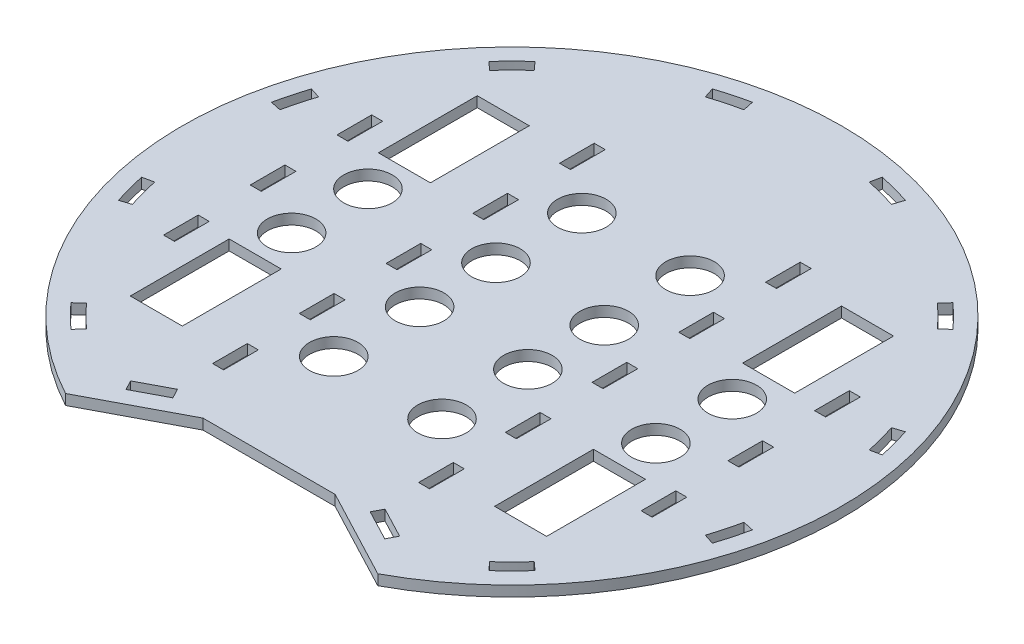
ISO-10303-21;
HEADER;
FILE_DESCRIPTION(('STEP AP214'),'2;1');
FILE_NAME('part.step','',(''),(''),'','','');
FILE_SCHEMA(('AUTOMOTIVE_DESIGN { 1 0 10303 214 1 1 1 1 }'));
ENDSEC;
DATA;
#1=APPLICATION_CONTEXT('core data for automotive mechanical design processes');
#2=APPLICATION_PROTOCOL_DEFINITION('international standard','automotive_design',2000,#1);
#3=PRODUCT_CONTEXT('',#1,'mechanical');
#4=PRODUCT('Part','Part','',(#3));
#5=PRODUCT_RELATED_PRODUCT_CATEGORY('part','',(#4));
#6=PRODUCT_DEFINITION_FORMATION('','',#4);
#7=PRODUCT_DEFINITION_CONTEXT('part definition',#1,'design');
#8=PRODUCT_DEFINITION('design','',#6,#7);
#9=PRODUCT_DEFINITION_SHAPE('','',#8);
#10=(LENGTH_UNIT() NAMED_UNIT(*) SI_UNIT(.MILLI.,.METRE.));
#11=(NAMED_UNIT(*) PLANE_ANGLE_UNIT() SI_UNIT($,.RADIAN.));
#12=(NAMED_UNIT(*) SI_UNIT($,.STERADIAN.) SOLID_ANGLE_UNIT());
#13=UNCERTAINTY_MEASURE_WITH_UNIT(LENGTH_MEASURE(1.E-05),#10,'distance_accuracy_value','');
#14=(GEOMETRIC_REPRESENTATION_CONTEXT(3) GLOBAL_UNCERTAINTY_ASSIGNED_CONTEXT((#13)) GLOBAL_UNIT_ASSIGNED_CONTEXT((#10,
#11,#12)) REPRESENTATION_CONTEXT('',''));
#15=CARTESIAN_POINT('',(0.,0.,0.));
#16=DIRECTION('',(0.,0.,1.));
#17=DIRECTION('',(1.,0.,0.));
#18=AXIS2_PLACEMENT_3D('',#15,#16,#17);
#19=CARTESIAN_POINT('',(0.,6.,0.));
#20=DIRECTION('',(-0.669130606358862,0.,-0.743144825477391));
#21=DIRECTION('',(-0.743144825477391,0.,0.669130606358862));
#22=AXIS2_PLACEMENT_3D('',#19,#20,#21);
#23=PLANE('',#22);
#24=DIRECTION('',(0.743144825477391,0.,-0.669130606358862));
#25=VECTOR('',#24,1.);
#26=CARTESIAN_POINT('',(0.,0.,0.));
#27=LINE('',#26,#25);
#28=CARTESIAN_POINT('',(129.047098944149,0.,-116.194529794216));
#29=VERTEX_POINT('',#28);
#30=CARTESIAN_POINT('',(133.766068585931,0.,-120.443509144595));
#31=VERTEX_POINT('',#30);
#32=EDGE_CURVE('E1448',#29,#31,#27,.T.);
#33=ORIENTED_EDGE('',*,*,#32,.F.);
#34=DIRECTION('',(0.,-1.,0.));
#35=VECTOR('',#34,1.);
#36=CARTESIAN_POINT('',(129.047098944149,6.,-116.194529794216));
#37=LINE('',#36,#35);
#38=CARTESIAN_POINT('',(129.047098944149,6.,-116.194529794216));
#39=VERTEX_POINT('',#38);
#40=EDGE_CURVE('E11',#39,#29,#37,.T.);
#41=ORIENTED_EDGE('',*,*,#40,.F.);
#42=DIRECTION('',(0.743144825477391,0.,-0.669130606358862));
#43=VECTOR('',#42,1.);
#44=CARTESIAN_POINT('',(0.,6.,0.));
#45=LINE('',#44,#43);
#46=CARTESIAN_POINT('',(133.766068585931,6.,-120.443509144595));
#47=VERTEX_POINT('',#46);
#48=EDGE_CURVE('E870',#39,#47,#45,.T.);
#49=ORIENTED_EDGE('',*,*,#48,.T.);
#50=DIRECTION('',(0.,-1.,0.));
#51=VECTOR('',#50,1.);
#52=CARTESIAN_POINT('',(133.766068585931,6.,-120.443509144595));
#53=LINE('',#52,#51);
#54=EDGE_CURVE('E65',#47,#31,#53,.T.);
#55=ORIENTED_EDGE('',*,*,#54,.T.);
#56=EDGE_LOOP('',(#33,#41,#49,#55));
#57=FACE_BOUND('',#56,.T.);
#58=ADVANCED_FACE('F45',(#57),#23,.T.);
#59=CARTESIAN_POINT('',(0.,6.,0.));
#60=DIRECTION('',(0.,-1.,0.));
#61=DIRECTION('',(0.,0.,-1.));
#62=AXIS2_PLACEMENT_3D('',#59,#60,#61);
#63=CYLINDRICAL_SURFACE('',#62,173.65);
#64=CARTESIAN_POINT('',(0.,0.,0.));
#65=DIRECTION('',(0.,1.,0.));
#66=DIRECTION('',(0.,0.,1.));
#67=AXIS2_PLACEMENT_3D('',#64,#65,#66);
#68=CIRCLE('',#67,173.65);
#69=CARTESIAN_POINT('',(116.194529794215,0.,-129.04709894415));
#70=VERTEX_POINT('',#69);
#71=EDGE_CURVE('E877',#29,#70,#68,.T.);
#72=ORIENTED_EDGE('',*,*,#71,.T.);
#73=DIRECTION('',(0.,-1.,0.));
#74=VECTOR('',#73,1.);
#75=CARTESIAN_POINT('',(116.194529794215,6.,-129.04709894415));
#76=LINE('',#75,#74);
#77=CARTESIAN_POINT('',(116.194529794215,6.,-129.04709894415));
#78=VERTEX_POINT('',#77);
#79=EDGE_CURVE('E56',#78,#70,#76,.T.);
#80=ORIENTED_EDGE('',*,*,#79,.F.);
#81=CARTESIAN_POINT('',(0.,6.,0.));
#82=DIRECTION('',(0.,1.,0.));
#83=DIRECTION('',(0.,0.,1.));
#84=AXIS2_PLACEMENT_3D('',#81,#82,#83);
#85=CIRCLE('',#84,173.65);
#86=EDGE_CURVE('E863',#39,#78,#85,.T.);
#87=ORIENTED_EDGE('',*,*,#86,.F.);
#88=ORIENTED_EDGE('',*,*,#40,.T.);
#89=EDGE_LOOP('',(#72,#80,#87,#88));
#90=FACE_BOUND('',#89,.T.);
#91=ADVANCED_FACE('F875',(#90),#63,.T.);
#92=CARTESIAN_POINT('',(-9.28188557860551E-13,6.,-8.35744731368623E-13));
#93=DIRECTION('',(0.743144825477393,0.,0.66913060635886));
#94=DIRECTION('',(0.66913060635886,0.,-0.743144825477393));
#95=AXIS2_PLACEMENT_3D('',#92,#93,#94);
#96=PLANE('',#95);
#97=DIRECTION('',(-0.66913060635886,0.,0.743144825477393));
#98=VECTOR('',#97,1.);
#99=CARTESIAN_POINT('',(-9.28188557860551E-13,0.,-8.35744731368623E-13));
#100=LINE('',#99,#98);
#101=CARTESIAN_POINT('',(120.443509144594,0.,-133.766068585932));
#102=VERTEX_POINT('',#101);
#103=EDGE_CURVE('E1453',#102,#70,#100,.T.);
#104=ORIENTED_EDGE('',*,*,#103,.F.);
#105=DIRECTION('',(0.,-1.,0.));
#106=VECTOR('',#105,1.);
#107=CARTESIAN_POINT('',(120.443509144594,6.,-133.766068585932));
#108=LINE('',#107,#106);
#109=CARTESIAN_POINT('',(120.443509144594,6.,-133.766068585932));
#110=VERTEX_POINT('',#109);
#111=EDGE_CURVE('E462',#110,#102,#108,.T.);
#112=ORIENTED_EDGE('',*,*,#111,.F.);
#113=DIRECTION('',(-0.66913060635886,0.,0.743144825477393));
#114=VECTOR('',#113,1.);
#115=CARTESIAN_POINT('',(-9.28188557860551E-13,6.,-8.35744731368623E-13));
#116=LINE('',#115,#114);
#117=EDGE_CURVE('E869',#110,#78,#116,.T.);
#118=ORIENTED_EDGE('',*,*,#117,.T.);
#119=ORIENTED_EDGE('',*,*,#79,.T.);
#120=EDGE_LOOP('',(#104,#112,#118,#119));
#121=FACE_BOUND('',#120,.T.);
#122=ADVANCED_FACE('F882',(#121),#96,.T.);
#123=CARTESIAN_POINT('',(0.,6.,2.17192397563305E-13));
#124=DIRECTION('',(-0.207911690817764,0.,-0.978147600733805));
#125=DIRECTION('',(-0.978147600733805,0.,0.207911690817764));
#126=AXIS2_PLACEMENT_3D('',#123,#124,#125);
#127=PLANE('',#126);
#128=DIRECTION('',(0.978147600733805,0.,-0.207911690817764));
#129=VECTOR('',#128,1.);
#130=CARTESIAN_POINT('',(0.,0.,2.17192397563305E-13));
#131=LINE('',#130,#129);
#132=CARTESIAN_POINT('',(169.855330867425,0.,-36.1038651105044));
#133=VERTEX_POINT('',#132);
#134=CARTESIAN_POINT('',(176.066568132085,0.,-37.4241043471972));
#135=VERTEX_POINT('',#134);
#136=EDGE_CURVE('E1432',#133,#135,#131,.T.);
#137=ORIENTED_EDGE('',*,*,#136,.F.);
#138=DIRECTION('',(0.,-1.,0.));
#139=VECTOR('',#138,1.);
#140=CARTESIAN_POINT('',(169.855330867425,6.,-36.1038651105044));
#141=LINE('',#140,#139);
#142=CARTESIAN_POINT('',(169.855330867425,6.,-36.1038651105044));
#143=VERTEX_POINT('',#142);
#144=EDGE_CURVE('E1471',#143,#133,#141,.T.);
#145=ORIENTED_EDGE('',*,*,#144,.F.);
#146=DIRECTION('',(0.978147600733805,0.,-0.207911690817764));
#147=VECTOR('',#146,1.);
#148=CARTESIAN_POINT('',(0.,6.,2.17192397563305E-13));
#149=LINE('',#148,#147);
#150=CARTESIAN_POINT('',(176.066568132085,6.,-37.4241043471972));
#151=VERTEX_POINT('',#150);
#152=EDGE_CURVE('E2382',#143,#151,#149,.T.);
#153=ORIENTED_EDGE('',*,*,#152,.T.);
#154=DIRECTION('',(0.,-1.,0.));
#155=VECTOR('',#154,1.);
#156=CARTESIAN_POINT('',(176.066568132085,6.,-37.4241043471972));
#157=LINE('',#156,#155);
#158=EDGE_CURVE('E1474',#151,#135,#157,.T.);
#159=ORIENTED_EDGE('',*,*,#158,.T.);
#160=EDGE_LOOP('',(#137,#145,#153,#159));
#161=FACE_BOUND('',#160,.T.);
#162=ADVANCED_FACE('F2427',(#161),#127,.T.);
#163=CARTESIAN_POINT('',(0.,6.,0.));
#164=DIRECTION('',(0.,-1.,0.));
#165=DIRECTION('',(0.,0.,-1.));
#166=AXIS2_PLACEMENT_3D('',#163,#164,#165);
#167=CYLINDRICAL_SURFACE('',#166,173.65);
#168=CARTESIAN_POINT('',(0.,0.,0.));
#169=DIRECTION('',(0.,1.,0.));
#170=DIRECTION('',(0.,0.,1.));
#171=AXIS2_PLACEMENT_3D('',#168,#169,#170);
#172=CIRCLE('',#171,173.65);
#173=CARTESIAN_POINT('',(165.150964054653,0.,-53.6608010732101));
#174=VERTEX_POINT('',#173);
#175=EDGE_CURVE('E1436',#133,#174,#172,.T.);
#176=ORIENTED_EDGE('',*,*,#175,.T.);
#177=DIRECTION('',(0.,-1.,0.));
#178=VECTOR('',#177,1.);
#179=CARTESIAN_POINT('',(165.150964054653,6.,-53.6608010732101));
#180=LINE('',#179,#178);
#181=CARTESIAN_POINT('',(165.150964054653,6.,-53.6608010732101));
#182=VERTEX_POINT('',#181);
#183=EDGE_CURVE('E1481',#182,#174,#180,.T.);
#184=ORIENTED_EDGE('',*,*,#183,.F.);
#185=CARTESIAN_POINT('',(0.,6.,0.));
#186=DIRECTION('',(0.,1.,0.));
#187=DIRECTION('',(0.,0.,1.));
#188=AXIS2_PLACEMENT_3D('',#185,#186,#187);
#189=CIRCLE('',#188,173.65);
#190=EDGE_CURVE('E2386',#143,#182,#189,.T.);
#191=ORIENTED_EDGE('',*,*,#190,.F.);
#192=ORIENTED_EDGE('',*,*,#144,.T.);
#193=EDGE_LOOP('',(#176,#184,#191,#192));
#194=FACE_BOUND('',#193,.T.);
#195=ADVANCED_FACE('F2423',(#194),#167,.T.);
#196=CARTESIAN_POINT('',(2.74891072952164E-12,6.,8.46027729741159E-12));
#197=DIRECTION('',(0.309016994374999,0.,0.951056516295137));
#198=DIRECTION('',(0.951056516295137,0.,-0.309016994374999));
#199=AXIS2_PLACEMENT_3D('',#196,#197,#198);
#200=PLANE('',#199);
#201=DIRECTION('',(-0.951056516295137,0.,0.309016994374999));
#202=VECTOR('',#201,1.);
#203=CARTESIAN_POINT('',(2.74891072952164E-12,0.,8.46027729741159E-12));
#204=LINE('',#203,#202);
#205=CARTESIAN_POINT('',(171.190172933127,0.,-55.6230589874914));
#206=VERTEX_POINT('',#205);
#207=EDGE_CURVE('E1440',#206,#174,#204,.T.);
#208=ORIENTED_EDGE('',*,*,#207,.F.);
#209=DIRECTION('',(0.,-1.,0.));
#210=VECTOR('',#209,1.);
#211=CARTESIAN_POINT('',(171.190172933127,6.,-55.6230589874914));
#212=LINE('',#211,#210);
#213=CARTESIAN_POINT('',(171.190172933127,6.,-55.6230589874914));
#214=VERTEX_POINT('',#213);
#215=EDGE_CURVE('E1477',#214,#206,#212,.T.);
#216=ORIENTED_EDGE('',*,*,#215,.F.);
#217=DIRECTION('',(-0.951056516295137,0.,0.309016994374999));
#218=VECTOR('',#217,1.);
#219=CARTESIAN_POINT('',(2.74891072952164E-12,6.,8.46027729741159E-12));
#220=LINE('',#219,#218);
#221=EDGE_CURVE('E2389',#214,#182,#220,.T.);
#222=ORIENTED_EDGE('',*,*,#221,.T.);
#223=ORIENTED_EDGE('',*,*,#183,.T.);
#224=EDGE_LOOP('',(#208,#216,#222,#223));
#225=FACE_BOUND('',#224,.T.);
#226=ADVANCED_FACE('F2419',(#225),#200,.T.);
#227=CARTESIAN_POINT('',(-3.50649010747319E-13,6.,3.15725787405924E-13));
#228=DIRECTION('',(0.743144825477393,0.,-0.66913060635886));
#229=DIRECTION('',(-0.66913060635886,0.,-0.743144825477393));
#230=AXIS2_PLACEMENT_3D('',#227,#228,#229);
#231=PLANE('',#230);
#232=DIRECTION('',(0.66913060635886,0.,0.743144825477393));
#233=VECTOR('',#232,1.);
#234=CARTESIAN_POINT('',(-3.50649010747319E-13,0.,3.15725787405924E-13));
#235=LINE('',#234,#233);
#236=CARTESIAN_POINT('',(116.194529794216,0.,129.04709894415));
#237=VERTEX_POINT('',#236);
#238=CARTESIAN_POINT('',(120.443509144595,0.,133.766068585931));
#239=VERTEX_POINT('',#238);
#240=EDGE_CURVE('E1416',#237,#239,#235,.T.);
#241=ORIENTED_EDGE('',*,*,#240,.F.);
#242=DIRECTION('',(0.,-1.,0.));
#243=VECTOR('',#242,1.);
#244=CARTESIAN_POINT('',(116.194529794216,6.,129.04709894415));
#245=LINE('',#244,#243);
#246=CARTESIAN_POINT('',(116.194529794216,6.,129.04709894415));
#247=VERTEX_POINT('',#246);
#248=EDGE_CURVE('E1478',#247,#237,#245,.T.);
#249=ORIENTED_EDGE('',*,*,#248,.F.);
#250=DIRECTION('',(0.66913060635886,0.,0.743144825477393));
#251=VECTOR('',#250,1.);
#252=CARTESIAN_POINT('',(-3.50649010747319E-13,6.,3.15725787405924E-13));
#253=LINE('',#252,#251);
#254=CARTESIAN_POINT('',(120.443509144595,6.,133.766068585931));
#255=VERTEX_POINT('',#254);
#256=EDGE_CURVE('E2367',#247,#255,#253,.T.);
#257=ORIENTED_EDGE('',*,*,#256,.T.);
#258=DIRECTION('',(0.,-1.,0.));
#259=VECTOR('',#258,1.);
#260=CARTESIAN_POINT('',(120.443509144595,6.,133.766068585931));
#261=LINE('',#260,#259);
#262=EDGE_CURVE('E1486',#255,#239,#261,.T.);
#263=ORIENTED_EDGE('',*,*,#262,.T.);
#264=EDGE_LOOP('',(#241,#249,#257,#263));
#265=FACE_BOUND('',#264,.T.);
#266=ADVANCED_FACE('F2422',(#265),#231,.T.);
#267=CARTESIAN_POINT('',(0.,6.,0.));
#268=DIRECTION('',(0.,-1.,0.));
#269=DIRECTION('',(0.,0.,-1.));
#270=AXIS2_PLACEMENT_3D('',#267,#268,#269);
#271=CYLINDRICAL_SURFACE('',#270,173.65);
#272=CARTESIAN_POINT('',(0.,0.,0.));
#273=DIRECTION('',(0.,1.,0.));
#274=DIRECTION('',(0.,0.,1.));
#275=AXIS2_PLACEMENT_3D('',#272,#273,#274);
#276=CIRCLE('',#275,173.65);
#277=CARTESIAN_POINT('',(129.047098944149,0.,116.194529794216));
#278=VERTEX_POINT('',#277);
#279=EDGE_CURVE('E1420',#237,#278,#276,.T.);
#280=ORIENTED_EDGE('',*,*,#279,.T.);
#281=DIRECTION('',(0.,-1.,0.));
#282=VECTOR('',#281,1.);
#283=CARTESIAN_POINT('',(129.047098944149,6.,116.194529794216));
#284=LINE('',#283,#282);
#285=CARTESIAN_POINT('',(129.047098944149,6.,116.194529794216));
#286=VERTEX_POINT('',#285);
#287=EDGE_CURVE('E1493',#286,#278,#284,.T.);
#288=ORIENTED_EDGE('',*,*,#287,.F.);
#289=CARTESIAN_POINT('',(0.,6.,0.));
#290=DIRECTION('',(0.,1.,0.));
#291=DIRECTION('',(0.,0.,1.));
#292=AXIS2_PLACEMENT_3D('',#289,#290,#291);
#293=CIRCLE('',#292,173.65);
#294=EDGE_CURVE('E2371',#247,#286,#293,.T.);
#295=ORIENTED_EDGE('',*,*,#294,.F.);
#296=ORIENTED_EDGE('',*,*,#248,.T.);
#297=EDGE_LOOP('',(#280,#288,#295,#296));
#298=FACE_BOUND('',#297,.T.);
#299=ADVANCED_FACE('F2440',(#298),#271,.T.);
#300=CARTESIAN_POINT('',(-5.55305943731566E-12,6.,6.16729730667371E-12));
#301=DIRECTION('',(-0.669130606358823,0.,0.743144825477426));
#302=DIRECTION('',(0.743144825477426,0.,0.669130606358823));
#303=AXIS2_PLACEMENT_3D('',#300,#301,#302);
#304=PLANE('',#303);
#305=DIRECTION('',(-0.743144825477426,0.,-0.669130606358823));
#306=VECTOR('',#305,1.);
#307=CARTESIAN_POINT('',(-5.55305943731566E-12,0.,6.16729730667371E-12));
#308=LINE('',#307,#306);
#309=CARTESIAN_POINT('',(133.766068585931,0.,120.443509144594));
#310=VERTEX_POINT('',#309);
#311=EDGE_CURVE('E1424',#310,#278,#308,.T.);
#312=ORIENTED_EDGE('',*,*,#311,.F.);
#313=DIRECTION('',(0.,-1.,0.));
#314=VECTOR('',#313,1.);
#315=CARTESIAN_POINT('',(133.766068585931,6.,120.443509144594));
#316=LINE('',#315,#314);
#317=CARTESIAN_POINT('',(133.766068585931,6.,120.443509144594));
#318=VERTEX_POINT('',#317);
#319=EDGE_CURVE('E1489',#318,#310,#316,.T.);
#320=ORIENTED_EDGE('',*,*,#319,.F.);
#321=DIRECTION('',(-0.743144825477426,0.,-0.669130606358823));
#322=VECTOR('',#321,1.);
#323=CARTESIAN_POINT('',(-5.55305943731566E-12,6.,6.16729730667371E-12));
#324=LINE('',#323,#322);
#325=EDGE_CURVE('E2374',#318,#286,#324,.T.);
#326=ORIENTED_EDGE('',*,*,#325,.T.);
#327=ORIENTED_EDGE('',*,*,#287,.T.);
#328=EDGE_LOOP('',(#312,#320,#326,#327));
#329=FACE_BOUND('',#328,.T.);
#330=ADVANCED_FACE('F2436',(#329),#304,.T.);
#331=CARTESIAN_POINT('',(62.5533280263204,6.,0.));
#332=DIRECTION('',(-1.,0.,0.));
#333=DIRECTION('',(0.,0.,1.));
#334=AXIS2_PLACEMENT_3D('',#331,#332,#333);
#335=PLANE('',#334);
#336=DIRECTION('',(0.,0.,-1.));
#337=VECTOR('',#336,1.);
#338=CARTESIAN_POINT('',(62.5533280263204,0.,0.));
#339=LINE('',#338,#337);
#340=CARTESIAN_POINT('',(62.5533280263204,0.,-40.));
#341=VERTEX_POINT('',#340);
#342=CARTESIAN_POINT('',(62.5533280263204,0.,-60.));
#343=VERTEX_POINT('',#342);
#344=EDGE_CURVE('E1400',#341,#343,#339,.T.);
#345=ORIENTED_EDGE('',*,*,#344,.F.);
#346=DIRECTION('',(0.,-1.,0.));
#347=VECTOR('',#346,1.);
#348=CARTESIAN_POINT('',(62.5533280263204,6.,-40.));
#349=LINE('',#348,#347);
#350=CARTESIAN_POINT('',(62.5533280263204,6.,-40.));
#351=VERTEX_POINT('',#350);
#352=EDGE_CURVE('E1490',#351,#341,#349,.T.);
#353=ORIENTED_EDGE('',*,*,#352,.F.);
#354=DIRECTION('',(0.,0.,-1.));
#355=VECTOR('',#354,1.);
#356=CARTESIAN_POINT('',(62.5533280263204,6.,0.));
#357=LINE('',#356,#355);
#358=CARTESIAN_POINT('',(62.5533280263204,6.,-60.));
#359=VERTEX_POINT('',#358);
#360=EDGE_CURVE('E2352',#351,#359,#357,.T.);
#361=ORIENTED_EDGE('',*,*,#360,.T.);
#362=DIRECTION('',(0.,-1.,0.));
#363=VECTOR('',#362,1.);
#364=CARTESIAN_POINT('',(62.5533280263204,6.,-60.));
#365=LINE('',#364,#363);
#366=EDGE_CURVE('E1498',#359,#343,#365,.T.);
#367=ORIENTED_EDGE('',*,*,#366,.T.);
#368=EDGE_LOOP('',(#345,#353,#361,#367));
#369=FACE_BOUND('',#368,.T.);
#370=ADVANCED_FACE('F2439',(#369),#335,.T.);
#371=CARTESIAN_POINT('',(0.,6.,-40.));
#372=DIRECTION('',(0.,0.,1.));
#373=DIRECTION('',(1.,0.,0.));
#374=AXIS2_PLACEMENT_3D('',#371,#372,#373);
#375=PLANE('',#374);
#376=DIRECTION('',(-1.,0.,0.));
#377=VECTOR('',#376,1.);
#378=CARTESIAN_POINT('',(0.,0.,-40.));
#379=LINE('',#378,#377);
#380=CARTESIAN_POINT('',(56.2033280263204,0.,-40.));
#381=VERTEX_POINT('',#380);
#382=EDGE_CURVE('E1404',#341,#381,#379,.T.);
#383=ORIENTED_EDGE('',*,*,#382,.T.);
#384=DIRECTION('',(0.,-1.,0.));
#385=VECTOR('',#384,1.);
#386=CARTESIAN_POINT('',(56.2033280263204,6.,-40.));
#387=LINE('',#386,#385);
#388=CARTESIAN_POINT('',(56.2033280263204,6.,-40.));
#389=VERTEX_POINT('',#388);
#390=EDGE_CURVE('E1505',#389,#381,#387,.T.);
#391=ORIENTED_EDGE('',*,*,#390,.F.);
#392=DIRECTION('',(-1.,0.,0.));
#393=VECTOR('',#392,1.);
#394=CARTESIAN_POINT('',(0.,6.,-40.));
#395=LINE('',#394,#393);
#396=EDGE_CURVE('E2356',#351,#389,#395,.T.);
#397=ORIENTED_EDGE('',*,*,#396,.F.);
#398=ORIENTED_EDGE('',*,*,#352,.T.);
#399=EDGE_LOOP('',(#383,#391,#397,#398));
#400=FACE_BOUND('',#399,.T.);
#401=ADVANCED_FACE('F2456',(#400),#375,.F.);
#402=CARTESIAN_POINT('',(56.2033280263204,6.,0.));
#403=DIRECTION('',(-1.,0.,0.));
#404=DIRECTION('',(0.,0.,1.));
#405=AXIS2_PLACEMENT_3D('',#402,#403,#404);
#406=PLANE('',#405);
#407=DIRECTION('',(0.,0.,-1.));
#408=VECTOR('',#407,1.);
#409=CARTESIAN_POINT('',(56.2033280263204,0.,0.));
#410=LINE('',#409,#408);
#411=CARTESIAN_POINT('',(56.2033280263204,0.,-60.));
#412=VERTEX_POINT('',#411);
#413=EDGE_CURVE('E1408',#381,#412,#410,.T.);
#414=ORIENTED_EDGE('',*,*,#413,.T.);
#415=DIRECTION('',(0.,-1.,0.));
#416=VECTOR('',#415,1.);
#417=CARTESIAN_POINT('',(56.2033280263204,6.,-60.));
#418=LINE('',#417,#416);
#419=CARTESIAN_POINT('',(56.2033280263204,6.,-60.));
#420=VERTEX_POINT('',#419);
#421=EDGE_CURVE('E1501',#420,#412,#418,.T.);
#422=ORIENTED_EDGE('',*,*,#421,.F.);
#423=DIRECTION('',(0.,0.,-1.));
#424=VECTOR('',#423,1.);
#425=CARTESIAN_POINT('',(56.2033280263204,6.,0.));
#426=LINE('',#425,#424);
#427=EDGE_CURVE('E2360',#389,#420,#426,.T.);
#428=ORIENTED_EDGE('',*,*,#427,.F.);
#429=ORIENTED_EDGE('',*,*,#390,.T.);
#430=EDGE_LOOP('',(#414,#422,#428,#429));
#431=FACE_BOUND('',#430,.T.);
#432=ADVANCED_FACE('F2452',(#431),#406,.F.);
#433=CARTESIAN_POINT('',(56.2033280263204,6.,0.));
#434=DIRECTION('',(1.,0.,0.));
#435=DIRECTION('',(0.,0.,-1.));
#436=AXIS2_PLACEMENT_3D('',#433,#434,#435);
#437=PLANE('',#436);
#438=DIRECTION('',(0.,0.,1.));
#439=VECTOR('',#438,1.);
#440=CARTESIAN_POINT('',(56.2033280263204,0.,0.));
#441=LINE('',#440,#439);
#442=CARTESIAN_POINT('',(56.2033280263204,0.,-10.));
#443=VERTEX_POINT('',#442);
#444=CARTESIAN_POINT('',(56.2033280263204,0.,10.));
#445=VERTEX_POINT('',#444);
#446=EDGE_CURVE('E1384',#443,#445,#441,.T.);
#447=ORIENTED_EDGE('',*,*,#446,.F.);
#448=DIRECTION('',(0.,-1.,0.));
#449=VECTOR('',#448,1.);
#450=CARTESIAN_POINT('',(56.2033280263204,6.,-10.));
#451=LINE('',#450,#449);
#452=CARTESIAN_POINT('',(56.2033280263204,6.,-10.));
#453=VERTEX_POINT('',#452);
#454=EDGE_CURVE('E1502',#453,#443,#451,.T.);
#455=ORIENTED_EDGE('',*,*,#454,.F.);
#456=DIRECTION('',(0.,0.,1.));
#457=VECTOR('',#456,1.);
#458=CARTESIAN_POINT('',(56.2033280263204,6.,0.));
#459=LINE('',#458,#457);
#460=CARTESIAN_POINT('',(56.2033280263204,6.,10.));
#461=VERTEX_POINT('',#460);
#462=EDGE_CURVE('E2337',#453,#461,#459,.T.);
#463=ORIENTED_EDGE('',*,*,#462,.T.);
#464=DIRECTION('',(0.,-1.,0.));
#465=VECTOR('',#464,1.);
#466=CARTESIAN_POINT('',(56.2033280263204,6.,10.));
#467=LINE('',#466,#465);
#468=EDGE_CURVE('E1511',#461,#445,#467,.T.);
#469=ORIENTED_EDGE('',*,*,#468,.T.);
#470=EDGE_LOOP('',(#447,#455,#463,#469));
#471=FACE_BOUND('',#470,.T.);
#472=ADVANCED_FACE('F2455',(#471),#437,.T.);
#473=CARTESIAN_POINT('',(0.,6.,-9.99999999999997));
#474=DIRECTION('',(0.,0.,-1.));
#475=DIRECTION('',(-1.,0.,0.));
#476=AXIS2_PLACEMENT_3D('',#473,#474,#475);
#477=PLANE('',#476);
#478=DIRECTION('',(1.,0.,0.));
#479=VECTOR('',#478,1.);
#480=CARTESIAN_POINT('',(0.,0.,-9.99999999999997));
#481=LINE('',#480,#479);
#482=CARTESIAN_POINT('',(62.5533280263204,0.,-10.));
#483=VERTEX_POINT('',#482);
#484=EDGE_CURVE('E1388',#443,#483,#481,.T.);
#485=ORIENTED_EDGE('',*,*,#484,.T.);
#486=DIRECTION('',(0.,-1.,0.));
#487=VECTOR('',#486,1.);
#488=CARTESIAN_POINT('',(62.5533280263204,6.,-10.));
#489=LINE('',#488,#487);
#490=CARTESIAN_POINT('',(62.5533280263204,6.,-10.));
#491=VERTEX_POINT('',#490);
#492=EDGE_CURVE('E1518',#491,#483,#489,.T.);
#493=ORIENTED_EDGE('',*,*,#492,.F.);
#494=DIRECTION('',(1.,0.,0.));
#495=VECTOR('',#494,1.);
#496=CARTESIAN_POINT('',(0.,6.,-9.99999999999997));
#497=LINE('',#496,#495);
#498=EDGE_CURVE('E2341',#453,#491,#497,.T.);
#499=ORIENTED_EDGE('',*,*,#498,.F.);
#500=ORIENTED_EDGE('',*,*,#454,.T.);
#501=EDGE_LOOP('',(#485,#493,#499,#500));
#502=FACE_BOUND('',#501,.T.);
#503=ADVANCED_FACE('F2472',(#502),#477,.F.);
#504=CARTESIAN_POINT('',(62.5533280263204,6.,0.));
#505=DIRECTION('',(1.,0.,0.));
#506=DIRECTION('',(0.,0.,-1.));
#507=AXIS2_PLACEMENT_3D('',#504,#505,#506);
#508=PLANE('',#507);
#509=DIRECTION('',(0.,0.,1.));
#510=VECTOR('',#509,1.);
#511=CARTESIAN_POINT('',(62.5533280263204,0.,0.));
#512=LINE('',#511,#510);
#513=CARTESIAN_POINT('',(62.5533280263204,0.,9.99999999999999));
#514=VERTEX_POINT('',#513);
#515=EDGE_CURVE('E1392',#483,#514,#512,.T.);
#516=ORIENTED_EDGE('',*,*,#515,.T.);
#517=DIRECTION('',(0.,-1.,0.));
#518=VECTOR('',#517,1.);
#519=CARTESIAN_POINT('',(62.5533280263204,6.,9.99999999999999));
#520=LINE('',#519,#518);
#521=CARTESIAN_POINT('',(62.5533280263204,6.,9.99999999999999));
#522=VERTEX_POINT('',#521);
#523=EDGE_CURVE('E1514',#522,#514,#520,.T.);
#524=ORIENTED_EDGE('',*,*,#523,.F.);
#525=DIRECTION('',(0.,0.,1.));
#526=VECTOR('',#525,1.);
#527=CARTESIAN_POINT('',(62.5533280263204,6.,0.));
#528=LINE('',#527,#526);
#529=EDGE_CURVE('E2345',#491,#522,#528,.T.);
#530=ORIENTED_EDGE('',*,*,#529,.F.);
#531=ORIENTED_EDGE('',*,*,#492,.T.);
#532=EDGE_LOOP('',(#516,#524,#530,#531));
#533=FACE_BOUND('',#532,.T.);
#534=ADVANCED_FACE('F2468',(#533),#508,.F.);
#535=CARTESIAN_POINT('',(62.5533280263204,6.,0.));
#536=DIRECTION('',(-1.,0.,0.));
#537=DIRECTION('',(0.,0.,1.));
#538=AXIS2_PLACEMENT_3D('',#535,#536,#537);
#539=PLANE('',#538);
#540=DIRECTION('',(0.,0.,-1.));
#541=VECTOR('',#540,1.);
#542=CARTESIAN_POINT('',(62.5533280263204,0.,0.));
#543=LINE('',#542,#541);
#544=CARTESIAN_POINT('',(62.5533280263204,0.,-90.));
#545=VERTEX_POINT('',#544);
#546=CARTESIAN_POINT('',(62.5533280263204,0.,-110.));
#547=VERTEX_POINT('',#546);
#548=EDGE_CURVE('E1368',#545,#547,#543,.T.);
#549=ORIENTED_EDGE('',*,*,#548,.F.);
#550=DIRECTION('',(0.,-1.,0.));
#551=VECTOR('',#550,1.);
#552=CARTESIAN_POINT('',(62.5533280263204,6.,-90.));
#553=LINE('',#552,#551);
#554=CARTESIAN_POINT('',(62.5533280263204,6.,-90.));
#555=VERTEX_POINT('',#554);
#556=EDGE_CURVE('E1515',#555,#545,#553,.T.);
#557=ORIENTED_EDGE('',*,*,#556,.F.);
#558=DIRECTION('',(0.,0.,-1.));
#559=VECTOR('',#558,1.);
#560=CARTESIAN_POINT('',(62.5533280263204,6.,0.));
#561=LINE('',#560,#559);
#562=CARTESIAN_POINT('',(62.5533280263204,6.,-110.));
#563=VERTEX_POINT('',#562);
#564=EDGE_CURVE('E2322',#555,#563,#561,.T.);
#565=ORIENTED_EDGE('',*,*,#564,.T.);
#566=DIRECTION('',(0.,-1.,0.));
#567=VECTOR('',#566,1.);
#568=CARTESIAN_POINT('',(62.5533280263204,6.,-110.));
#569=LINE('',#568,#567);
#570=EDGE_CURVE('E1524',#563,#547,#569,.T.);
#571=ORIENTED_EDGE('',*,*,#570,.T.);
#572=EDGE_LOOP('',(#549,#557,#565,#571));
#573=FACE_BOUND('',#572,.T.);
#574=ADVANCED_FACE('F2471',(#573),#539,.T.);
#575=CARTESIAN_POINT('',(0.,6.,-90.));
#576=DIRECTION('',(0.,0.,1.));
#577=DIRECTION('',(1.,0.,0.));
#578=AXIS2_PLACEMENT_3D('',#575,#576,#577);
#579=PLANE('',#578);
#580=DIRECTION('',(-1.,0.,0.));
#581=VECTOR('',#580,1.);
#582=CARTESIAN_POINT('',(0.,0.,-90.));
#583=LINE('',#582,#581);
#584=CARTESIAN_POINT('',(56.2033280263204,0.,-90.));
#585=VERTEX_POINT('',#584);
#586=EDGE_CURVE('E1372',#545,#585,#583,.T.);
#587=ORIENTED_EDGE('',*,*,#586,.T.);
#588=DIRECTION('',(0.,-1.,0.));
#589=VECTOR('',#588,1.);
#590=CARTESIAN_POINT('',(56.2033280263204,6.,-90.));
#591=LINE('',#590,#589);
#592=CARTESIAN_POINT('',(56.2033280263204,6.,-90.));
#593=VERTEX_POINT('',#592);
#594=EDGE_CURVE('E1531',#593,#585,#591,.T.);
#595=ORIENTED_EDGE('',*,*,#594,.F.);
#596=DIRECTION('',(-1.,0.,0.));
#597=VECTOR('',#596,1.);
#598=CARTESIAN_POINT('',(0.,6.,-90.));
#599=LINE('',#598,#597);
#600=EDGE_CURVE('E2326',#555,#593,#599,.T.);
#601=ORIENTED_EDGE('',*,*,#600,.F.);
#602=ORIENTED_EDGE('',*,*,#556,.T.);
#603=EDGE_LOOP('',(#587,#595,#601,#602));
#604=FACE_BOUND('',#603,.T.);
#605=ADVANCED_FACE('F2488',(#604),#579,.F.);
#606=CARTESIAN_POINT('',(56.2033280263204,6.,0.));
#607=DIRECTION('',(-1.,0.,0.));
#608=DIRECTION('',(0.,0.,1.));
#609=AXIS2_PLACEMENT_3D('',#606,#607,#608);
#610=PLANE('',#609);
#611=DIRECTION('',(0.,0.,-1.));
#612=VECTOR('',#611,1.);
#613=CARTESIAN_POINT('',(56.2033280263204,0.,0.));
#614=LINE('',#613,#612);
#615=CARTESIAN_POINT('',(56.2033280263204,0.,-110.));
#616=VERTEX_POINT('',#615);
#617=EDGE_CURVE('E1376',#585,#616,#614,.T.);
#618=ORIENTED_EDGE('',*,*,#617,.T.);
#619=DIRECTION('',(0.,-1.,0.));
#620=VECTOR('',#619,1.);
#621=CARTESIAN_POINT('',(56.2033280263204,6.,-110.));
#622=LINE('',#621,#620);
#623=CARTESIAN_POINT('',(56.2033280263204,6.,-110.));
#624=VERTEX_POINT('',#623);
#625=EDGE_CURVE('E1527',#624,#616,#622,.T.);
#626=ORIENTED_EDGE('',*,*,#625,.F.);
#627=DIRECTION('',(0.,0.,-1.));
#628=VECTOR('',#627,1.);
#629=CARTESIAN_POINT('',(56.2033280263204,6.,0.));
#630=LINE('',#629,#628);
#631=EDGE_CURVE('E2330',#593,#624,#630,.T.);
#632=ORIENTED_EDGE('',*,*,#631,.F.);
#633=ORIENTED_EDGE('',*,*,#594,.T.);
#634=EDGE_LOOP('',(#618,#626,#632,#633));
#635=FACE_BOUND('',#634,.T.);
#636=ADVANCED_FACE('F2484',(#635),#610,.F.);
#637=CARTESIAN_POINT('',(0.,6.,90.));
#638=DIRECTION('',(0.,0.,1.));
#639=DIRECTION('',(1.,0.,0.));
#640=AXIS2_PLACEMENT_3D('',#637,#638,#639);
#641=PLANE('',#640);
#642=DIRECTION('',(-1.,0.,0.));
#643=VECTOR('',#642,1.);
#644=CARTESIAN_POINT('',(0.,0.,90.));
#645=LINE('',#644,#643);
#646=CARTESIAN_POINT('',(62.5533280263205,0.,90.));
#647=VERTEX_POINT('',#646);
#648=CARTESIAN_POINT('',(56.2033280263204,0.,90.));
#649=VERTEX_POINT('',#648);
#650=EDGE_CURVE('E1352',#647,#649,#645,.T.);
#651=ORIENTED_EDGE('',*,*,#650,.F.);
#652=DIRECTION('',(0.,-1.,0.));
#653=VECTOR('',#652,1.);
#654=CARTESIAN_POINT('',(62.5533280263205,6.,90.));
#655=LINE('',#654,#653);
#656=CARTESIAN_POINT('',(62.5533280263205,6.,90.));
#657=VERTEX_POINT('',#656);
#658=EDGE_CURVE('E1528',#657,#647,#655,.T.);
#659=ORIENTED_EDGE('',*,*,#658,.F.);
#660=DIRECTION('',(-1.,0.,0.));
#661=VECTOR('',#660,1.);
#662=CARTESIAN_POINT('',(0.,6.,90.));
#663=LINE('',#662,#661);
#664=CARTESIAN_POINT('',(56.2033280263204,6.,90.));
#665=VERTEX_POINT('',#664);
#666=EDGE_CURVE('E2307',#657,#665,#663,.T.);
#667=ORIENTED_EDGE('',*,*,#666,.T.);
#668=DIRECTION('',(0.,-1.,0.));
#669=VECTOR('',#668,1.);
#670=CARTESIAN_POINT('',(56.2033280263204,6.,90.));
#671=LINE('',#670,#669);
#672=EDGE_CURVE('E1537',#665,#649,#671,.T.);
#673=ORIENTED_EDGE('',*,*,#672,.T.);
#674=EDGE_LOOP('',(#651,#659,#667,#673));
#675=FACE_BOUND('',#674,.T.);
#676=ADVANCED_FACE('F2487',(#675),#641,.T.);
#677=CARTESIAN_POINT('',(62.5533280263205,6.,0.));
#678=DIRECTION('',(1.,0.,0.));
#679=DIRECTION('',(0.,0.,-1.));
#680=AXIS2_PLACEMENT_3D('',#677,#678,#679);
#681=PLANE('',#680);
#682=DIRECTION('',(0.,0.,1.));
#683=VECTOR('',#682,1.);
#684=CARTESIAN_POINT('',(62.5533280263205,0.,0.));
#685=LINE('',#684,#683);
#686=CARTESIAN_POINT('',(62.5533280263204,0.,110.));
#687=VERTEX_POINT('',#686);
#688=EDGE_CURVE('E1356',#647,#687,#685,.T.);
#689=ORIENTED_EDGE('',*,*,#688,.T.);
#690=DIRECTION('',(0.,-1.,0.));
#691=VECTOR('',#690,1.);
#692=CARTESIAN_POINT('',(62.5533280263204,6.,110.));
#693=LINE('',#692,#691);
#694=CARTESIAN_POINT('',(62.5533280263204,6.,110.));
#695=VERTEX_POINT('',#694);
#696=EDGE_CURVE('E1544',#695,#687,#693,.T.);
#697=ORIENTED_EDGE('',*,*,#696,.F.);
#698=DIRECTION('',(0.,0.,1.));
#699=VECTOR('',#698,1.);
#700=CARTESIAN_POINT('',(62.5533280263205,6.,0.));
#701=LINE('',#700,#699);
#702=EDGE_CURVE('E2311',#657,#695,#701,.T.);
#703=ORIENTED_EDGE('',*,*,#702,.F.);
#704=ORIENTED_EDGE('',*,*,#658,.T.);
#705=EDGE_LOOP('',(#689,#697,#703,#704));
#706=FACE_BOUND('',#705,.T.);
#707=ADVANCED_FACE('F2504',(#706),#681,.F.);
#708=CARTESIAN_POINT('',(0.,6.,110.));
#709=DIRECTION('',(0.,0.,1.));
#710=DIRECTION('',(1.,0.,0.));
#711=AXIS2_PLACEMENT_3D('',#708,#709,#710);
#712=PLANE('',#711);
#713=DIRECTION('',(-1.,0.,0.));
#714=VECTOR('',#713,1.);
#715=CARTESIAN_POINT('',(0.,0.,110.));
#716=LINE('',#715,#714);
#717=CARTESIAN_POINT('',(56.2033280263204,0.,110.));
#718=VERTEX_POINT('',#717);
#719=EDGE_CURVE('E1360',#687,#718,#716,.T.);
#720=ORIENTED_EDGE('',*,*,#719,.T.);
#721=DIRECTION('',(0.,-1.,0.));
#722=VECTOR('',#721,1.);
#723=CARTESIAN_POINT('',(56.2033280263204,6.,110.));
#724=LINE('',#723,#722);
#725=CARTESIAN_POINT('',(56.2033280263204,6.,110.));
#726=VERTEX_POINT('',#725);
#727=EDGE_CURVE('E1540',#726,#718,#724,.T.);
#728=ORIENTED_EDGE('',*,*,#727,.F.);
#729=DIRECTION('',(-1.,0.,0.));
#730=VECTOR('',#729,1.);
#731=CARTESIAN_POINT('',(0.,6.,110.));
#732=LINE('',#731,#730);
#733=EDGE_CURVE('E2315',#695,#726,#732,.T.);
#734=ORIENTED_EDGE('',*,*,#733,.F.);
#735=ORIENTED_EDGE('',*,*,#696,.T.);
#736=EDGE_LOOP('',(#720,#728,#734,#735));
#737=FACE_BOUND('',#736,.T.);
#738=ADVANCED_FACE('F2500',(#737),#712,.F.);
#739=CARTESIAN_POINT('',(0.,6.,90.));
#740=DIRECTION('',(0.,0.,-1.));
#741=DIRECTION('',(-1.,0.,0.));
#742=AXIS2_PLACEMENT_3D('',#739,#740,#741);
#743=PLANE('',#742);
#744=DIRECTION('',(1.,0.,0.));
#745=VECTOR('',#744,1.);
#746=CARTESIAN_POINT('',(0.,0.,90.));
#747=LINE('',#746,#745);
#748=CARTESIAN_POINT('',(-62.5533280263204,0.,90.));
#749=VERTEX_POINT('',#748);
#750=CARTESIAN_POINT('',(-56.2033280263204,0.,90.));
#751=VERTEX_POINT('',#750);
#752=EDGE_CURVE('E1336',#749,#751,#747,.T.);
#753=ORIENTED_EDGE('',*,*,#752,.T.);
#754=DIRECTION('',(0.,-1.,0.));
#755=VECTOR('',#754,1.);
#756=CARTESIAN_POINT('',(-56.2033280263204,6.,90.));
#757=LINE('',#756,#755);
#758=CARTESIAN_POINT('',(-56.2033280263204,6.,90.));
#759=VERTEX_POINT('',#758);
#760=EDGE_CURVE('E1541',#759,#751,#757,.T.);
#761=ORIENTED_EDGE('',*,*,#760,.F.);
#762=DIRECTION('',(1.,0.,0.));
#763=VECTOR('',#762,1.);
#764=CARTESIAN_POINT('',(0.,6.,90.));
#765=LINE('',#764,#763);
#766=CARTESIAN_POINT('',(-62.5533280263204,6.,90.));
#767=VERTEX_POINT('',#766);
#768=EDGE_CURVE('E2292',#767,#759,#765,.T.);
#769=ORIENTED_EDGE('',*,*,#768,.F.);
#770=DIRECTION('',(0.,-1.,0.));
#771=VECTOR('',#770,1.);
#772=CARTESIAN_POINT('',(-62.5533280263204,6.,90.));
#773=LINE('',#772,#771);
#774=EDGE_CURVE('E1550',#767,#749,#773,.T.);
#775=ORIENTED_EDGE('',*,*,#774,.T.);
#776=EDGE_LOOP('',(#753,#761,#769,#775));
#777=FACE_BOUND('',#776,.T.);
#778=ADVANCED_FACE('F2503',(#777),#743,.F.);
#779=CARTESIAN_POINT('',(-56.2033280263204,6.,0.));
#780=DIRECTION('',(1.,0.,0.));
#781=DIRECTION('',(0.,0.,-1.));
#782=AXIS2_PLACEMENT_3D('',#779,#780,#781);
#783=PLANE('',#782);
#784=DIRECTION('',(0.,0.,1.));
#785=VECTOR('',#784,1.);
#786=CARTESIAN_POINT('',(-56.2033280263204,0.,0.));
#787=LINE('',#786,#785);
#788=CARTESIAN_POINT('',(-56.2033280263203,0.,110.));
#789=VERTEX_POINT('',#788);
#790=EDGE_CURVE('E1340',#751,#789,#787,.T.);
#791=ORIENTED_EDGE('',*,*,#790,.T.);
#792=DIRECTION('',(0.,-1.,0.));
#793=VECTOR('',#792,1.);
#794=CARTESIAN_POINT('',(-56.2033280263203,6.,110.));
#795=LINE('',#794,#793);
#796=CARTESIAN_POINT('',(-56.2033280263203,6.,110.));
#797=VERTEX_POINT('',#796);
#798=EDGE_CURVE('E1557',#797,#789,#795,.T.);
#799=ORIENTED_EDGE('',*,*,#798,.F.);
#800=DIRECTION('',(0.,0.,1.));
#801=VECTOR('',#800,1.);
#802=CARTESIAN_POINT('',(-56.2033280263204,6.,0.));
#803=LINE('',#802,#801);
#804=EDGE_CURVE('E2296',#759,#797,#803,.T.);
#805=ORIENTED_EDGE('',*,*,#804,.F.);
#806=ORIENTED_EDGE('',*,*,#760,.T.);
#807=EDGE_LOOP('',(#791,#799,#805,#806));
#808=FACE_BOUND('',#807,.T.);
#809=ADVANCED_FACE('F2520',(#808),#783,.F.);
#810=CARTESIAN_POINT('',(0.,6.,110.));
#811=DIRECTION('',(0.,0.,-1.));
#812=DIRECTION('',(-1.,0.,0.));
#813=AXIS2_PLACEMENT_3D('',#810,#811,#812);
#814=PLANE('',#813);
#815=DIRECTION('',(1.,0.,0.));
#816=VECTOR('',#815,1.);
#817=CARTESIAN_POINT('',(0.,0.,110.));
#818=LINE('',#817,#816);
#819=CARTESIAN_POINT('',(-62.5533280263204,0.,110.));
#820=VERTEX_POINT('',#819);
#821=EDGE_CURVE('E1344',#820,#789,#818,.T.);
#822=ORIENTED_EDGE('',*,*,#821,.F.);
#823=DIRECTION('',(0.,-1.,0.));
#824=VECTOR('',#823,1.);
#825=CARTESIAN_POINT('',(-62.5533280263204,6.,110.));
#826=LINE('',#825,#824);
#827=CARTESIAN_POINT('',(-62.5533280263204,6.,110.));
#828=VERTEX_POINT('',#827);
#829=EDGE_CURVE('E1553',#828,#820,#826,.T.);
#830=ORIENTED_EDGE('',*,*,#829,.F.);
#831=DIRECTION('',(1.,0.,0.));
#832=VECTOR('',#831,1.);
#833=CARTESIAN_POINT('',(0.,6.,110.));
#834=LINE('',#833,#832);
#835=EDGE_CURVE('E2299',#828,#797,#834,.T.);
#836=ORIENTED_EDGE('',*,*,#835,.T.);
#837=ORIENTED_EDGE('',*,*,#798,.T.);
#838=EDGE_LOOP('',(#822,#830,#836,#837));
#839=FACE_BOUND('',#838,.T.);
#840=ADVANCED_FACE('F2516',(#839),#814,.T.);
#841=CARTESIAN_POINT('',(0.,6.,40.));
#842=DIRECTION('',(0.,0.,-1.));
#843=DIRECTION('',(-1.,0.,0.));
#844=AXIS2_PLACEMENT_3D('',#841,#842,#843);
#845=PLANE('',#844);
#846=DIRECTION('',(1.,0.,0.));
#847=VECTOR('',#846,1.);
#848=CARTESIAN_POINT('',(0.,0.,40.));
#849=LINE('',#848,#847);
#850=CARTESIAN_POINT('',(-62.5533280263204,0.,40.));
#851=VERTEX_POINT('',#850);
#852=CARTESIAN_POINT('',(-56.2033280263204,0.,40.));
#853=VERTEX_POINT('',#852);
#854=EDGE_CURVE('E1320',#851,#853,#849,.T.);
#855=ORIENTED_EDGE('',*,*,#854,.T.);
#856=DIRECTION('',(0.,-1.,0.));
#857=VECTOR('',#856,1.);
#858=CARTESIAN_POINT('',(-56.2033280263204,6.,40.));
#859=LINE('',#858,#857);
#860=CARTESIAN_POINT('',(-56.2033280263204,6.,40.));
#861=VERTEX_POINT('',#860);
#862=EDGE_CURVE('E1554',#861,#853,#859,.T.);
#863=ORIENTED_EDGE('',*,*,#862,.F.);
#864=DIRECTION('',(1.,0.,0.));
#865=VECTOR('',#864,1.);
#866=CARTESIAN_POINT('',(0.,6.,40.));
#867=LINE('',#866,#865);
#868=CARTESIAN_POINT('',(-62.5533280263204,6.,40.));
#869=VERTEX_POINT('',#868);
#870=EDGE_CURVE('E2277',#869,#861,#867,.T.);
#871=ORIENTED_EDGE('',*,*,#870,.F.);
#872=DIRECTION('',(0.,-1.,0.));
#873=VECTOR('',#872,1.);
#874=CARTESIAN_POINT('',(-62.5533280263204,6.,40.));
#875=LINE('',#874,#873);
#876=EDGE_CURVE('E1563',#869,#851,#875,.T.);
#877=ORIENTED_EDGE('',*,*,#876,.T.);
#878=EDGE_LOOP('',(#855,#863,#871,#877));
#879=FACE_BOUND('',#878,.T.);
#880=ADVANCED_FACE('F2519',(#879),#845,.F.);
#881=CARTESIAN_POINT('',(-56.2033280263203,6.,0.));
#882=DIRECTION('',(1.,0.,0.));
#883=DIRECTION('',(0.,0.,-1.));
#884=AXIS2_PLACEMENT_3D('',#881,#882,#883);
#885=PLANE('',#884);
#886=DIRECTION('',(0.,0.,1.));
#887=VECTOR('',#886,1.);
#888=CARTESIAN_POINT('',(-56.2033280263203,0.,0.));
#889=LINE('',#888,#887);
#890=CARTESIAN_POINT('',(-56.2033280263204,0.,60.));
#891=VERTEX_POINT('',#890);
#892=EDGE_CURVE('E1324',#853,#891,#889,.T.);
#893=ORIENTED_EDGE('',*,*,#892,.T.);
#894=DIRECTION('',(0.,-1.,0.));
#895=VECTOR('',#894,1.);
#896=CARTESIAN_POINT('',(-56.2033280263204,6.,60.));
#897=LINE('',#896,#895);
#898=CARTESIAN_POINT('',(-56.2033280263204,6.,60.));
#899=VERTEX_POINT('',#898);
#900=EDGE_CURVE('E1570',#899,#891,#897,.T.);
#901=ORIENTED_EDGE('',*,*,#900,.F.);
#902=DIRECTION('',(0.,0.,1.));
#903=VECTOR('',#902,1.);
#904=CARTESIAN_POINT('',(-56.2033280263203,6.,0.));
#905=LINE('',#904,#903);
#906=EDGE_CURVE('E2281',#861,#899,#905,.T.);
#907=ORIENTED_EDGE('',*,*,#906,.F.);
#908=ORIENTED_EDGE('',*,*,#862,.T.);
#909=EDGE_LOOP('',(#893,#901,#907,#908));
#910=FACE_BOUND('',#909,.T.);
#911=ADVANCED_FACE('F2536',(#910),#885,.F.);
#912=CARTESIAN_POINT('',(0.,6.,60.));
#913=DIRECTION('',(0.,0.,-1.));
#914=DIRECTION('',(-1.,0.,0.));
#915=AXIS2_PLACEMENT_3D('',#912,#913,#914);
#916=PLANE('',#915);
#917=DIRECTION('',(1.,0.,0.));
#918=VECTOR('',#917,1.);
#919=CARTESIAN_POINT('',(0.,0.,60.));
#920=LINE('',#919,#918);
#921=CARTESIAN_POINT('',(-62.5533280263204,0.,60.));
#922=VERTEX_POINT('',#921);
#923=EDGE_CURVE('E1328',#922,#891,#920,.T.);
#924=ORIENTED_EDGE('',*,*,#923,.F.);
#925=DIRECTION('',(0.,-1.,0.));
#926=VECTOR('',#925,1.);
#927=CARTESIAN_POINT('',(-62.5533280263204,6.,60.));
#928=LINE('',#927,#926);
#929=CARTESIAN_POINT('',(-62.5533280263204,6.,60.));
#930=VERTEX_POINT('',#929);
#931=EDGE_CURVE('E1566',#930,#922,#928,.T.);
#932=ORIENTED_EDGE('',*,*,#931,.F.);
#933=DIRECTION('',(1.,0.,0.));
#934=VECTOR('',#933,1.);
#935=CARTESIAN_POINT('',(0.,6.,60.));
#936=LINE('',#935,#934);
#937=EDGE_CURVE('E2284',#930,#899,#936,.T.);
#938=ORIENTED_EDGE('',*,*,#937,.T.);
#939=ORIENTED_EDGE('',*,*,#900,.T.);
#940=EDGE_LOOP('',(#924,#932,#938,#939));
#941=FACE_BOUND('',#940,.T.);
#942=ADVANCED_FACE('F2532',(#941),#916,.T.);
#943=CARTESIAN_POINT('',(101.667360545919,6.,53.5409024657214));
#944=DIRECTION('',(-0.884804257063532,0.,-0.465962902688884));
#945=DIRECTION('',(-0.465962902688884,0.,0.884804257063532));
#946=AXIS2_PLACEMENT_3D('',#943,#944,#945);
#947=PLANE('',#946);
#948=DIRECTION('',(0.465962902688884,0.,-0.884804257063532));
#949=VECTOR('',#948,1.);
#950=CARTESIAN_POINT('',(101.667360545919,0.,53.5409024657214));
#951=LINE('',#950,#949);
#952=CARTESIAN_POINT('',(56.8792815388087,0.,138.587765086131));
#953=VERTEX_POINT('',#952);
#954=CARTESIAN_POINT('',(59.8381459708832,0.,132.969258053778));
#955=VERTEX_POINT('',#954);
#956=EDGE_CURVE('E1307',#953,#955,#951,.T.);
#957=ORIENTED_EDGE('',*,*,#956,.T.);
#958=DIRECTION('',(0.,-1.,0.));
#959=VECTOR('',#958,1.);
#960=CARTESIAN_POINT('',(59.8381459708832,6.,132.969258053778));
#961=LINE('',#960,#959);
#962=CARTESIAN_POINT('',(59.8381459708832,6.,132.969258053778));
#963=VERTEX_POINT('',#962);
#964=EDGE_CURVE('E1567',#963,#955,#961,.T.);
#965=ORIENTED_EDGE('',*,*,#964,.F.);
#966=DIRECTION('',(0.465962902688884,0.,-0.884804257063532));
#967=VECTOR('',#966,1.);
#968=CARTESIAN_POINT('',(101.667360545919,6.,53.5409024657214));
#969=LINE('',#968,#967);
#970=CARTESIAN_POINT('',(56.8792815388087,6.,138.587765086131));
#971=VERTEX_POINT('',#970);
#972=EDGE_CURVE('E2264',#971,#963,#969,.T.);
#973=ORIENTED_EDGE('',*,*,#972,.F.);
#974=DIRECTION('',(0.,-1.,0.));
#975=VECTOR('',#974,1.);
#976=CARTESIAN_POINT('',(56.8792815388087,6.,138.587765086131));
#977=LINE('',#976,#975);
#978=EDGE_CURVE('E1576',#971,#953,#977,.T.);
#979=ORIENTED_EDGE('',*,*,#978,.T.);
#980=EDGE_LOOP('',(#957,#965,#973,#979));
#981=FACE_BOUND('',#980,.T.);
#982=ADVANCED_FACE('F2535',(#981),#947,.F.);
#983=CARTESIAN_POINT('',(-41.8292145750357,6.,79.4283555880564));
#984=DIRECTION('',(0.465962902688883,0.,-0.884804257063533));
#985=DIRECTION('',(-0.884804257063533,0.,-0.465962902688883));
#986=AXIS2_PLACEMENT_3D('',#983,#984,#985);
#987=PLANE('',#986);
#988=DIRECTION('',(0.884804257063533,0.,0.465962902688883));
#989=VECTOR('',#988,1.);
#990=CARTESIAN_POINT('',(-41.8292145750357,0.,79.4283555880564));
#991=LINE('',#990,#989);
#992=CARTESIAN_POINT('',(77.5342311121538,0.,142.288516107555));
#993=VERTEX_POINT('',#992);
#994=EDGE_CURVE('E1311',#955,#993,#991,.T.);
#995=ORIENTED_EDGE('',*,*,#994,.T.);
#996=DIRECTION('',(0.,-1.,0.));
#997=VECTOR('',#996,1.);
#998=CARTESIAN_POINT('',(77.5342311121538,6.,142.288516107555));
#999=LINE('',#998,#997);
#1000=CARTESIAN_POINT('',(77.5342311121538,6.,142.288516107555));
#1001=VERTEX_POINT('',#1000);
#1002=EDGE_CURVE('E1585',#1001,#993,#999,.T.);
#1003=ORIENTED_EDGE('',*,*,#1002,.F.);
#1004=DIRECTION('',(0.884804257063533,0.,0.465962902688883));
#1005=VECTOR('',#1004,1.);
#1006=CARTESIAN_POINT('',(-41.8292145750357,6.,79.4283555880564));
#1007=LINE('',#1006,#1005);
#1008=EDGE_CURVE('E2268',#963,#1001,#1007,.T.);
#1009=ORIENTED_EDGE('',*,*,#1008,.F.);
#1010=ORIENTED_EDGE('',*,*,#964,.T.);
#1011=EDGE_LOOP('',(#995,#1003,#1009,#1010));
#1012=FACE_BOUND('',#1011,.T.);
#1013=ADVANCED_FACE('F2552',(#1012),#987,.F.);
#1014=CARTESIAN_POINT('',(119.36344568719,6.,62.8601605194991));
#1015=DIRECTION('',(0.884804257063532,0.,0.465962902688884));
#1016=DIRECTION('',(0.465962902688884,0.,-0.884804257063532));
#1017=AXIS2_PLACEMENT_3D('',#1014,#1015,#1016);
#1018=PLANE('',#1017);
#1019=DIRECTION('',(-0.465962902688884,0.,0.884804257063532));
#1020=VECTOR('',#1019,1.);
#1021=CARTESIAN_POINT('',(119.36344568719,0.,62.8601605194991));
#1022=LINE('',#1021,#1020);
#1023=CARTESIAN_POINT('',(74.5753666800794,0.,147.907023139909));
#1024=VERTEX_POINT('',#1023);
#1025=EDGE_CURVE('E1314',#993,#1024,#1022,.T.);
#1026=ORIENTED_EDGE('',*,*,#1025,.T.);
#1027=DIRECTION('',(0.,-1.,0.));
#1028=VECTOR('',#1027,1.);
#1029=CARTESIAN_POINT('',(74.5753666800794,6.,147.907023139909));
#1030=LINE('',#1029,#1028);
#1031=CARTESIAN_POINT('',(74.5753666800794,6.,147.907023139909));
#1032=VERTEX_POINT('',#1031);
#1033=EDGE_CURVE('E1580',#1032,#1024,#1030,.T.);
#1034=ORIENTED_EDGE('',*,*,#1033,.F.);
#1035=DIRECTION('',(-0.465962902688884,0.,0.884804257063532));
#1036=VECTOR('',#1035,1.);
#1037=CARTESIAN_POINT('',(119.36344568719,6.,62.8601605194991));
#1038=LINE('',#1037,#1036);
#1039=EDGE_CURVE('E2271',#1001,#1032,#1038,.T.);
#1040=ORIENTED_EDGE('',*,*,#1039,.F.);
#1041=ORIENTED_EDGE('',*,*,#1002,.T.);
#1042=EDGE_LOOP('',(#1026,#1034,#1040,#1041));
#1043=FACE_BOUND('',#1042,.T.);
#1044=ADVANCED_FACE('F2548',(#1043),#1018,.F.);
#1045=CARTESIAN_POINT('',(134.5,6.,0.));
#1046=DIRECTION('',(1.,0.,0.));
#1047=DIRECTION('',(0.,0.,-1.));
#1048=AXIS2_PLACEMENT_3D('',#1045,#1046,#1047);
#1049=PLANE('',#1048);
#1050=DIRECTION('',(0.,0.,1.));
#1051=VECTOR('',#1050,1.);
#1052=CARTESIAN_POINT('',(134.5,0.,0.));
#1053=LINE('',#1052,#1051);
#1054=CARTESIAN_POINT('',(134.5,0.,-10.));
#1055=VERTEX_POINT('',#1054);
#1056=CARTESIAN_POINT('',(134.5,0.,10.));
#1057=VERTEX_POINT('',#1056);
#1058=EDGE_CURVE('E1291',#1055,#1057,#1053,.T.);
#1059=ORIENTED_EDGE('',*,*,#1058,.F.);
#1060=DIRECTION('',(0.,-1.,0.));
#1061=VECTOR('',#1060,1.);
#1062=CARTESIAN_POINT('',(134.5,6.,-10.));
#1063=LINE('',#1062,#1061);
#1064=CARTESIAN_POINT('',(134.5,6.,-10.));
#1065=VERTEX_POINT('',#1064);
#1066=EDGE_CURVE('E1581',#1065,#1055,#1063,.T.);
#1067=ORIENTED_EDGE('',*,*,#1066,.F.);
#1068=DIRECTION('',(0.,0.,1.));
#1069=VECTOR('',#1068,1.);
#1070=CARTESIAN_POINT('',(134.5,6.,0.));
#1071=LINE('',#1070,#1069);
#1072=CARTESIAN_POINT('',(134.5,6.,10.));
#1073=VERTEX_POINT('',#1072);
#1074=EDGE_CURVE('E2249',#1065,#1073,#1071,.T.);
#1075=ORIENTED_EDGE('',*,*,#1074,.T.);
#1076=DIRECTION('',(0.,-1.,0.));
#1077=VECTOR('',#1076,1.);
#1078=CARTESIAN_POINT('',(134.5,6.,10.));
#1079=LINE('',#1078,#1077);
#1080=EDGE_CURVE('E1592',#1073,#1057,#1079,.T.);
#1081=ORIENTED_EDGE('',*,*,#1080,.T.);
#1082=EDGE_LOOP('',(#1059,#1067,#1075,#1081));
#1083=FACE_BOUND('',#1082,.T.);
#1084=ADVANCED_FACE('F2551',(#1083),#1049,.T.);
#1085=CARTESIAN_POINT('',(0.,6.,-9.99999999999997));
#1086=DIRECTION('',(0.,0.,-1.));
#1087=DIRECTION('',(-1.,0.,0.));
#1088=AXIS2_PLACEMENT_3D('',#1085,#1086,#1087);
#1089=PLANE('',#1088);
#1090=DIRECTION('',(1.,0.,0.));
#1091=VECTOR('',#1090,1.);
#1092=CARTESIAN_POINT('',(0.,0.,-9.99999999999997));
#1093=LINE('',#1092,#1091);
#1094=CARTESIAN_POINT('',(140.85,0.,-10.));
#1095=VERTEX_POINT('',#1094);
#1096=EDGE_CURVE('E1295',#1055,#1095,#1093,.T.);
#1097=ORIENTED_EDGE('',*,*,#1096,.T.);
#1098=DIRECTION('',(0.,-1.,0.));
#1099=VECTOR('',#1098,1.);
#1100=CARTESIAN_POINT('',(140.85,6.,-10.));
#1101=LINE('',#1100,#1099);
#1102=CARTESIAN_POINT('',(140.85,6.,-10.));
#1103=VERTEX_POINT('',#1102);
#1104=EDGE_CURVE('E1599',#1103,#1095,#1101,.T.);
#1105=ORIENTED_EDGE('',*,*,#1104,.F.);
#1106=DIRECTION('',(1.,0.,0.));
#1107=VECTOR('',#1106,1.);
#1108=CARTESIAN_POINT('',(0.,6.,-9.99999999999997));
#1109=LINE('',#1108,#1107);
#1110=EDGE_CURVE('E2253',#1065,#1103,#1109,.T.);
#1111=ORIENTED_EDGE('',*,*,#1110,.F.);
#1112=ORIENTED_EDGE('',*,*,#1066,.T.);
#1113=EDGE_LOOP('',(#1097,#1105,#1111,#1112));
#1114=FACE_BOUND('',#1113,.T.);
#1115=ADVANCED_FACE('F2568',(#1114),#1089,.F.);
#1116=CARTESIAN_POINT('',(140.85,6.,0.));
#1117=DIRECTION('',(1.,0.,0.));
#1118=DIRECTION('',(0.,0.,-1.));
#1119=AXIS2_PLACEMENT_3D('',#1116,#1117,#1118);
#1120=PLANE('',#1119);
#1121=DIRECTION('',(0.,0.,1.));
#1122=VECTOR('',#1121,1.);
#1123=CARTESIAN_POINT('',(140.85,0.,0.));
#1124=LINE('',#1123,#1122);
#1125=CARTESIAN_POINT('',(140.85,0.,10.));
#1126=VERTEX_POINT('',#1125);
#1127=EDGE_CURVE('E1299',#1095,#1126,#1124,.T.);
#1128=ORIENTED_EDGE('',*,*,#1127,.T.);
#1129=DIRECTION('',(0.,-1.,0.));
#1130=VECTOR('',#1129,1.);
#1131=CARTESIAN_POINT('',(140.85,6.,10.));
#1132=LINE('',#1131,#1130);
#1133=CARTESIAN_POINT('',(140.85,6.,10.));
#1134=VERTEX_POINT('',#1133);
#1135=EDGE_CURVE('E1595',#1134,#1126,#1132,.T.);
#1136=ORIENTED_EDGE('',*,*,#1135,.F.);
#1137=DIRECTION('',(0.,0.,1.));
#1138=VECTOR('',#1137,1.);
#1139=CARTESIAN_POINT('',(140.85,6.,0.));
#1140=LINE('',#1139,#1138);
#1141=EDGE_CURVE('E2257',#1103,#1134,#1140,.T.);
#1142=ORIENTED_EDGE('',*,*,#1141,.F.);
#1143=ORIENTED_EDGE('',*,*,#1104,.T.);
#1144=EDGE_LOOP('',(#1128,#1136,#1142,#1143));
#1145=FACE_BOUND('',#1144,.T.);
#1146=ADVANCED_FACE('F2564',(#1145),#1120,.F.);
#1147=CARTESIAN_POINT('',(134.5,6.,0.));
#1148=DIRECTION('',(1.,0.,0.));
#1149=DIRECTION('',(0.,0.,-1.));
#1150=AXIS2_PLACEMENT_3D('',#1147,#1148,#1149);
#1151=PLANE('',#1150);
#1152=DIRECTION('',(0.,0.,1.));
#1153=VECTOR('',#1152,1.);
#1154=CARTESIAN_POINT('',(134.5,0.,0.));
#1155=LINE('',#1154,#1153);
#1156=CARTESIAN_POINT('',(134.5,0.,40.));
#1157=VERTEX_POINT('',#1156);
#1158=CARTESIAN_POINT('',(134.5,0.,60.));
#1159=VERTEX_POINT('',#1158);
#1160=EDGE_CURVE('E1275',#1157,#1159,#1155,.T.);
#1161=ORIENTED_EDGE('',*,*,#1160,.F.);
#1162=DIRECTION('',(0.,-1.,0.));
#1163=VECTOR('',#1162,1.);
#1164=CARTESIAN_POINT('',(134.5,6.,40.));
#1165=LINE('',#1164,#1163);
#1166=CARTESIAN_POINT('',(134.5,6.,40.));
#1167=VERTEX_POINT('',#1166);
#1168=EDGE_CURVE('E1596',#1167,#1157,#1165,.T.);
#1169=ORIENTED_EDGE('',*,*,#1168,.F.);
#1170=DIRECTION('',(0.,0.,1.));
#1171=VECTOR('',#1170,1.);
#1172=CARTESIAN_POINT('',(134.5,6.,0.));
#1173=LINE('',#1172,#1171);
#1174=CARTESIAN_POINT('',(134.5,6.,60.));
#1175=VERTEX_POINT('',#1174);
#1176=EDGE_CURVE('E2234',#1167,#1175,#1173,.T.);
#1177=ORIENTED_EDGE('',*,*,#1176,.T.);
#1178=DIRECTION('',(0.,-1.,0.));
#1179=VECTOR('',#1178,1.);
#1180=CARTESIAN_POINT('',(134.5,6.,60.));
#1181=LINE('',#1180,#1179);
#1182=EDGE_CURVE('E1605',#1175,#1159,#1181,.T.);
#1183=ORIENTED_EDGE('',*,*,#1182,.T.);
#1184=EDGE_LOOP('',(#1161,#1169,#1177,#1183));
#1185=FACE_BOUND('',#1184,.T.);
#1186=ADVANCED_FACE('F2567',(#1185),#1151,.T.);
#1187=CARTESIAN_POINT('',(0.,6.,40.));
#1188=DIRECTION('',(0.,0.,-1.));
#1189=DIRECTION('',(-1.,0.,0.));
#1190=AXIS2_PLACEMENT_3D('',#1187,#1188,#1189);
#1191=PLANE('',#1190);
#1192=DIRECTION('',(1.,0.,0.));
#1193=VECTOR('',#1192,1.);
#1194=CARTESIAN_POINT('',(0.,0.,40.));
#1195=LINE('',#1194,#1193);
#1196=CARTESIAN_POINT('',(140.85,0.,40.));
#1197=VERTEX_POINT('',#1196);
#1198=EDGE_CURVE('E1279',#1157,#1197,#1195,.T.);
#1199=ORIENTED_EDGE('',*,*,#1198,.T.);
#1200=DIRECTION('',(0.,-1.,0.));
#1201=VECTOR('',#1200,1.);
#1202=CARTESIAN_POINT('',(140.85,6.,40.));
#1203=LINE('',#1202,#1201);
#1204=CARTESIAN_POINT('',(140.85,6.,40.));
#1205=VERTEX_POINT('',#1204);
#1206=EDGE_CURVE('E1612',#1205,#1197,#1203,.T.);
#1207=ORIENTED_EDGE('',*,*,#1206,.F.);
#1208=DIRECTION('',(1.,0.,0.));
#1209=VECTOR('',#1208,1.);
#1210=CARTESIAN_POINT('',(0.,6.,40.));
#1211=LINE('',#1210,#1209);
#1212=EDGE_CURVE('E2238',#1167,#1205,#1211,.T.);
#1213=ORIENTED_EDGE('',*,*,#1212,.F.);
#1214=ORIENTED_EDGE('',*,*,#1168,.T.);
#1215=EDGE_LOOP('',(#1199,#1207,#1213,#1214));
#1216=FACE_BOUND('',#1215,.T.);
#1217=ADVANCED_FACE('F2584',(#1216),#1191,.F.);
#1218=CARTESIAN_POINT('',(140.85,6.,0.));
#1219=DIRECTION('',(1.,0.,0.));
#1220=DIRECTION('',(0.,0.,-1.));
#1221=AXIS2_PLACEMENT_3D('',#1218,#1219,#1220);
#1222=PLANE('',#1221);
#1223=DIRECTION('',(0.,0.,1.));
#1224=VECTOR('',#1223,1.);
#1225=CARTESIAN_POINT('',(140.85,0.,0.));
#1226=LINE('',#1225,#1224);
#1227=CARTESIAN_POINT('',(140.85,0.,60.));
#1228=VERTEX_POINT('',#1227);
#1229=EDGE_CURVE('E1283',#1197,#1228,#1226,.T.);
#1230=ORIENTED_EDGE('',*,*,#1229,.T.);
#1231=DIRECTION('',(0.,-1.,0.));
#1232=VECTOR('',#1231,1.);
#1233=CARTESIAN_POINT('',(140.85,6.,60.));
#1234=LINE('',#1233,#1232);
#1235=CARTESIAN_POINT('',(140.85,6.,60.));
#1236=VERTEX_POINT('',#1235);
#1237=EDGE_CURVE('E1608',#1236,#1228,#1234,.T.);
#1238=ORIENTED_EDGE('',*,*,#1237,.F.);
#1239=DIRECTION('',(0.,0.,1.));
#1240=VECTOR('',#1239,1.);
#1241=CARTESIAN_POINT('',(140.85,6.,0.));
#1242=LINE('',#1241,#1240);
#1243=EDGE_CURVE('E2242',#1205,#1236,#1242,.T.);
#1244=ORIENTED_EDGE('',*,*,#1243,.F.);
#1245=ORIENTED_EDGE('',*,*,#1206,.T.);
#1246=EDGE_LOOP('',(#1230,#1238,#1244,#1245));
#1247=FACE_BOUND('',#1246,.T.);
#1248=ADVANCED_FACE('F2580',(#1247),#1222,.F.);
#1249=CARTESIAN_POINT('',(0.,6.,-40.));
#1250=DIRECTION('',(0.,0.,1.));
#1251=DIRECTION('',(1.,0.,0.));
#1252=AXIS2_PLACEMENT_3D('',#1249,#1250,#1251);
#1253=PLANE('',#1252);
#1254=DIRECTION('',(-1.,0.,0.));
#1255=VECTOR('',#1254,1.);
#1256=CARTESIAN_POINT('',(0.,0.,-40.));
#1257=LINE('',#1256,#1255);
#1258=CARTESIAN_POINT('',(-134.5,0.,-40.));
#1259=VERTEX_POINT('',#1258);
#1260=CARTESIAN_POINT('',(-140.85,0.,-40.));
#1261=VERTEX_POINT('',#1260);
#1262=EDGE_CURVE('E1259',#1259,#1261,#1257,.T.);
#1263=ORIENTED_EDGE('',*,*,#1262,.T.);
#1264=DIRECTION('',(0.,-1.,0.));
#1265=VECTOR('',#1264,1.);
#1266=CARTESIAN_POINT('',(-140.85,6.,-40.));
#1267=LINE('',#1266,#1265);
#1268=CARTESIAN_POINT('',(-140.85,6.,-40.));
#1269=VERTEX_POINT('',#1268);
#1270=EDGE_CURVE('E1609',#1269,#1261,#1267,.T.);
#1271=ORIENTED_EDGE('',*,*,#1270,.F.);
#1272=DIRECTION('',(-1.,0.,0.));
#1273=VECTOR('',#1272,1.);
#1274=CARTESIAN_POINT('',(0.,6.,-40.));
#1275=LINE('',#1274,#1273);
#1276=CARTESIAN_POINT('',(-134.5,6.,-40.));
#1277=VERTEX_POINT('',#1276);
#1278=EDGE_CURVE('E2219',#1277,#1269,#1275,.T.);
#1279=ORIENTED_EDGE('',*,*,#1278,.F.);
#1280=DIRECTION('',(0.,-1.,0.));
#1281=VECTOR('',#1280,1.);
#1282=CARTESIAN_POINT('',(-134.5,6.,-40.));
#1283=LINE('',#1282,#1281);
#1284=EDGE_CURVE('E1618',#1277,#1259,#1283,.T.);
#1285=ORIENTED_EDGE('',*,*,#1284,.T.);
#1286=EDGE_LOOP('',(#1263,#1271,#1279,#1285));
#1287=FACE_BOUND('',#1286,.T.);
#1288=ADVANCED_FACE('F2583',(#1287),#1253,.F.);
#1289=CARTESIAN_POINT('',(-140.85,6.,-1.95468641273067E-13));
#1290=DIRECTION('',(-1.,0.,0.));
#1291=DIRECTION('',(0.,0.,1.));
#1292=AXIS2_PLACEMENT_3D('',#1289,#1290,#1291);
#1293=PLANE('',#1292);
#1294=DIRECTION('',(0.,0.,-1.));
#1295=VECTOR('',#1294,1.);
#1296=CARTESIAN_POINT('',(-140.85,0.,-1.95468641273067E-13));
#1297=LINE('',#1296,#1295);
#1298=CARTESIAN_POINT('',(-140.85,0.,-60.));
#1299=VERTEX_POINT('',#1298);
#1300=EDGE_CURVE('E1263',#1261,#1299,#1297,.T.);
#1301=ORIENTED_EDGE('',*,*,#1300,.T.);
#1302=DIRECTION('',(0.,-1.,0.));
#1303=VECTOR('',#1302,1.);
#1304=CARTESIAN_POINT('',(-140.85,6.,-60.));
#1305=LINE('',#1304,#1303);
#1306=CARTESIAN_POINT('',(-140.85,6.,-60.));
#1307=VERTEX_POINT('',#1306);
#1308=EDGE_CURVE('E1625',#1307,#1299,#1305,.T.);
#1309=ORIENTED_EDGE('',*,*,#1308,.F.);
#1310=DIRECTION('',(0.,0.,-1.));
#1311=VECTOR('',#1310,1.);
#1312=CARTESIAN_POINT('',(-140.85,6.,-1.95468641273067E-13));
#1313=LINE('',#1312,#1311);
#1314=EDGE_CURVE('E2223',#1269,#1307,#1313,.T.);
#1315=ORIENTED_EDGE('',*,*,#1314,.F.);
#1316=ORIENTED_EDGE('',*,*,#1270,.T.);
#1317=EDGE_LOOP('',(#1301,#1309,#1315,#1316));
#1318=FACE_BOUND('',#1317,.T.);
#1319=ADVANCED_FACE('F2600',(#1318),#1293,.F.);
#1320=CARTESIAN_POINT('',(0.,6.,-60.));
#1321=DIRECTION('',(0.,0.,1.));
#1322=DIRECTION('',(1.,0.,0.));
#1323=AXIS2_PLACEMENT_3D('',#1320,#1321,#1322);
#1324=PLANE('',#1323);
#1325=DIRECTION('',(-1.,0.,0.));
#1326=VECTOR('',#1325,1.);
#1327=CARTESIAN_POINT('',(0.,0.,-60.));
#1328=LINE('',#1327,#1326);
#1329=CARTESIAN_POINT('',(-134.5,0.,-60.));
#1330=VERTEX_POINT('',#1329);
#1331=EDGE_CURVE('E1267',#1330,#1299,#1328,.T.);
#1332=ORIENTED_EDGE('',*,*,#1331,.F.);
#1333=DIRECTION('',(0.,-1.,0.));
#1334=VECTOR('',#1333,1.);
#1335=CARTESIAN_POINT('',(-134.5,6.,-60.));
#1336=LINE('',#1335,#1334);
#1337=CARTESIAN_POINT('',(-134.5,6.,-60.));
#1338=VERTEX_POINT('',#1337);
#1339=EDGE_CURVE('E1621',#1338,#1330,#1336,.T.);
#1340=ORIENTED_EDGE('',*,*,#1339,.F.);
#1341=DIRECTION('',(-1.,0.,0.));
#1342=VECTOR('',#1341,1.);
#1343=CARTESIAN_POINT('',(0.,6.,-60.));
#1344=LINE('',#1343,#1342);
#1345=EDGE_CURVE('E2226',#1338,#1307,#1344,.T.);
#1346=ORIENTED_EDGE('',*,*,#1345,.T.);
#1347=ORIENTED_EDGE('',*,*,#1308,.T.);
#1348=EDGE_LOOP('',(#1332,#1340,#1346,#1347));
#1349=FACE_BOUND('',#1348,.T.);
#1350=ADVANCED_FACE('F2596',(#1349),#1324,.T.);
#1351=CARTESIAN_POINT('',(0.,6.,-100.009925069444));
#1352=DIRECTION('',(0.,0.,-1.));
#1353=DIRECTION('',(-1.,0.,0.));
#1354=AXIS2_PLACEMENT_3D('',#1351,#1352,#1353);
#1355=PLANE('',#1354);
#1356=DIRECTION('',(1.,0.,0.));
#1357=VECTOR('',#1356,1.);
#1358=CARTESIAN_POINT('',(0.,0.,-100.009925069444));
#1359=LINE('',#1358,#1357);
#1360=CARTESIAN_POINT('',(90.,0.,-100.009925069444));
#1361=VERTEX_POINT('',#1360);
#1362=CARTESIAN_POINT('',(120.,0.,-100.009925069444));
#1363=VERTEX_POINT('',#1362);
#1364=EDGE_CURVE('E1243',#1361,#1363,#1359,.T.);
#1365=ORIENTED_EDGE('',*,*,#1364,.T.);
#1366=DIRECTION('',(0.,-1.,0.));
#1367=VECTOR('',#1366,1.);
#1368=CARTESIAN_POINT('',(120.,6.,-100.009925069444));
#1369=LINE('',#1368,#1367);
#1370=CARTESIAN_POINT('',(120.,6.,-100.009925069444));
#1371=VERTEX_POINT('',#1370);
#1372=EDGE_CURVE('E1622',#1371,#1363,#1369,.T.);
#1373=ORIENTED_EDGE('',*,*,#1372,.F.);
#1374=DIRECTION('',(1.,0.,0.));
#1375=VECTOR('',#1374,1.);
#1376=CARTESIAN_POINT('',(0.,6.,-100.009925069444));
#1377=LINE('',#1376,#1375);
#1378=CARTESIAN_POINT('',(90.,6.,-100.009925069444));
#1379=VERTEX_POINT('',#1378);
#1380=EDGE_CURVE('E2204',#1379,#1371,#1377,.T.);
#1381=ORIENTED_EDGE('',*,*,#1380,.F.);
#1382=DIRECTION('',(0.,-1.,0.));
#1383=VECTOR('',#1382,1.);
#1384=CARTESIAN_POINT('',(90.,6.,-100.009925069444));
#1385=LINE('',#1384,#1383);
#1386=EDGE_CURVE('E1631',#1379,#1361,#1385,.T.);
#1387=ORIENTED_EDGE('',*,*,#1386,.T.);
#1388=EDGE_LOOP('',(#1365,#1373,#1381,#1387));
#1389=FACE_BOUND('',#1388,.T.);
#1390=ADVANCED_FACE('F2599',(#1389),#1355,.F.);
#1391=CARTESIAN_POINT('',(120.,6.,0.));
#1392=DIRECTION('',(1.,0.,0.));
#1393=DIRECTION('',(0.,0.,-1.));
#1394=AXIS2_PLACEMENT_3D('',#1391,#1392,#1393);
#1395=PLANE('',#1394);
#1396=DIRECTION('',(0.,0.,1.));
#1397=VECTOR('',#1396,1.);
#1398=CARTESIAN_POINT('',(120.,0.,0.));
#1399=LINE('',#1398,#1397);
#1400=CARTESIAN_POINT('',(120.,0.,-43.0099250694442));
#1401=VERTEX_POINT('',#1400);
#1402=EDGE_CURVE('E1247',#1363,#1401,#1399,.T.);
#1403=ORIENTED_EDGE('',*,*,#1402,.T.);
#1404=DIRECTION('',(0.,-1.,0.));
#1405=VECTOR('',#1404,1.);
#1406=CARTESIAN_POINT('',(120.,6.,-43.0099250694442));
#1407=LINE('',#1406,#1405);
#1408=CARTESIAN_POINT('',(120.,6.,-43.0099250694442));
#1409=VERTEX_POINT('',#1408);
#1410=EDGE_CURVE('E1638',#1409,#1401,#1407,.T.);
#1411=ORIENTED_EDGE('',*,*,#1410,.F.);
#1412=DIRECTION('',(0.,0.,1.));
#1413=VECTOR('',#1412,1.);
#1414=CARTESIAN_POINT('',(120.,6.,0.));
#1415=LINE('',#1414,#1413);
#1416=EDGE_CURVE('E2208',#1371,#1409,#1415,.T.);
#1417=ORIENTED_EDGE('',*,*,#1416,.F.);
#1418=ORIENTED_EDGE('',*,*,#1372,.T.);
#1419=EDGE_LOOP('',(#1403,#1411,#1417,#1418));
#1420=FACE_BOUND('',#1419,.T.);
#1421=ADVANCED_FACE('F2616',(#1420),#1395,.F.);
#1422=CARTESIAN_POINT('',(0.,6.,-43.0099250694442));
#1423=DIRECTION('',(0.,0.,-1.));
#1424=DIRECTION('',(-1.,0.,0.));
#1425=AXIS2_PLACEMENT_3D('',#1422,#1423,#1424);
#1426=PLANE('',#1425);
#1427=DIRECTION('',(1.,0.,0.));
#1428=VECTOR('',#1427,1.);
#1429=CARTESIAN_POINT('',(0.,0.,-43.0099250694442));
#1430=LINE('',#1429,#1428);
#1431=CARTESIAN_POINT('',(90.,0.,-43.0099250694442));
#1432=VERTEX_POINT('',#1431);
#1433=EDGE_CURVE('E1251',#1432,#1401,#1430,.T.);
#1434=ORIENTED_EDGE('',*,*,#1433,.F.);
#1435=DIRECTION('',(0.,-1.,0.));
#1436=VECTOR('',#1435,1.);
#1437=CARTESIAN_POINT('',(90.,6.,-43.0099250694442));
#1438=LINE('',#1437,#1436);
#1439=CARTESIAN_POINT('',(90.,6.,-43.0099250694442));
#1440=VERTEX_POINT('',#1439);
#1441=EDGE_CURVE('E1634',#1440,#1432,#1438,.T.);
#1442=ORIENTED_EDGE('',*,*,#1441,.F.);
#1443=DIRECTION('',(1.,0.,0.));
#1444=VECTOR('',#1443,1.);
#1445=CARTESIAN_POINT('',(0.,6.,-43.0099250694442));
#1446=LINE('',#1445,#1444);
#1447=EDGE_CURVE('E2211',#1440,#1409,#1446,.T.);
#1448=ORIENTED_EDGE('',*,*,#1447,.T.);
#1449=ORIENTED_EDGE('',*,*,#1410,.T.);
#1450=EDGE_LOOP('',(#1434,#1442,#1448,#1449));
#1451=FACE_BOUND('',#1450,.T.);
#1452=ADVANCED_FACE('F2612',(#1451),#1426,.T.);
#1453=CARTESIAN_POINT('',(-90.,6.,0.));
#1454=DIRECTION('',(-1.,0.,0.));
#1455=DIRECTION('',(0.,0.,1.));
#1456=AXIS2_PLACEMENT_3D('',#1453,#1454,#1455);
#1457=PLANE('',#1456);
#1458=DIRECTION('',(0.,0.,-1.));
#1459=VECTOR('',#1458,1.);
#1460=CARTESIAN_POINT('',(-90.,0.,0.));
#1461=LINE('',#1460,#1459);
#1462=CARTESIAN_POINT('',(-90.,0.,100.009925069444));
#1463=VERTEX_POINT('',#1462);
#1464=CARTESIAN_POINT('',(-90.,0.,43.0099250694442));
#1465=VERTEX_POINT('',#1464);
#1466=EDGE_CURVE('E1227',#1463,#1465,#1461,.T.);
#1467=ORIENTED_EDGE('',*,*,#1466,.F.);
#1468=DIRECTION('',(0.,-1.,0.));
#1469=VECTOR('',#1468,1.);
#1470=CARTESIAN_POINT('',(-90.,6.,100.009925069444));
#1471=LINE('',#1470,#1469);
#1472=CARTESIAN_POINT('',(-90.,6.,100.009925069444));
#1473=VERTEX_POINT('',#1472);
#1474=EDGE_CURVE('E1635',#1473,#1463,#1471,.T.);
#1475=ORIENTED_EDGE('',*,*,#1474,.F.);
#1476=DIRECTION('',(0.,0.,-1.));
#1477=VECTOR('',#1476,1.);
#1478=CARTESIAN_POINT('',(-90.,6.,0.));
#1479=LINE('',#1478,#1477);
#1480=CARTESIAN_POINT('',(-90.,6.,43.0099250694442));
#1481=VERTEX_POINT('',#1480);
#1482=EDGE_CURVE('E2189',#1473,#1481,#1479,.T.);
#1483=ORIENTED_EDGE('',*,*,#1482,.T.);
#1484=DIRECTION('',(0.,-1.,0.));
#1485=VECTOR('',#1484,1.);
#1486=CARTESIAN_POINT('',(-90.,6.,43.0099250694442));
#1487=LINE('',#1486,#1485);
#1488=EDGE_CURVE('E1644',#1481,#1465,#1487,.T.);
#1489=ORIENTED_EDGE('',*,*,#1488,.T.);
#1490=EDGE_LOOP('',(#1467,#1475,#1483,#1489));
#1491=FACE_BOUND('',#1490,.T.);
#1492=ADVANCED_FACE('F2615',(#1491),#1457,.T.);
#1493=CARTESIAN_POINT('',(0.,6.,100.009925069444));
#1494=DIRECTION('',(0.,0.,-1.));
#1495=DIRECTION('',(-1.,0.,0.));
#1496=AXIS2_PLACEMENT_3D('',#1493,#1494,#1495);
#1497=PLANE('',#1496);
#1498=DIRECTION('',(1.,0.,0.));
#1499=VECTOR('',#1498,1.);
#1500=CARTESIAN_POINT('',(0.,0.,100.009925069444));
#1501=LINE('',#1500,#1499);
#1502=CARTESIAN_POINT('',(-120.,0.,100.009925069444));
#1503=VERTEX_POINT('',#1502);
#1504=EDGE_CURVE('E1231',#1503,#1463,#1501,.T.);
#1505=ORIENTED_EDGE('',*,*,#1504,.F.);
#1506=DIRECTION('',(0.,-1.,0.));
#1507=VECTOR('',#1506,1.);
#1508=CARTESIAN_POINT('',(-120.,6.,100.009925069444));
#1509=LINE('',#1508,#1507);
#1510=CARTESIAN_POINT('',(-120.,6.,100.009925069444));
#1511=VERTEX_POINT('',#1510);
#1512=EDGE_CURVE('E1652',#1511,#1503,#1509,.T.);
#1513=ORIENTED_EDGE('',*,*,#1512,.F.);
#1514=DIRECTION('',(1.,0.,0.));
#1515=VECTOR('',#1514,1.);
#1516=CARTESIAN_POINT('',(0.,6.,100.009925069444));
#1517=LINE('',#1516,#1515);
#1518=EDGE_CURVE('E2193',#1511,#1473,#1517,.T.);
#1519=ORIENTED_EDGE('',*,*,#1518,.T.);
#1520=ORIENTED_EDGE('',*,*,#1474,.T.);
#1521=EDGE_LOOP('',(#1505,#1513,#1519,#1520));
#1522=FACE_BOUND('',#1521,.T.);
#1523=ADVANCED_FACE('F2632',(#1522),#1497,.T.);
#1524=CARTESIAN_POINT('',(-120.,6.,0.));
#1525=DIRECTION('',(-1.,0.,0.));
#1526=DIRECTION('',(0.,0.,1.));
#1527=AXIS2_PLACEMENT_3D('',#1524,#1525,#1526);
#1528=PLANE('',#1527);
#1529=DIRECTION('',(0.,0.,-1.));
#1530=VECTOR('',#1529,1.);
#1531=CARTESIAN_POINT('',(-120.,0.,0.));
#1532=LINE('',#1531,#1530);
#1533=CARTESIAN_POINT('',(-120.,0.,43.0099250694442));
#1534=VERTEX_POINT('',#1533);
#1535=EDGE_CURVE('E1235',#1503,#1534,#1532,.T.);
#1536=ORIENTED_EDGE('',*,*,#1535,.T.);
#1537=DIRECTION('',(0.,-1.,0.));
#1538=VECTOR('',#1537,1.);
#1539=CARTESIAN_POINT('',(-120.,6.,43.0099250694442));
#1540=LINE('',#1539,#1538);
#1541=CARTESIAN_POINT('',(-120.,6.,43.0099250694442));
#1542=VERTEX_POINT('',#1541);
#1543=EDGE_CURVE('E1647',#1542,#1534,#1540,.T.);
#1544=ORIENTED_EDGE('',*,*,#1543,.F.);
#1545=DIRECTION('',(0.,0.,-1.));
#1546=VECTOR('',#1545,1.);
#1547=CARTESIAN_POINT('',(-120.,6.,0.));
#1548=LINE('',#1547,#1546);
#1549=EDGE_CURVE('E2197',#1511,#1542,#1548,.T.);
#1550=ORIENTED_EDGE('',*,*,#1549,.F.);
#1551=ORIENTED_EDGE('',*,*,#1512,.T.);
#1552=EDGE_LOOP('',(#1536,#1544,#1550,#1551));
#1553=FACE_BOUND('',#1552,.T.);
#1554=ADVANCED_FACE('F2628',(#1553),#1528,.F.);
#1555=CARTESIAN_POINT('',(-90.0000000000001,6.,0.));
#1556=DIRECTION('',(-1.,0.,0.));
#1557=DIRECTION('',(0.,0.,1.));
#1558=AXIS2_PLACEMENT_3D('',#1555,#1556,#1557);
#1559=PLANE('',#1558);
#1560=DIRECTION('',(0.,0.,-1.));
#1561=VECTOR('',#1560,1.);
#1562=CARTESIAN_POINT('',(-90.0000000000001,0.,0.));
#1563=LINE('',#1562,#1561);
#1564=CARTESIAN_POINT('',(-90.0000000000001,0.,-43.0099250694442));
#1565=VERTEX_POINT('',#1564);
#1566=CARTESIAN_POINT('',(-90.,0.,-100.009925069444));
#1567=VERTEX_POINT('',#1566);
#1568=EDGE_CURVE('E1211',#1565,#1567,#1563,.T.);
#1569=ORIENTED_EDGE('',*,*,#1568,.F.);
#1570=DIRECTION('',(0.,-1.,0.));
#1571=VECTOR('',#1570,1.);
#1572=CARTESIAN_POINT('',(-90.0000000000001,6.,-43.0099250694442));
#1573=LINE('',#1572,#1571);
#1574=CARTESIAN_POINT('',(-90.0000000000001,6.,-43.0099250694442));
#1575=VERTEX_POINT('',#1574);
#1576=EDGE_CURVE('E1648',#1575,#1565,#1573,.T.);
#1577=ORIENTED_EDGE('',*,*,#1576,.F.);
#1578=DIRECTION('',(0.,0.,-1.));
#1579=VECTOR('',#1578,1.);
#1580=CARTESIAN_POINT('',(-90.0000000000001,6.,0.));
#1581=LINE('',#1580,#1579);
#1582=CARTESIAN_POINT('',(-90.,6.,-100.009925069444));
#1583=VERTEX_POINT('',#1582);
#1584=EDGE_CURVE('E2174',#1575,#1583,#1581,.T.);
#1585=ORIENTED_EDGE('',*,*,#1584,.T.);
#1586=DIRECTION('',(0.,-1.,0.));
#1587=VECTOR('',#1586,1.);
#1588=CARTESIAN_POINT('',(-90.,6.,-100.009925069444));
#1589=LINE('',#1588,#1587);
#1590=EDGE_CURVE('E1657',#1583,#1567,#1589,.T.);
#1591=ORIENTED_EDGE('',*,*,#1590,.T.);
#1592=EDGE_LOOP('',(#1569,#1577,#1585,#1591));
#1593=FACE_BOUND('',#1592,.T.);
#1594=ADVANCED_FACE('F2631',(#1593),#1559,.T.);
#1595=CARTESIAN_POINT('',(0.,6.,-43.0099250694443));
#1596=DIRECTION('',(0.,0.,-1.));
#1597=DIRECTION('',(-1.,0.,0.));
#1598=AXIS2_PLACEMENT_3D('',#1595,#1596,#1597);
#1599=PLANE('',#1598);
#1600=DIRECTION('',(1.,0.,0.));
#1601=VECTOR('',#1600,1.);
#1602=CARTESIAN_POINT('',(0.,0.,-43.0099250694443));
#1603=LINE('',#1602,#1601);
#1604=CARTESIAN_POINT('',(-120.,0.,-43.0099250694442));
#1605=VERTEX_POINT('',#1604);
#1606=EDGE_CURVE('E1215',#1605,#1565,#1603,.T.);
#1607=ORIENTED_EDGE('',*,*,#1606,.F.);
#1608=DIRECTION('',(0.,-1.,0.));
#1609=VECTOR('',#1608,1.);
#1610=CARTESIAN_POINT('',(-120.,6.,-43.0099250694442));
#1611=LINE('',#1610,#1609);
#1612=CARTESIAN_POINT('',(-120.,6.,-43.0099250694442));
#1613=VERTEX_POINT('',#1612);
#1614=EDGE_CURVE('E1665',#1613,#1605,#1611,.T.);
#1615=ORIENTED_EDGE('',*,*,#1614,.F.);
#1616=DIRECTION('',(1.,0.,0.));
#1617=VECTOR('',#1616,1.);
#1618=CARTESIAN_POINT('',(0.,6.,-43.0099250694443));
#1619=LINE('',#1618,#1617);
#1620=EDGE_CURVE('E2178',#1613,#1575,#1619,.T.);
#1621=ORIENTED_EDGE('',*,*,#1620,.T.);
#1622=ORIENTED_EDGE('',*,*,#1576,.T.);
#1623=EDGE_LOOP('',(#1607,#1615,#1621,#1622));
#1624=FACE_BOUND('',#1623,.T.);
#1625=ADVANCED_FACE('F2648',(#1624),#1599,.T.);
#1626=CARTESIAN_POINT('',(-120.,6.,0.));
#1627=DIRECTION('',(-1.,0.,0.));
#1628=DIRECTION('',(0.,0.,1.));
#1629=AXIS2_PLACEMENT_3D('',#1626,#1627,#1628);
#1630=PLANE('',#1629);
#1631=DIRECTION('',(0.,0.,-1.));
#1632=VECTOR('',#1631,1.);
#1633=CARTESIAN_POINT('',(-120.,0.,0.));
#1634=LINE('',#1633,#1632);
#1635=CARTESIAN_POINT('',(-120.,0.,-100.009925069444));
#1636=VERTEX_POINT('',#1635);
#1637=EDGE_CURVE('E1219',#1605,#1636,#1634,.T.);
#1638=ORIENTED_EDGE('',*,*,#1637,.T.);
#1639=DIRECTION('',(0.,-1.,0.));
#1640=VECTOR('',#1639,1.);
#1641=CARTESIAN_POINT('',(-120.,6.,-100.009925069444));
#1642=LINE('',#1641,#1640);
#1643=CARTESIAN_POINT('',(-120.,6.,-100.009925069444));
#1644=VERTEX_POINT('',#1643);
#1645=EDGE_CURVE('E1660',#1644,#1636,#1642,.T.);
#1646=ORIENTED_EDGE('',*,*,#1645,.F.);
#1647=DIRECTION('',(0.,0.,-1.));
#1648=VECTOR('',#1647,1.);
#1649=CARTESIAN_POINT('',(-120.,6.,0.));
#1650=LINE('',#1649,#1648);
#1651=EDGE_CURVE('E2182',#1613,#1644,#1650,.T.);
#1652=ORIENTED_EDGE('',*,*,#1651,.F.);
#1653=ORIENTED_EDGE('',*,*,#1614,.T.);
#1654=EDGE_LOOP('',(#1638,#1646,#1652,#1653));
#1655=FACE_BOUND('',#1654,.T.);
#1656=ADVANCED_FACE('F2644',(#1655),#1630,.F.);
#1657=CARTESIAN_POINT('',(90.,6.,0.));
#1658=DIRECTION('',(1.,0.,0.));
#1659=DIRECTION('',(0.,0.,-1.));
#1660=AXIS2_PLACEMENT_3D('',#1657,#1658,#1659);
#1661=PLANE('',#1660);
#1662=DIRECTION('',(0.,0.,1.));
#1663=VECTOR('',#1662,1.);
#1664=CARTESIAN_POINT('',(90.,0.,0.));
#1665=LINE('',#1664,#1663);
#1666=CARTESIAN_POINT('',(90.,0.,43.0099250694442));
#1667=VERTEX_POINT('',#1666);
#1668=CARTESIAN_POINT('',(90.,0.,100.009925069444));
#1669=VERTEX_POINT('',#1668);
#1670=EDGE_CURVE('E1195',#1667,#1669,#1665,.T.);
#1671=ORIENTED_EDGE('',*,*,#1670,.F.);
#1672=DIRECTION('',(0.,-1.,0.));
#1673=VECTOR('',#1672,1.);
#1674=CARTESIAN_POINT('',(90.,6.,43.0099250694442));
#1675=LINE('',#1674,#1673);
#1676=CARTESIAN_POINT('',(90.,6.,43.0099250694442));
#1677=VERTEX_POINT('',#1676);
#1678=EDGE_CURVE('E1661',#1677,#1667,#1675,.T.);
#1679=ORIENTED_EDGE('',*,*,#1678,.F.);
#1680=DIRECTION('',(0.,0.,1.));
#1681=VECTOR('',#1680,1.);
#1682=CARTESIAN_POINT('',(90.,6.,0.));
#1683=LINE('',#1682,#1681);
#1684=CARTESIAN_POINT('',(90.,6.,100.009925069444));
#1685=VERTEX_POINT('',#1684);
#1686=EDGE_CURVE('E2159',#1677,#1685,#1683,.T.);
#1687=ORIENTED_EDGE('',*,*,#1686,.T.);
#1688=DIRECTION('',(0.,-1.,0.));
#1689=VECTOR('',#1688,1.);
#1690=CARTESIAN_POINT('',(90.,6.,100.009925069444));
#1691=LINE('',#1690,#1689);
#1692=EDGE_CURVE('E1670',#1685,#1669,#1691,.T.);
#1693=ORIENTED_EDGE('',*,*,#1692,.T.);
#1694=EDGE_LOOP('',(#1671,#1679,#1687,#1693));
#1695=FACE_BOUND('',#1694,.T.);
#1696=ADVANCED_FACE('F2647',(#1695),#1661,.T.);
#1697=CARTESIAN_POINT('',(0.,6.,43.0099250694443));
#1698=DIRECTION('',(0.,0.,1.));
#1699=DIRECTION('',(1.,0.,0.));
#1700=AXIS2_PLACEMENT_3D('',#1697,#1698,#1699);
#1701=PLANE('',#1700);
#1702=DIRECTION('',(-1.,0.,0.));
#1703=VECTOR('',#1702,1.);
#1704=CARTESIAN_POINT('',(0.,0.,43.0099250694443));
#1705=LINE('',#1704,#1703);
#1706=CARTESIAN_POINT('',(120.,0.,43.0099250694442));
#1707=VERTEX_POINT('',#1706);
#1708=EDGE_CURVE('E1199',#1707,#1667,#1705,.T.);
#1709=ORIENTED_EDGE('',*,*,#1708,.F.);
#1710=DIRECTION('',(0.,-1.,0.));
#1711=VECTOR('',#1710,1.);
#1712=CARTESIAN_POINT('',(120.,6.,43.0099250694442));
#1713=LINE('',#1712,#1711);
#1714=CARTESIAN_POINT('',(120.,6.,43.0099250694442));
#1715=VERTEX_POINT('',#1714);
#1716=EDGE_CURVE('E1678',#1715,#1707,#1713,.T.);
#1717=ORIENTED_EDGE('',*,*,#1716,.F.);
#1718=DIRECTION('',(-1.,0.,0.));
#1719=VECTOR('',#1718,1.);
#1720=CARTESIAN_POINT('',(0.,6.,43.0099250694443));
#1721=LINE('',#1720,#1719);
#1722=EDGE_CURVE('E2163',#1715,#1677,#1721,.T.);
#1723=ORIENTED_EDGE('',*,*,#1722,.T.);
#1724=ORIENTED_EDGE('',*,*,#1678,.T.);
#1725=EDGE_LOOP('',(#1709,#1717,#1723,#1724));
#1726=FACE_BOUND('',#1725,.T.);
#1727=ADVANCED_FACE('F2664',(#1726),#1701,.T.);
#1728=CARTESIAN_POINT('',(120.,6.,0.));
#1729=DIRECTION('',(1.,0.,0.));
#1730=DIRECTION('',(0.,0.,-1.));
#1731=AXIS2_PLACEMENT_3D('',#1728,#1729,#1730);
#1732=PLANE('',#1731);
#1733=DIRECTION('',(0.,0.,1.));
#1734=VECTOR('',#1733,1.);
#1735=CARTESIAN_POINT('',(120.,0.,0.));
#1736=LINE('',#1735,#1734);
#1737=CARTESIAN_POINT('',(120.,0.,100.009925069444));
#1738=VERTEX_POINT('',#1737);
#1739=EDGE_CURVE('E1203',#1707,#1738,#1736,.T.);
#1740=ORIENTED_EDGE('',*,*,#1739,.T.);
#1741=DIRECTION('',(0.,-1.,0.));
#1742=VECTOR('',#1741,1.);
#1743=CARTESIAN_POINT('',(120.,6.,100.009925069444));
#1744=LINE('',#1743,#1742);
#1745=CARTESIAN_POINT('',(120.,6.,100.009925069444));
#1746=VERTEX_POINT('',#1745);
#1747=EDGE_CURVE('E1673',#1746,#1738,#1744,.T.);
#1748=ORIENTED_EDGE('',*,*,#1747,.F.);
#1749=DIRECTION('',(0.,0.,1.));
#1750=VECTOR('',#1749,1.);
#1751=CARTESIAN_POINT('',(120.,6.,0.));
#1752=LINE('',#1751,#1750);
#1753=EDGE_CURVE('E2167',#1715,#1746,#1752,.T.);
#1754=ORIENTED_EDGE('',*,*,#1753,.F.);
#1755=ORIENTED_EDGE('',*,*,#1716,.T.);
#1756=EDGE_LOOP('',(#1740,#1748,#1754,#1755));
#1757=FACE_BOUND('',#1756,.T.);
#1758=ADVANCED_FACE('F2660',(#1757),#1732,.F.);
#1759=CARTESIAN_POINT('',(-140.85,6.,0.));
#1760=DIRECTION('',(1.,0.,0.));
#1761=DIRECTION('',(0.,0.,-1.));
#1762=AXIS2_PLACEMENT_3D('',#1759,#1760,#1761);
#1763=PLANE('',#1762);
#1764=DIRECTION('',(0.,0.,1.));
#1765=VECTOR('',#1764,1.);
#1766=CARTESIAN_POINT('',(-140.85,0.,0.));
#1767=LINE('',#1766,#1765);
#1768=CARTESIAN_POINT('',(-140.85,0.,-10.));
#1769=VERTEX_POINT('',#1768);
#1770=CARTESIAN_POINT('',(-140.85,0.,10.));
#1771=VERTEX_POINT('',#1770);
#1772=EDGE_CURVE('E1179',#1769,#1771,#1767,.T.);
#1773=ORIENTED_EDGE('',*,*,#1772,.F.);
#1774=DIRECTION('',(0.,-1.,0.));
#1775=VECTOR('',#1774,1.);
#1776=CARTESIAN_POINT('',(-140.85,6.,-10.));
#1777=LINE('',#1776,#1775);
#1778=CARTESIAN_POINT('',(-140.85,6.,-10.));
#1779=VERTEX_POINT('',#1778);
#1780=EDGE_CURVE('E1674',#1779,#1769,#1777,.T.);
#1781=ORIENTED_EDGE('',*,*,#1780,.F.);
#1782=DIRECTION('',(0.,0.,1.));
#1783=VECTOR('',#1782,1.);
#1784=CARTESIAN_POINT('',(-140.85,6.,0.));
#1785=LINE('',#1784,#1783);
#1786=CARTESIAN_POINT('',(-140.85,6.,10.));
#1787=VERTEX_POINT('',#1786);
#1788=EDGE_CURVE('E2144',#1779,#1787,#1785,.T.);
#1789=ORIENTED_EDGE('',*,*,#1788,.T.);
#1790=DIRECTION('',(0.,-1.,0.));
#1791=VECTOR('',#1790,1.);
#1792=CARTESIAN_POINT('',(-140.85,6.,10.));
#1793=LINE('',#1792,#1791);
#1794=EDGE_CURVE('E1683',#1787,#1771,#1793,.T.);
#1795=ORIENTED_EDGE('',*,*,#1794,.T.);
#1796=EDGE_LOOP('',(#1773,#1781,#1789,#1795));
#1797=FACE_BOUND('',#1796,.T.);
#1798=ADVANCED_FACE('F2663',(#1797),#1763,.T.);
#1799=CARTESIAN_POINT('',(0.,6.,-9.99999999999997));
#1800=DIRECTION('',(0.,0.,1.));
#1801=DIRECTION('',(1.,0.,0.));
#1802=AXIS2_PLACEMENT_3D('',#1799,#1800,#1801);
#1803=PLANE('',#1802);
#1804=DIRECTION('',(-1.,0.,0.));
#1805=VECTOR('',#1804,1.);
#1806=CARTESIAN_POINT('',(0.,0.,-9.99999999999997));
#1807=LINE('',#1806,#1805);
#1808=CARTESIAN_POINT('',(-134.5,0.,-10.));
#1809=VERTEX_POINT('',#1808);
#1810=EDGE_CURVE('E1183',#1809,#1769,#1807,.T.);
#1811=ORIENTED_EDGE('',*,*,#1810,.F.);
#1812=DIRECTION('',(0.,-1.,0.));
#1813=VECTOR('',#1812,1.);
#1814=CARTESIAN_POINT('',(-134.5,6.,-10.));
#1815=LINE('',#1814,#1813);
#1816=CARTESIAN_POINT('',(-134.5,6.,-10.));
#1817=VERTEX_POINT('',#1816);
#1818=EDGE_CURVE('E1691',#1817,#1809,#1815,.T.);
#1819=ORIENTED_EDGE('',*,*,#1818,.F.);
#1820=DIRECTION('',(-1.,0.,0.));
#1821=VECTOR('',#1820,1.);
#1822=CARTESIAN_POINT('',(0.,6.,-9.99999999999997));
#1823=LINE('',#1822,#1821);
#1824=EDGE_CURVE('E2148',#1817,#1779,#1823,.T.);
#1825=ORIENTED_EDGE('',*,*,#1824,.T.);
#1826=ORIENTED_EDGE('',*,*,#1780,.T.);
#1827=EDGE_LOOP('',(#1811,#1819,#1825,#1826));
#1828=FACE_BOUND('',#1827,.T.);
#1829=ADVANCED_FACE('F2680',(#1828),#1803,.T.);
#1830=CARTESIAN_POINT('',(-134.5,6.,0.));
#1831=DIRECTION('',(1.,0.,0.));
#1832=DIRECTION('',(0.,0.,-1.));
#1833=AXIS2_PLACEMENT_3D('',#1830,#1831,#1832);
#1834=PLANE('',#1833);
#1835=DIRECTION('',(0.,0.,1.));
#1836=VECTOR('',#1835,1.);
#1837=CARTESIAN_POINT('',(-134.5,0.,0.));
#1838=LINE('',#1837,#1836);
#1839=CARTESIAN_POINT('',(-134.5,0.,10.));
#1840=VERTEX_POINT('',#1839);
#1841=EDGE_CURVE('E1187',#1809,#1840,#1838,.T.);
#1842=ORIENTED_EDGE('',*,*,#1841,.T.);
#1843=DIRECTION('',(0.,-1.,0.));
#1844=VECTOR('',#1843,1.);
#1845=CARTESIAN_POINT('',(-134.5,6.,10.));
#1846=LINE('',#1845,#1844);
#1847=CARTESIAN_POINT('',(-134.5,6.,10.));
#1848=VERTEX_POINT('',#1847);
#1849=EDGE_CURVE('E1686',#1848,#1840,#1846,.T.);
#1850=ORIENTED_EDGE('',*,*,#1849,.F.);
#1851=DIRECTION('',(0.,0.,1.));
#1852=VECTOR('',#1851,1.);
#1853=CARTESIAN_POINT('',(-134.5,6.,0.));
#1854=LINE('',#1853,#1852);
#1855=EDGE_CURVE('E2152',#1817,#1848,#1854,.T.);
#1856=ORIENTED_EDGE('',*,*,#1855,.F.);
#1857=ORIENTED_EDGE('',*,*,#1818,.T.);
#1858=EDGE_LOOP('',(#1842,#1850,#1856,#1857));
#1859=FACE_BOUND('',#1858,.T.);
#1860=ADVANCED_FACE('F2676',(#1859),#1834,.F.);
#1861=CARTESIAN_POINT('',(-140.85,6.,0.));
#1862=DIRECTION('',(1.,0.,0.));
#1863=DIRECTION('',(0.,0.,-1.));
#1864=AXIS2_PLACEMENT_3D('',#1861,#1862,#1863);
#1865=PLANE('',#1864);
#1866=DIRECTION('',(0.,0.,1.));
#1867=VECTOR('',#1866,1.);
#1868=CARTESIAN_POINT('',(-140.85,0.,0.));
#1869=LINE('',#1868,#1867);
#1870=CARTESIAN_POINT('',(-140.85,0.,40.));
#1871=VERTEX_POINT('',#1870);
#1872=CARTESIAN_POINT('',(-140.85,0.,60.));
#1873=VERTEX_POINT('',#1872);
#1874=EDGE_CURVE('E1163',#1871,#1873,#1869,.T.);
#1875=ORIENTED_EDGE('',*,*,#1874,.F.);
#1876=DIRECTION('',(0.,-1.,0.));
#1877=VECTOR('',#1876,1.);
#1878=CARTESIAN_POINT('',(-140.85,6.,40.));
#1879=LINE('',#1878,#1877);
#1880=CARTESIAN_POINT('',(-140.85,6.,40.));
#1881=VERTEX_POINT('',#1880);
#1882=EDGE_CURVE('E1687',#1881,#1871,#1879,.T.);
#1883=ORIENTED_EDGE('',*,*,#1882,.F.);
#1884=DIRECTION('',(0.,0.,1.));
#1885=VECTOR('',#1884,1.);
#1886=CARTESIAN_POINT('',(-140.85,6.,0.));
#1887=LINE('',#1886,#1885);
#1888=CARTESIAN_POINT('',(-140.85,6.,60.));
#1889=VERTEX_POINT('',#1888);
#1890=EDGE_CURVE('E2129',#1881,#1889,#1887,.T.);
#1891=ORIENTED_EDGE('',*,*,#1890,.T.);
#1892=DIRECTION('',(0.,-1.,0.));
#1893=VECTOR('',#1892,1.);
#1894=CARTESIAN_POINT('',(-140.85,6.,60.));
#1895=LINE('',#1894,#1893);
#1896=EDGE_CURVE('E1696',#1889,#1873,#1895,.T.);
#1897=ORIENTED_EDGE('',*,*,#1896,.T.);
#1898=EDGE_LOOP('',(#1875,#1883,#1891,#1897));
#1899=FACE_BOUND('',#1898,.T.);
#1900=ADVANCED_FACE('F2679',(#1899),#1865,.T.);
#1901=CARTESIAN_POINT('',(0.,6.,40.));
#1902=DIRECTION('',(0.,0.,1.));
#1903=DIRECTION('',(1.,0.,0.));
#1904=AXIS2_PLACEMENT_3D('',#1901,#1902,#1903);
#1905=PLANE('',#1904);
#1906=DIRECTION('',(-1.,0.,0.));
#1907=VECTOR('',#1906,1.);
#1908=CARTESIAN_POINT('',(0.,0.,40.));
#1909=LINE('',#1908,#1907);
#1910=CARTESIAN_POINT('',(-134.5,0.,40.));
#1911=VERTEX_POINT('',#1910);
#1912=EDGE_CURVE('E1167',#1911,#1871,#1909,.T.);
#1913=ORIENTED_EDGE('',*,*,#1912,.F.);
#1914=DIRECTION('',(0.,-1.,0.));
#1915=VECTOR('',#1914,1.);
#1916=CARTESIAN_POINT('',(-134.5,6.,40.));
#1917=LINE('',#1916,#1915);
#1918=CARTESIAN_POINT('',(-134.5,6.,40.));
#1919=VERTEX_POINT('',#1918);
#1920=EDGE_CURVE('E1704',#1919,#1911,#1917,.T.);
#1921=ORIENTED_EDGE('',*,*,#1920,.F.);
#1922=DIRECTION('',(-1.,0.,0.));
#1923=VECTOR('',#1922,1.);
#1924=CARTESIAN_POINT('',(0.,6.,40.));
#1925=LINE('',#1924,#1923);
#1926=EDGE_CURVE('E2133',#1919,#1881,#1925,.T.);
#1927=ORIENTED_EDGE('',*,*,#1926,.T.);
#1928=ORIENTED_EDGE('',*,*,#1882,.T.);
#1929=EDGE_LOOP('',(#1913,#1921,#1927,#1928));
#1930=FACE_BOUND('',#1929,.T.);
#1931=ADVANCED_FACE('F2696',(#1930),#1905,.T.);
#1932=CARTESIAN_POINT('',(-134.5,6.,0.));
#1933=DIRECTION('',(1.,0.,0.));
#1934=DIRECTION('',(0.,0.,-1.));
#1935=AXIS2_PLACEMENT_3D('',#1932,#1933,#1934);
#1936=PLANE('',#1935);
#1937=DIRECTION('',(0.,0.,1.));
#1938=VECTOR('',#1937,1.);
#1939=CARTESIAN_POINT('',(-134.5,0.,0.));
#1940=LINE('',#1939,#1938);
#1941=CARTESIAN_POINT('',(-134.5,0.,60.));
#1942=VERTEX_POINT('',#1941);
#1943=EDGE_CURVE('E1171',#1911,#1942,#1940,.T.);
#1944=ORIENTED_EDGE('',*,*,#1943,.T.);
#1945=DIRECTION('',(0.,-1.,0.));
#1946=VECTOR('',#1945,1.);
#1947=CARTESIAN_POINT('',(-134.5,6.,60.));
#1948=LINE('',#1947,#1946);
#1949=CARTESIAN_POINT('',(-134.5,6.,60.));
#1950=VERTEX_POINT('',#1949);
#1951=EDGE_CURVE('E1699',#1950,#1942,#1948,.T.);
#1952=ORIENTED_EDGE('',*,*,#1951,.F.);
#1953=DIRECTION('',(0.,0.,1.));
#1954=VECTOR('',#1953,1.);
#1955=CARTESIAN_POINT('',(-134.5,6.,0.));
#1956=LINE('',#1955,#1954);
#1957=EDGE_CURVE('E2137',#1919,#1950,#1956,.T.);
#1958=ORIENTED_EDGE('',*,*,#1957,.F.);
#1959=ORIENTED_EDGE('',*,*,#1920,.T.);
#1960=EDGE_LOOP('',(#1944,#1952,#1958,#1959));
#1961=FACE_BOUND('',#1960,.T.);
#1962=ADVANCED_FACE('F2692',(#1961),#1936,.F.);
#1963=CARTESIAN_POINT('',(0.,6.,-40.));
#1964=DIRECTION('',(0.,0.,-1.));
#1965=DIRECTION('',(-1.,0.,0.));
#1966=AXIS2_PLACEMENT_3D('',#1963,#1964,#1965);
#1967=PLANE('',#1966);
#1968=DIRECTION('',(1.,0.,0.));
#1969=VECTOR('',#1968,1.);
#1970=CARTESIAN_POINT('',(0.,0.,-40.));
#1971=LINE('',#1970,#1969);
#1972=CARTESIAN_POINT('',(134.5,0.,-40.));
#1973=VERTEX_POINT('',#1972);
#1974=CARTESIAN_POINT('',(140.85,0.,-40.));
#1975=VERTEX_POINT('',#1974);
#1976=EDGE_CURVE('E1147',#1973,#1975,#1971,.T.);
#1977=ORIENTED_EDGE('',*,*,#1976,.F.);
#1978=DIRECTION('',(0.,-1.,0.));
#1979=VECTOR('',#1978,1.);
#1980=CARTESIAN_POINT('',(134.5,6.,-40.));
#1981=LINE('',#1980,#1979);
#1982=CARTESIAN_POINT('',(134.5,6.,-40.));
#1983=VERTEX_POINT('',#1982);
#1984=EDGE_CURVE('E1700',#1983,#1973,#1981,.T.);
#1985=ORIENTED_EDGE('',*,*,#1984,.F.);
#1986=DIRECTION('',(1.,0.,0.));
#1987=VECTOR('',#1986,1.);
#1988=CARTESIAN_POINT('',(0.,6.,-40.));
#1989=LINE('',#1988,#1987);
#1990=CARTESIAN_POINT('',(140.85,6.,-40.));
#1991=VERTEX_POINT('',#1990);
#1992=EDGE_CURVE('E2114',#1983,#1991,#1989,.T.);
#1993=ORIENTED_EDGE('',*,*,#1992,.T.);
#1994=DIRECTION('',(0.,-1.,0.));
#1995=VECTOR('',#1994,1.);
#1996=CARTESIAN_POINT('',(140.85,6.,-40.));
#1997=LINE('',#1996,#1995);
#1998=EDGE_CURVE('E1709',#1991,#1975,#1997,.T.);
#1999=ORIENTED_EDGE('',*,*,#1998,.T.);
#2000=EDGE_LOOP('',(#1977,#1985,#1993,#1999));
#2001=FACE_BOUND('',#2000,.T.);
#2002=ADVANCED_FACE('F2695',(#2001),#1967,.T.);
#2003=CARTESIAN_POINT('',(134.5,6.,0.));
#2004=DIRECTION('',(-1.,0.,0.));
#2005=DIRECTION('',(0.,0.,1.));
#2006=AXIS2_PLACEMENT_3D('',#2003,#2004,#2005);
#2007=PLANE('',#2006);
#2008=DIRECTION('',(0.,0.,-1.));
#2009=VECTOR('',#2008,1.);
#2010=CARTESIAN_POINT('',(134.5,0.,0.));
#2011=LINE('',#2010,#2009);
#2012=CARTESIAN_POINT('',(134.5,0.,-60.));
#2013=VERTEX_POINT('',#2012);
#2014=EDGE_CURVE('E1151',#1973,#2013,#2011,.T.);
#2015=ORIENTED_EDGE('',*,*,#2014,.T.);
#2016=DIRECTION('',(0.,-1.,0.));
#2017=VECTOR('',#2016,1.);
#2018=CARTESIAN_POINT('',(134.5,6.,-60.));
#2019=LINE('',#2018,#2017);
#2020=CARTESIAN_POINT('',(134.5,6.,-60.));
#2021=VERTEX_POINT('',#2020);
#2022=EDGE_CURVE('E1716',#2021,#2013,#2019,.T.);
#2023=ORIENTED_EDGE('',*,*,#2022,.F.);
#2024=DIRECTION('',(0.,0.,-1.));
#2025=VECTOR('',#2024,1.);
#2026=CARTESIAN_POINT('',(134.5,6.,0.));
#2027=LINE('',#2026,#2025);
#2028=EDGE_CURVE('E2118',#1983,#2021,#2027,.T.);
#2029=ORIENTED_EDGE('',*,*,#2028,.F.);
#2030=ORIENTED_EDGE('',*,*,#1984,.T.);
#2031=EDGE_LOOP('',(#2015,#2023,#2029,#2030));
#2032=FACE_BOUND('',#2031,.T.);
#2033=ADVANCED_FACE('F2712',(#2032),#2007,.F.);
#2034=CARTESIAN_POINT('',(0.,6.,-60.));
#2035=DIRECTION('',(0.,0.,-1.));
#2036=DIRECTION('',(-1.,0.,0.));
#2037=AXIS2_PLACEMENT_3D('',#2034,#2035,#2036);
#2038=PLANE('',#2037);
#2039=DIRECTION('',(1.,0.,0.));
#2040=VECTOR('',#2039,1.);
#2041=CARTESIAN_POINT('',(0.,0.,-60.));
#2042=LINE('',#2041,#2040);
#2043=CARTESIAN_POINT('',(140.85,0.,-60.));
#2044=VERTEX_POINT('',#2043);
#2045=EDGE_CURVE('E1155',#2013,#2044,#2042,.T.);
#2046=ORIENTED_EDGE('',*,*,#2045,.T.);
#2047=DIRECTION('',(0.,-1.,0.));
#2048=VECTOR('',#2047,1.);
#2049=CARTESIAN_POINT('',(140.85,6.,-60.));
#2050=LINE('',#2049,#2048);
#2051=CARTESIAN_POINT('',(140.85,6.,-60.));
#2052=VERTEX_POINT('',#2051);
#2053=EDGE_CURVE('E1712',#2052,#2044,#2050,.T.);
#2054=ORIENTED_EDGE('',*,*,#2053,.F.);
#2055=DIRECTION('',(1.,0.,0.));
#2056=VECTOR('',#2055,1.);
#2057=CARTESIAN_POINT('',(0.,6.,-60.));
#2058=LINE('',#2057,#2056);
#2059=EDGE_CURVE('E2122',#2021,#2052,#2058,.T.);
#2060=ORIENTED_EDGE('',*,*,#2059,.F.);
#2061=ORIENTED_EDGE('',*,*,#2022,.T.);
#2062=EDGE_LOOP('',(#2046,#2054,#2060,#2061));
#2063=FACE_BOUND('',#2062,.T.);
#2064=ADVANCED_FACE('F2708',(#2063),#2038,.F.);
#2065=CARTESIAN_POINT('',(44.7880790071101,6.,85.0468626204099));
#2066=DIRECTION('',(-0.465962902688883,0.,-0.884804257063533));
#2067=DIRECTION('',(-0.884804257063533,0.,0.465962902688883));
#2068=AXIS2_PLACEMENT_3D('',#2065,#2066,#2067);
#2069=PLANE('',#2068);
#2070=DIRECTION('',(0.884804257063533,0.,-0.465962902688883));
#2071=VECTOR('',#2070,1.);
#2072=CARTESIAN_POINT('',(44.7880790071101,0.,85.0468626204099));
#2073=LINE('',#2072,#2071);
#2074=CARTESIAN_POINT('',(-74.5753666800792,0.,147.907023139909));
#2075=VERTEX_POINT('',#2074);
#2076=CARTESIAN_POINT('',(-56.8792815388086,0.,138.587765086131));
#2077=VERTEX_POINT('',#2076);
#2078=EDGE_CURVE('E1131',#2075,#2077,#2073,.T.);
#2079=ORIENTED_EDGE('',*,*,#2078,.F.);
#2080=DIRECTION('',(0.,-1.,0.));
#2081=VECTOR('',#2080,1.);
#2082=CARTESIAN_POINT('',(-74.5753666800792,6.,147.907023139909));
#2083=LINE('',#2082,#2081);
#2084=CARTESIAN_POINT('',(-74.5753666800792,6.,147.907023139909));
#2085=VERTEX_POINT('',#2084);
#2086=EDGE_CURVE('E1713',#2085,#2075,#2083,.T.);
#2087=ORIENTED_EDGE('',*,*,#2086,.F.);
#2088=DIRECTION('',(0.884804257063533,0.,-0.465962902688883));
#2089=VECTOR('',#2088,1.);
#2090=CARTESIAN_POINT('',(44.7880790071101,6.,85.0468626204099));
#2091=LINE('',#2090,#2089);
#2092=CARTESIAN_POINT('',(-56.8792815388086,6.,138.587765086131));
#2093=VERTEX_POINT('',#2092);
#2094=EDGE_CURVE('E2098',#2085,#2093,#2091,.T.);
#2095=ORIENTED_EDGE('',*,*,#2094,.T.);
#2096=DIRECTION('',(0.,-1.,0.));
#2097=VECTOR('',#2096,1.);
#2098=CARTESIAN_POINT('',(-56.8792815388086,6.,138.587765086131));
#2099=LINE('',#2098,#2097);
#2100=EDGE_CURVE('E1722',#2093,#2077,#2099,.T.);
#2101=ORIENTED_EDGE('',*,*,#2100,.T.);
#2102=EDGE_LOOP('',(#2079,#2087,#2095,#2101));
#2103=FACE_BOUND('',#2102,.T.);
#2104=ADVANCED_FACE('F2711',(#2103),#2069,.T.);
#2105=CARTESIAN_POINT('',(-119.363445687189,6.,62.8601605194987));
#2106=DIRECTION('',(0.884804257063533,0.,-0.465962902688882));
#2107=DIRECTION('',(-0.465962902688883,0.,-0.884804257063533));
#2108=AXIS2_PLACEMENT_3D('',#2105,#2106,#2107);
#2109=PLANE('',#2108);
#2110=DIRECTION('',(0.465962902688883,0.,0.884804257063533));
#2111=VECTOR('',#2110,1.);
#2112=CARTESIAN_POINT('',(-119.363445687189,0.,62.8601605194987));
#2113=LINE('',#2112,#2111);
#2114=CARTESIAN_POINT('',(-77.5342311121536,0.,142.288516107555));
#2115=VERTEX_POINT('',#2114);
#2116=EDGE_CURVE('E1135',#2115,#2075,#2113,.T.);
#2117=ORIENTED_EDGE('',*,*,#2116,.F.);
#2118=DIRECTION('',(0.,-1.,0.));
#2119=VECTOR('',#2118,1.);
#2120=CARTESIAN_POINT('',(-77.5342311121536,6.,142.288516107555));
#2121=LINE('',#2120,#2119);
#2122=CARTESIAN_POINT('',(-77.5342311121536,6.,142.288516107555));
#2123=VERTEX_POINT('',#2122);
#2124=EDGE_CURVE('E1729',#2123,#2115,#2121,.T.);
#2125=ORIENTED_EDGE('',*,*,#2124,.F.);
#2126=DIRECTION('',(0.465962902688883,0.,0.884804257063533));
#2127=VECTOR('',#2126,1.);
#2128=CARTESIAN_POINT('',(-119.363445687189,6.,62.8601605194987));
#2129=LINE('',#2128,#2127);
#2130=EDGE_CURVE('E2102',#2123,#2085,#2129,.T.);
#2131=ORIENTED_EDGE('',*,*,#2130,.T.);
#2132=ORIENTED_EDGE('',*,*,#2086,.T.);
#2133=EDGE_LOOP('',(#2117,#2125,#2131,#2132));
#2134=FACE_BOUND('',#2133,.T.);
#2135=ADVANCED_FACE('F2728',(#2134),#2109,.T.);
#2136=CARTESIAN_POINT('',(41.8292145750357,6.,79.4283555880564));
#2137=DIRECTION('',(0.465962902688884,0.,0.884804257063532));
#2138=DIRECTION('',(0.884804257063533,0.,-0.465962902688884));
#2139=AXIS2_PLACEMENT_3D('',#2136,#2137,#2138);
#2140=PLANE('',#2139);
#2141=DIRECTION('',(-0.884804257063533,0.,0.465962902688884));
#2142=VECTOR('',#2141,1.);
#2143=CARTESIAN_POINT('',(41.8292145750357,0.,79.4283555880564));
#2144=LINE('',#2143,#2142);
#2145=CARTESIAN_POINT('',(-59.838145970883,0.,132.969258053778));
#2146=VERTEX_POINT('',#2145);
#2147=EDGE_CURVE('E1139',#2146,#2115,#2144,.T.);
#2148=ORIENTED_EDGE('',*,*,#2147,.F.);
#2149=DIRECTION('',(0.,-1.,0.));
#2150=VECTOR('',#2149,1.);
#2151=CARTESIAN_POINT('',(-59.838145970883,6.,132.969258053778));
#2152=LINE('',#2151,#2150);
#2153=CARTESIAN_POINT('',(-59.838145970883,6.,132.969258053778));
#2154=VERTEX_POINT('',#2153);
#2155=EDGE_CURVE('E1725',#2154,#2146,#2152,.T.);
#2156=ORIENTED_EDGE('',*,*,#2155,.F.);
#2157=DIRECTION('',(-0.884804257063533,0.,0.465962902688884));
#2158=VECTOR('',#2157,1.);
#2159=CARTESIAN_POINT('',(41.8292145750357,6.,79.4283555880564));
#2160=LINE('',#2159,#2158);
#2161=EDGE_CURVE('E2106',#2154,#2123,#2160,.T.);
#2162=ORIENTED_EDGE('',*,*,#2161,.T.);
#2163=ORIENTED_EDGE('',*,*,#2124,.T.);
#2164=EDGE_LOOP('',(#2148,#2156,#2162,#2163));
#2165=FACE_BOUND('',#2164,.T.);
#2166=ADVANCED_FACE('F2724',(#2165),#2140,.T.);
#2167=CARTESIAN_POINT('',(-62.5533280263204,6.,0.));
#2168=DIRECTION('',(1.,0.,0.));
#2169=DIRECTION('',(0.,0.,-1.));
#2170=AXIS2_PLACEMENT_3D('',#2167,#2168,#2169);
#2171=PLANE('',#2170);
#2172=DIRECTION('',(0.,0.,1.));
#2173=VECTOR('',#2172,1.);
#2174=CARTESIAN_POINT('',(-62.5533280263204,0.,0.));
#2175=LINE('',#2174,#2173);
#2176=CARTESIAN_POINT('',(-62.5533280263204,0.,-10.));
#2177=VERTEX_POINT('',#2176);
#2178=CARTESIAN_POINT('',(-62.5533280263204,0.,9.99999999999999));
#2179=VERTEX_POINT('',#2178);
#2180=EDGE_CURVE('E1115',#2177,#2179,#2175,.T.);
#2181=ORIENTED_EDGE('',*,*,#2180,.F.);
#2182=DIRECTION('',(0.,-1.,0.));
#2183=VECTOR('',#2182,1.);
#2184=CARTESIAN_POINT('',(-62.5533280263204,6.,-10.));
#2185=LINE('',#2184,#2183);
#2186=CARTESIAN_POINT('',(-62.5533280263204,6.,-10.));
#2187=VERTEX_POINT('',#2186);
#2188=EDGE_CURVE('E1726',#2187,#2177,#2185,.T.);
#2189=ORIENTED_EDGE('',*,*,#2188,.F.);
#2190=DIRECTION('',(0.,0.,1.));
#2191=VECTOR('',#2190,1.);
#2192=CARTESIAN_POINT('',(-62.5533280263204,6.,0.));
#2193=LINE('',#2192,#2191);
#2194=CARTESIAN_POINT('',(-62.5533280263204,6.,9.99999999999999));
#2195=VERTEX_POINT('',#2194);
#2196=EDGE_CURVE('E2083',#2187,#2195,#2193,.T.);
#2197=ORIENTED_EDGE('',*,*,#2196,.T.);
#2198=DIRECTION('',(0.,-1.,0.));
#2199=VECTOR('',#2198,1.);
#2200=CARTESIAN_POINT('',(-62.5533280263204,6.,9.99999999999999));
#2201=LINE('',#2200,#2199);
#2202=EDGE_CURVE('E1734',#2195,#2179,#2201,.T.);
#2203=ORIENTED_EDGE('',*,*,#2202,.T.);
#2204=EDGE_LOOP('',(#2181,#2189,#2197,#2203));
#2205=FACE_BOUND('',#2204,.T.);
#2206=ADVANCED_FACE('F2727',(#2205),#2171,.T.);
#2207=CARTESIAN_POINT('',(0.,6.,-9.99999999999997));
#2208=DIRECTION('',(0.,0.,1.));
#2209=DIRECTION('',(1.,0.,0.));
#2210=AXIS2_PLACEMENT_3D('',#2207,#2208,#2209);
#2211=PLANE('',#2210);
#2212=DIRECTION('',(-1.,0.,0.));
#2213=VECTOR('',#2212,1.);
#2214=CARTESIAN_POINT('',(0.,0.,-9.99999999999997));
#2215=LINE('',#2214,#2213);
#2216=CARTESIAN_POINT('',(-56.2033280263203,0.,-10.));
#2217=VERTEX_POINT('',#2216);
#2218=EDGE_CURVE('E1119',#2217,#2177,#2215,.T.);
#2219=ORIENTED_EDGE('',*,*,#2218,.F.);
#2220=DIRECTION('',(0.,-1.,0.));
#2221=VECTOR('',#2220,1.);
#2222=CARTESIAN_POINT('',(-56.2033280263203,6.,-10.));
#2223=LINE('',#2222,#2221);
#2224=CARTESIAN_POINT('',(-56.2033280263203,6.,-10.));
#2225=VERTEX_POINT('',#2224);
#2226=EDGE_CURVE('E1742',#2225,#2217,#2223,.T.);
#2227=ORIENTED_EDGE('',*,*,#2226,.F.);
#2228=DIRECTION('',(-1.,0.,0.));
#2229=VECTOR('',#2228,1.);
#2230=CARTESIAN_POINT('',(0.,6.,-9.99999999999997));
#2231=LINE('',#2230,#2229);
#2232=EDGE_CURVE('E2087',#2225,#2187,#2231,.T.);
#2233=ORIENTED_EDGE('',*,*,#2232,.T.);
#2234=ORIENTED_EDGE('',*,*,#2188,.T.);
#2235=EDGE_LOOP('',(#2219,#2227,#2233,#2234));
#2236=FACE_BOUND('',#2235,.T.);
#2237=ADVANCED_FACE('F2744',(#2236),#2211,.T.);
#2238=CARTESIAN_POINT('',(-56.2033280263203,6.,0.));
#2239=DIRECTION('',(1.,0.,0.));
#2240=DIRECTION('',(0.,0.,-1.));
#2241=AXIS2_PLACEMENT_3D('',#2238,#2239,#2240);
#2242=PLANE('',#2241);
#2243=DIRECTION('',(0.,0.,1.));
#2244=VECTOR('',#2243,1.);
#2245=CARTESIAN_POINT('',(-56.2033280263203,0.,0.));
#2246=LINE('',#2245,#2244);
#2247=CARTESIAN_POINT('',(-56.2033280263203,0.,10.));
#2248=VERTEX_POINT('',#2247);
#2249=EDGE_CURVE('E1123',#2217,#2248,#2246,.T.);
#2250=ORIENTED_EDGE('',*,*,#2249,.T.);
#2251=DIRECTION('',(0.,-1.,0.));
#2252=VECTOR('',#2251,1.);
#2253=CARTESIAN_POINT('',(-56.2033280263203,6.,10.));
#2254=LINE('',#2253,#2252);
#2255=CARTESIAN_POINT('',(-56.2033280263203,6.,10.));
#2256=VERTEX_POINT('',#2255);
#2257=EDGE_CURVE('E1737',#2256,#2248,#2254,.T.);
#2258=ORIENTED_EDGE('',*,*,#2257,.F.);
#2259=DIRECTION('',(0.,0.,1.));
#2260=VECTOR('',#2259,1.);
#2261=CARTESIAN_POINT('',(-56.2033280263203,6.,0.));
#2262=LINE('',#2261,#2260);
#2263=EDGE_CURVE('E2091',#2225,#2256,#2262,.T.);
#2264=ORIENTED_EDGE('',*,*,#2263,.F.);
#2265=ORIENTED_EDGE('',*,*,#2226,.T.);
#2266=EDGE_LOOP('',(#2250,#2258,#2264,#2265));
#2267=FACE_BOUND('',#2266,.T.);
#2268=ADVANCED_FACE('F2740',(#2267),#2242,.F.);
#2269=CARTESIAN_POINT('',(-56.2033280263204,6.,0.));
#2270=DIRECTION('',(-1.,0.,0.));
#2271=DIRECTION('',(0.,0.,1.));
#2272=AXIS2_PLACEMENT_3D('',#2269,#2270,#2271);
#2273=PLANE('',#2272);
#2274=DIRECTION('',(0.,0.,-1.));
#2275=VECTOR('',#2274,1.);
#2276=CARTESIAN_POINT('',(-56.2033280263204,0.,0.));
#2277=LINE('',#2276,#2275);
#2278=CARTESIAN_POINT('',(-56.2033280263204,0.,-40.));
#2279=VERTEX_POINT('',#2278);
#2280=CARTESIAN_POINT('',(-56.2033280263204,0.,-60.));
#2281=VERTEX_POINT('',#2280);
#2282=EDGE_CURVE('E1099',#2279,#2281,#2277,.T.);
#2283=ORIENTED_EDGE('',*,*,#2282,.F.);
#2284=DIRECTION('',(0.,-1.,0.));
#2285=VECTOR('',#2284,1.);
#2286=CARTESIAN_POINT('',(-56.2033280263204,6.,-40.));
#2287=LINE('',#2286,#2285);
#2288=CARTESIAN_POINT('',(-56.2033280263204,6.,-40.));
#2289=VERTEX_POINT('',#2288);
#2290=EDGE_CURVE('E1738',#2289,#2279,#2287,.T.);
#2291=ORIENTED_EDGE('',*,*,#2290,.F.);
#2292=DIRECTION('',(0.,0.,-1.));
#2293=VECTOR('',#2292,1.);
#2294=CARTESIAN_POINT('',(-56.2033280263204,6.,0.));
#2295=LINE('',#2294,#2293);
#2296=CARTESIAN_POINT('',(-56.2033280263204,6.,-60.));
#2297=VERTEX_POINT('',#2296);
#2298=EDGE_CURVE('E2068',#2289,#2297,#2295,.T.);
#2299=ORIENTED_EDGE('',*,*,#2298,.T.);
#2300=DIRECTION('',(0.,-1.,0.));
#2301=VECTOR('',#2300,1.);
#2302=CARTESIAN_POINT('',(-56.2033280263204,6.,-60.));
#2303=LINE('',#2302,#2301);
#2304=EDGE_CURVE('E1747',#2297,#2281,#2303,.T.);
#2305=ORIENTED_EDGE('',*,*,#2304,.T.);
#2306=EDGE_LOOP('',(#2283,#2291,#2299,#2305));
#2307=FACE_BOUND('',#2306,.T.);
#2308=ADVANCED_FACE('F2743',(#2307),#2273,.T.);
#2309=CARTESIAN_POINT('',(0.,6.,-40.));
#2310=DIRECTION('',(0.,0.,-1.));
#2311=DIRECTION('',(-1.,0.,0.));
#2312=AXIS2_PLACEMENT_3D('',#2309,#2310,#2311);
#2313=PLANE('',#2312);
#2314=DIRECTION('',(1.,0.,0.));
#2315=VECTOR('',#2314,1.);
#2316=CARTESIAN_POINT('',(0.,0.,-40.));
#2317=LINE('',#2316,#2315);
#2318=CARTESIAN_POINT('',(-62.5533280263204,0.,-40.));
#2319=VERTEX_POINT('',#2318);
#2320=EDGE_CURVE('E1103',#2319,#2279,#2317,.T.);
#2321=ORIENTED_EDGE('',*,*,#2320,.F.);
#2322=DIRECTION('',(0.,-1.,0.));
#2323=VECTOR('',#2322,1.);
#2324=CARTESIAN_POINT('',(-62.5533280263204,6.,-40.));
#2325=LINE('',#2324,#2323);
#2326=CARTESIAN_POINT('',(-62.5533280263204,6.,-40.));
#2327=VERTEX_POINT('',#2326);
#2328=EDGE_CURVE('E1755',#2327,#2319,#2325,.T.);
#2329=ORIENTED_EDGE('',*,*,#2328,.F.);
#2330=DIRECTION('',(1.,0.,0.));
#2331=VECTOR('',#2330,1.);
#2332=CARTESIAN_POINT('',(0.,6.,-40.));
#2333=LINE('',#2332,#2331);
#2334=EDGE_CURVE('E2072',#2327,#2289,#2333,.T.);
#2335=ORIENTED_EDGE('',*,*,#2334,.T.);
#2336=ORIENTED_EDGE('',*,*,#2290,.T.);
#2337=EDGE_LOOP('',(#2321,#2329,#2335,#2336));
#2338=FACE_BOUND('',#2337,.T.);
#2339=ADVANCED_FACE('F2760',(#2338),#2313,.T.);
#2340=CARTESIAN_POINT('',(-62.5533280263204,6.,0.));
#2341=DIRECTION('',(-1.,0.,0.));
#2342=DIRECTION('',(0.,0.,1.));
#2343=AXIS2_PLACEMENT_3D('',#2340,#2341,#2342);
#2344=PLANE('',#2343);
#2345=DIRECTION('',(0.,0.,-1.));
#2346=VECTOR('',#2345,1.);
#2347=CARTESIAN_POINT('',(-62.5533280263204,0.,0.));
#2348=LINE('',#2347,#2346);
#2349=CARTESIAN_POINT('',(-62.5533280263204,0.,-60.));
#2350=VERTEX_POINT('',#2349);
#2351=EDGE_CURVE('E1107',#2319,#2350,#2348,.T.);
#2352=ORIENTED_EDGE('',*,*,#2351,.T.);
#2353=DIRECTION('',(0.,-1.,0.));
#2354=VECTOR('',#2353,1.);
#2355=CARTESIAN_POINT('',(-62.5533280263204,6.,-60.));
#2356=LINE('',#2355,#2354);
#2357=CARTESIAN_POINT('',(-62.5533280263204,6.,-60.));
#2358=VERTEX_POINT('',#2357);
#2359=EDGE_CURVE('E1750',#2358,#2350,#2356,.T.);
#2360=ORIENTED_EDGE('',*,*,#2359,.F.);
#2361=DIRECTION('',(0.,0.,-1.));
#2362=VECTOR('',#2361,1.);
#2363=CARTESIAN_POINT('',(-62.5533280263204,6.,0.));
#2364=LINE('',#2363,#2362);
#2365=EDGE_CURVE('E2076',#2327,#2358,#2364,.T.);
#2366=ORIENTED_EDGE('',*,*,#2365,.F.);
#2367=ORIENTED_EDGE('',*,*,#2328,.T.);
#2368=EDGE_LOOP('',(#2352,#2360,#2366,#2367));
#2369=FACE_BOUND('',#2368,.T.);
#2370=ADVANCED_FACE('F2756',(#2369),#2344,.F.);
#2371=CARTESIAN_POINT('',(-56.2033280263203,6.,0.));
#2372=DIRECTION('',(-1.,0.,0.));
#2373=DIRECTION('',(0.,0.,1.));
#2374=AXIS2_PLACEMENT_3D('',#2371,#2372,#2373);
#2375=PLANE('',#2374);
#2376=DIRECTION('',(0.,0.,-1.));
#2377=VECTOR('',#2376,1.);
#2378=CARTESIAN_POINT('',(-56.2033280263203,0.,0.));
#2379=LINE('',#2378,#2377);
#2380=CARTESIAN_POINT('',(-56.2033280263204,0.,-90.));
#2381=VERTEX_POINT('',#2380);
#2382=CARTESIAN_POINT('',(-56.2033280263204,0.,-110.));
#2383=VERTEX_POINT('',#2382);
#2384=EDGE_CURVE('E1083',#2381,#2383,#2379,.T.);
#2385=ORIENTED_EDGE('',*,*,#2384,.F.);
#2386=DIRECTION('',(0.,-1.,0.));
#2387=VECTOR('',#2386,1.);
#2388=CARTESIAN_POINT('',(-56.2033280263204,6.,-90.));
#2389=LINE('',#2388,#2387);
#2390=CARTESIAN_POINT('',(-56.2033280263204,6.,-90.));
#2391=VERTEX_POINT('',#2390);
#2392=EDGE_CURVE('E1751',#2391,#2381,#2389,.T.);
#2393=ORIENTED_EDGE('',*,*,#2392,.F.);
#2394=DIRECTION('',(0.,0.,-1.));
#2395=VECTOR('',#2394,1.);
#2396=CARTESIAN_POINT('',(-56.2033280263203,6.,0.));
#2397=LINE('',#2396,#2395);
#2398=CARTESIAN_POINT('',(-56.2033280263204,6.,-110.));
#2399=VERTEX_POINT('',#2398);
#2400=EDGE_CURVE('E2053',#2391,#2399,#2397,.T.);
#2401=ORIENTED_EDGE('',*,*,#2400,.T.);
#2402=DIRECTION('',(0.,-1.,0.));
#2403=VECTOR('',#2402,1.);
#2404=CARTESIAN_POINT('',(-56.2033280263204,6.,-110.));
#2405=LINE('',#2404,#2403);
#2406=EDGE_CURVE('E1760',#2399,#2383,#2405,.T.);
#2407=ORIENTED_EDGE('',*,*,#2406,.T.);
#2408=EDGE_LOOP('',(#2385,#2393,#2401,#2407));
#2409=FACE_BOUND('',#2408,.T.);
#2410=ADVANCED_FACE('F2759',(#2409),#2375,.T.);
#2411=CARTESIAN_POINT('',(0.,6.,-90.));
#2412=DIRECTION('',(0.,0.,-1.));
#2413=DIRECTION('',(-1.,0.,0.));
#2414=AXIS2_PLACEMENT_3D('',#2411,#2412,#2413);
#2415=PLANE('',#2414);
#2416=DIRECTION('',(1.,0.,0.));
#2417=VECTOR('',#2416,1.);
#2418=CARTESIAN_POINT('',(0.,0.,-90.));
#2419=LINE('',#2418,#2417);
#2420=CARTESIAN_POINT('',(-62.5533280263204,0.,-90.));
#2421=VERTEX_POINT('',#2420);
#2422=EDGE_CURVE('E1087',#2421,#2381,#2419,.T.);
#2423=ORIENTED_EDGE('',*,*,#2422,.F.);
#2424=DIRECTION('',(0.,-1.,0.));
#2425=VECTOR('',#2424,1.);
#2426=CARTESIAN_POINT('',(-62.5533280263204,6.,-90.));
#2427=LINE('',#2426,#2425);
#2428=CARTESIAN_POINT('',(-62.5533280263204,6.,-90.));
#2429=VERTEX_POINT('',#2428);
#2430=EDGE_CURVE('E1768',#2429,#2421,#2427,.T.);
#2431=ORIENTED_EDGE('',*,*,#2430,.F.);
#2432=DIRECTION('',(1.,0.,0.));
#2433=VECTOR('',#2432,1.);
#2434=CARTESIAN_POINT('',(0.,6.,-90.));
#2435=LINE('',#2434,#2433);
#2436=EDGE_CURVE('E2057',#2429,#2391,#2435,.T.);
#2437=ORIENTED_EDGE('',*,*,#2436,.T.);
#2438=ORIENTED_EDGE('',*,*,#2392,.T.);
#2439=EDGE_LOOP('',(#2423,#2431,#2437,#2438));
#2440=FACE_BOUND('',#2439,.T.);
#2441=ADVANCED_FACE('F2776',(#2440),#2415,.T.);
#2442=CARTESIAN_POINT('',(-62.5533280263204,6.,0.));
#2443=DIRECTION('',(-1.,0.,0.));
#2444=DIRECTION('',(0.,0.,1.));
#2445=AXIS2_PLACEMENT_3D('',#2442,#2443,#2444);
#2446=PLANE('',#2445);
#2447=DIRECTION('',(0.,0.,-1.));
#2448=VECTOR('',#2447,1.);
#2449=CARTESIAN_POINT('',(-62.5533280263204,0.,0.));
#2450=LINE('',#2449,#2448);
#2451=CARTESIAN_POINT('',(-62.5533280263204,0.,-110.));
#2452=VERTEX_POINT('',#2451);
#2453=EDGE_CURVE('E1091',#2421,#2452,#2450,.T.);
#2454=ORIENTED_EDGE('',*,*,#2453,.T.);
#2455=DIRECTION('',(0.,-1.,0.));
#2456=VECTOR('',#2455,1.);
#2457=CARTESIAN_POINT('',(-62.5533280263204,6.,-110.));
#2458=LINE('',#2457,#2456);
#2459=CARTESIAN_POINT('',(-62.5533280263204,6.,-110.));
#2460=VERTEX_POINT('',#2459);
#2461=EDGE_CURVE('E1763',#2460,#2452,#2458,.T.);
#2462=ORIENTED_EDGE('',*,*,#2461,.F.);
#2463=DIRECTION('',(0.,0.,-1.));
#2464=VECTOR('',#2463,1.);
#2465=CARTESIAN_POINT('',(-62.5533280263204,6.,0.));
#2466=LINE('',#2465,#2464);
#2467=EDGE_CURVE('E2061',#2429,#2460,#2466,.T.);
#2468=ORIENTED_EDGE('',*,*,#2467,.F.);
#2469=ORIENTED_EDGE('',*,*,#2430,.T.);
#2470=EDGE_LOOP('',(#2454,#2462,#2468,#2469));
#2471=FACE_BOUND('',#2470,.T.);
#2472=ADVANCED_FACE('F2772',(#2471),#2446,.F.);
#2473=CARTESIAN_POINT('',(0.,6.,40.));
#2474=DIRECTION('',(0.,0.,1.));
#2475=DIRECTION('',(1.,0.,0.));
#2476=AXIS2_PLACEMENT_3D('',#2473,#2474,#2475);
#2477=PLANE('',#2476);
#2478=DIRECTION('',(-1.,0.,0.));
#2479=VECTOR('',#2478,1.);
#2480=CARTESIAN_POINT('',(0.,0.,40.));
#2481=LINE('',#2480,#2479);
#2482=CARTESIAN_POINT('',(62.5533280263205,0.,40.));
#2483=VERTEX_POINT('',#2482);
#2484=CARTESIAN_POINT('',(56.2033280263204,0.,40.));
#2485=VERTEX_POINT('',#2484);
#2486=EDGE_CURVE('E1067',#2483,#2485,#2481,.T.);
#2487=ORIENTED_EDGE('',*,*,#2486,.F.);
#2488=DIRECTION('',(0.,-1.,0.));
#2489=VECTOR('',#2488,1.);
#2490=CARTESIAN_POINT('',(62.5533280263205,6.,40.));
#2491=LINE('',#2490,#2489);
#2492=CARTESIAN_POINT('',(62.5533280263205,6.,40.));
#2493=VERTEX_POINT('',#2492);
#2494=EDGE_CURVE('E1764',#2493,#2483,#2491,.T.);
#2495=ORIENTED_EDGE('',*,*,#2494,.F.);
#2496=DIRECTION('',(-1.,0.,0.));
#2497=VECTOR('',#2496,1.);
#2498=CARTESIAN_POINT('',(0.,6.,40.));
#2499=LINE('',#2498,#2497);
#2500=CARTESIAN_POINT('',(56.2033280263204,6.,40.));
#2501=VERTEX_POINT('',#2500);
#2502=EDGE_CURVE('E2038',#2493,#2501,#2499,.T.);
#2503=ORIENTED_EDGE('',*,*,#2502,.T.);
#2504=DIRECTION('',(0.,-1.,0.));
#2505=VECTOR('',#2504,1.);
#2506=CARTESIAN_POINT('',(56.2033280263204,6.,40.));
#2507=LINE('',#2506,#2505);
#2508=EDGE_CURVE('E1773',#2501,#2485,#2507,.T.);
#2509=ORIENTED_EDGE('',*,*,#2508,.T.);
#2510=EDGE_LOOP('',(#2487,#2495,#2503,#2509));
#2511=FACE_BOUND('',#2510,.T.);
#2512=ADVANCED_FACE('F2775',(#2511),#2477,.T.);
#2513=CARTESIAN_POINT('',(62.5533280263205,6.,0.));
#2514=DIRECTION('',(1.,0.,0.));
#2515=DIRECTION('',(0.,0.,-1.));
#2516=AXIS2_PLACEMENT_3D('',#2513,#2514,#2515);
#2517=PLANE('',#2516);
#2518=DIRECTION('',(0.,0.,1.));
#2519=VECTOR('',#2518,1.);
#2520=CARTESIAN_POINT('',(62.5533280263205,0.,0.));
#2521=LINE('',#2520,#2519);
#2522=CARTESIAN_POINT('',(62.5533280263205,0.,60.));
#2523=VERTEX_POINT('',#2522);
#2524=EDGE_CURVE('E1071',#2483,#2523,#2521,.T.);
#2525=ORIENTED_EDGE('',*,*,#2524,.T.);
#2526=DIRECTION('',(0.,-1.,0.));
#2527=VECTOR('',#2526,1.);
#2528=CARTESIAN_POINT('',(62.5533280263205,6.,60.));
#2529=LINE('',#2528,#2527);
#2530=CARTESIAN_POINT('',(62.5533280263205,6.,60.));
#2531=VERTEX_POINT('',#2530);
#2532=EDGE_CURVE('E1780',#2531,#2523,#2529,.T.);
#2533=ORIENTED_EDGE('',*,*,#2532,.F.);
#2534=DIRECTION('',(0.,0.,1.));
#2535=VECTOR('',#2534,1.);
#2536=CARTESIAN_POINT('',(62.5533280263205,6.,0.));
#2537=LINE('',#2536,#2535);
#2538=EDGE_CURVE('E2042',#2493,#2531,#2537,.T.);
#2539=ORIENTED_EDGE('',*,*,#2538,.F.);
#2540=ORIENTED_EDGE('',*,*,#2494,.T.);
#2541=EDGE_LOOP('',(#2525,#2533,#2539,#2540));
#2542=FACE_BOUND('',#2541,.T.);
#2543=ADVANCED_FACE('F2792',(#2542),#2517,.F.);
#2544=CARTESIAN_POINT('',(0.,6.,60.));
#2545=DIRECTION('',(0.,0.,1.));
#2546=DIRECTION('',(1.,0.,0.));
#2547=AXIS2_PLACEMENT_3D('',#2544,#2545,#2546);
#2548=PLANE('',#2547);
#2549=DIRECTION('',(-1.,0.,0.));
#2550=VECTOR('',#2549,1.);
#2551=CARTESIAN_POINT('',(0.,0.,60.));
#2552=LINE('',#2551,#2550);
#2553=CARTESIAN_POINT('',(56.2033280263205,0.,60.));
#2554=VERTEX_POINT('',#2553);
#2555=EDGE_CURVE('E1075',#2523,#2554,#2552,.T.);
#2556=ORIENTED_EDGE('',*,*,#2555,.T.);
#2557=DIRECTION('',(0.,-1.,0.));
#2558=VECTOR('',#2557,1.);
#2559=CARTESIAN_POINT('',(56.2033280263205,6.,60.));
#2560=LINE('',#2559,#2558);
#2561=CARTESIAN_POINT('',(56.2033280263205,6.,60.));
#2562=VERTEX_POINT('',#2561);
#2563=EDGE_CURVE('E1776',#2562,#2554,#2560,.T.);
#2564=ORIENTED_EDGE('',*,*,#2563,.F.);
#2565=DIRECTION('',(-1.,0.,0.));
#2566=VECTOR('',#2565,1.);
#2567=CARTESIAN_POINT('',(0.,6.,60.));
#2568=LINE('',#2567,#2566);
#2569=EDGE_CURVE('E2046',#2531,#2562,#2568,.T.);
#2570=ORIENTED_EDGE('',*,*,#2569,.F.);
#2571=ORIENTED_EDGE('',*,*,#2532,.T.);
#2572=EDGE_LOOP('',(#2556,#2564,#2570,#2571));
#2573=FACE_BOUND('',#2572,.T.);
#2574=ADVANCED_FACE('F2788',(#2573),#2548,.F.);
#2575=CARTESIAN_POINT('',(0.,6.,0.));
#2576=DIRECTION('',(0.,-1.,0.));
#2577=DIRECTION('',(0.,0.,-1.));
#2578=AXIS2_PLACEMENT_3D('',#2575,#2576,#2577);
#2579=CYLINDRICAL_SURFACE('',#2578,190.);
#2580=CARTESIAN_POINT('',(0.,0.,0.));
#2581=DIRECTION('',(0.,1.,0.));
#2582=DIRECTION('',(0.,0.,1.));
#2583=AXIS2_PLACEMENT_3D('',#2580,#2581,#2582);
#2584=CIRCLE('',#2583,190.);
#2585=CARTESIAN_POINT('',(-90.,0.,167.332005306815));
#2586=VERTEX_POINT('',#2585);
#2587=CARTESIAN_POINT('',(90.,0.,167.332005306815));
#2588=VERTEX_POINT('',#2587);
#2589=EDGE_CURVE('E1051',#2586,#2588,#2584,.F.);
#2590=ORIENTED_EDGE('',*,*,#2589,.F.);
#2591=DIRECTION('',(0.,-1.,0.));
#2592=VECTOR('',#2591,1.);
#2593=CARTESIAN_POINT('',(-90.,6.,167.332005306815));
#2594=LINE('',#2593,#2592);
#2595=CARTESIAN_POINT('',(-90.,6.,167.332005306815));
#2596=VERTEX_POINT('',#2595);
#2597=EDGE_CURVE('E1777',#2596,#2586,#2594,.T.);
#2598=ORIENTED_EDGE('',*,*,#2597,.F.);
#2599=CARTESIAN_POINT('',(0.,6.,0.));
#2600=DIRECTION('',(0.,1.,0.));
#2601=DIRECTION('',(0.,0.,1.));
#2602=AXIS2_PLACEMENT_3D('',#2599,#2600,#2601);
#2603=CIRCLE('',#2602,190.);
#2604=CARTESIAN_POINT('',(90.,6.,167.332005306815));
#2605=VERTEX_POINT('',#2604);
#2606=EDGE_CURVE('E2023',#2596,#2605,#2603,.F.);
#2607=ORIENTED_EDGE('',*,*,#2606,.T.);
#2608=DIRECTION('',(0.,-1.,0.));
#2609=VECTOR('',#2608,1.);
#2610=CARTESIAN_POINT('',(90.,6.,167.332005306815));
#2611=LINE('',#2610,#2609);
#2612=EDGE_CURVE('E1786',#2605,#2588,#2611,.T.);
#2613=ORIENTED_EDGE('',*,*,#2612,.T.);
#2614=EDGE_LOOP('',(#2590,#2598,#2607,#2613));
#2615=FACE_BOUND('',#2614,.T.);
#2616=ADVANCED_FACE('F2791',(#2615),#2579,.T.);
#2617=CARTESIAN_POINT('',(49.4477080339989,6.,93.8949051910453));
#2618=DIRECTION('',(-0.465962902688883,0.,-0.884804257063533));
#2619=DIRECTION('',(-0.884804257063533,0.,0.465962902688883));
#2620=AXIS2_PLACEMENT_3D('',#2617,#2618,#2619);
#2621=PLANE('',#2620);
#2622=DIRECTION('',(0.884804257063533,0.,-0.465962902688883));
#2623=VECTOR('',#2622,1.);
#2624=CARTESIAN_POINT('',(49.4477080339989,0.,93.8949051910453));
#2625=LINE('',#2624,#2623);
#2626=CARTESIAN_POINT('',(-38.1,0.,140.));
#2627=VERTEX_POINT('',#2626);
#2628=EDGE_CURVE('E1055',#2586,#2627,#2625,.T.);
#2629=ORIENTED_EDGE('',*,*,#2628,.T.);
#2630=DIRECTION('',(0.,-1.,0.));
#2631=VECTOR('',#2630,1.);
#2632=CARTESIAN_POINT('',(-38.1,6.,140.));
#2633=LINE('',#2632,#2631);
#2634=CARTESIAN_POINT('',(-38.1,6.,140.));
#2635=VERTEX_POINT('',#2634);
#2636=EDGE_CURVE('E1794',#2635,#2627,#2633,.T.);
#2637=ORIENTED_EDGE('',*,*,#2636,.F.);
#2638=DIRECTION('',(0.884804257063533,0.,-0.465962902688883));
#2639=VECTOR('',#2638,1.);
#2640=CARTESIAN_POINT('',(49.4477080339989,6.,93.8949051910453));
#2641=LINE('',#2640,#2639);
#2642=EDGE_CURVE('E2027',#2596,#2635,#2641,.T.);
#2643=ORIENTED_EDGE('',*,*,#2642,.F.);
#2644=ORIENTED_EDGE('',*,*,#2597,.T.);
#2645=EDGE_LOOP('',(#2629,#2637,#2643,#2644));
#2646=FACE_BOUND('',#2645,.T.);
#2647=ADVANCED_FACE('F2808',(#2646),#2621,.F.);
#2648=CARTESIAN_POINT('',(0.,6.,140.));
#2649=DIRECTION('',(0.,0.,-1.));
#2650=DIRECTION('',(-1.,0.,0.));
#2651=AXIS2_PLACEMENT_3D('',#2648,#2649,#2650);
#2652=PLANE('',#2651);
#2653=DIRECTION('',(1.,0.,0.));
#2654=VECTOR('',#2653,1.);
#2655=CARTESIAN_POINT('',(0.,0.,140.));
#2656=LINE('',#2655,#2654);
#2657=CARTESIAN_POINT('',(38.1,0.,140.));
#2658=VERTEX_POINT('',#2657);
#2659=EDGE_CURVE('E1059',#2627,#2658,#2656,.T.);
#2660=ORIENTED_EDGE('',*,*,#2659,.T.);
#2661=DIRECTION('',(0.,-1.,0.));
#2662=VECTOR('',#2661,1.);
#2663=CARTESIAN_POINT('',(38.1,6.,140.));
#2664=LINE('',#2663,#2662);
#2665=CARTESIAN_POINT('',(38.1,6.,140.));
#2666=VERTEX_POINT('',#2665);
#2667=EDGE_CURVE('E1789',#2666,#2658,#2664,.T.);
#2668=ORIENTED_EDGE('',*,*,#2667,.F.);
#2669=DIRECTION('',(1.,0.,0.));
#2670=VECTOR('',#2669,1.);
#2671=CARTESIAN_POINT('',(0.,6.,140.));
#2672=LINE('',#2671,#2670);
#2673=EDGE_CURVE('E2031',#2635,#2666,#2672,.T.);
#2674=ORIENTED_EDGE('',*,*,#2673,.F.);
#2675=ORIENTED_EDGE('',*,*,#2636,.T.);
#2676=EDGE_LOOP('',(#2660,#2668,#2674,#2675));
#2677=FACE_BOUND('',#2676,.T.);
#2678=ADVANCED_FACE('F2804',(#2677),#2652,.F.);
#2679=CARTESIAN_POINT('',(0.,6.,0.));
#2680=DIRECTION('',(0.,-1.,0.));
#2681=DIRECTION('',(0.,0.,-1.));
#2682=AXIS2_PLACEMENT_3D('',#2679,#2680,#2681);
#2683=CYLINDRICAL_SURFACE('',#2682,173.65);
#2684=CARTESIAN_POINT('',(0.,0.,0.));
#2685=DIRECTION('',(0.,1.,0.));
#2686=DIRECTION('',(0.,0.,1.));
#2687=AXIS2_PLACEMENT_3D('',#2684,#2685,#2686);
#2688=CIRCLE('',#2687,173.65);
#2689=CARTESIAN_POINT('',(-53.6608010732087,0.,-165.150964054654));
#2690=VERTEX_POINT('',#2689);
#2691=CARTESIAN_POINT('',(-36.1038651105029,0.,-169.855330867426));
#2692=VERTEX_POINT('',#2691);
#2693=EDGE_CURVE('E1019',#2690,#2692,#2688,.F.);
#2694=ORIENTED_EDGE('',*,*,#2693,.F.);
#2695=DIRECTION('',(0.,-1.,0.));
#2696=VECTOR('',#2695,1.);
#2697=CARTESIAN_POINT('',(-53.6608010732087,6.,-165.150964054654));
#2698=LINE('',#2697,#2696);
#2699=CARTESIAN_POINT('',(-53.6608010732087,6.,-165.150964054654));
#2700=VERTEX_POINT('',#2699);
#2701=EDGE_CURVE('E1790',#2700,#2690,#2698,.T.);
#2702=ORIENTED_EDGE('',*,*,#2701,.F.);
#2703=CARTESIAN_POINT('',(0.,6.,0.));
#2704=DIRECTION('',(0.,1.,0.));
#2705=DIRECTION('',(0.,0.,1.));
#2706=AXIS2_PLACEMENT_3D('',#2703,#2704,#2705);
#2707=CIRCLE('',#2706,173.65);
#2708=CARTESIAN_POINT('',(-36.1038651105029,6.,-169.855330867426));
#2709=VERTEX_POINT('',#2708);
#2710=EDGE_CURVE('E1992',#2700,#2709,#2707,.F.);
#2711=ORIENTED_EDGE('',*,*,#2710,.T.);
#2712=DIRECTION('',(0.,-1.,0.));
#2713=VECTOR('',#2712,1.);
#2714=CARTESIAN_POINT('',(-36.1038651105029,6.,-169.855330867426));
#2715=LINE('',#2714,#2713);
#2716=EDGE_CURVE('E1800',#2709,#2692,#2715,.T.);
#2717=ORIENTED_EDGE('',*,*,#2716,.T.);
#2718=EDGE_LOOP('',(#2694,#2702,#2711,#2717));
#2719=FACE_BOUND('',#2718,.T.);
#2720=ADVANCED_FACE('F2807',(#2719),#2683,.T.);
#2721=CARTESIAN_POINT('',(0.,6.,0.));
#2722=DIRECTION('',(-0.951056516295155,0.,0.309016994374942));
#2723=DIRECTION('',(0.309016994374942,0.,0.951056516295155));
#2724=AXIS2_PLACEMENT_3D('',#2721,#2722,#2723);
#2725=PLANE('',#2724);
#2726=DIRECTION('',(-0.309016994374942,0.,-0.951056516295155));
#2727=VECTOR('',#2726,1.);
#2728=CARTESIAN_POINT('',(0.,0.,0.));
#2729=LINE('',#2728,#2727);
#2730=CARTESIAN_POINT('',(-55.6230589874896,0.,-171.190172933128));
#2731=VERTEX_POINT('',#2730);
#2732=EDGE_CURVE('E1023',#2690,#2731,#2729,.T.);
#2733=ORIENTED_EDGE('',*,*,#2732,.T.);
#2734=DIRECTION('',(0.,-1.,0.));
#2735=VECTOR('',#2734,1.);
#2736=CARTESIAN_POINT('',(-55.6230589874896,6.,-171.190172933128));
#2737=LINE('',#2736,#2735);
#2738=CARTESIAN_POINT('',(-55.6230589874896,6.,-171.190172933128));
#2739=VERTEX_POINT('',#2738);
#2740=EDGE_CURVE('E1808',#2739,#2731,#2737,.T.);
#2741=ORIENTED_EDGE('',*,*,#2740,.F.);
#2742=DIRECTION('',(-0.309016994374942,0.,-0.951056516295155));
#2743=VECTOR('',#2742,1.);
#2744=CARTESIAN_POINT('',(0.,6.,0.));
#2745=LINE('',#2744,#2743);
#2746=EDGE_CURVE('E1996',#2700,#2739,#2745,.T.);
#2747=ORIENTED_EDGE('',*,*,#2746,.F.);
#2748=ORIENTED_EDGE('',*,*,#2701,.T.);
#2749=EDGE_LOOP('',(#2733,#2741,#2747,#2748));
#2750=FACE_BOUND('',#2749,.T.);
#2751=ADVANCED_FACE('F2840',(#2750),#2725,.F.);
#2752=CARTESIAN_POINT('',(0.,6.,0.));
#2753=DIRECTION('',(0.,-1.,0.));
#2754=DIRECTION('',(0.,0.,-1.));
#2755=AXIS2_PLACEMENT_3D('',#2752,#2753,#2754);
#2756=CYLINDRICAL_SURFACE('',#2755,180.);
#2757=CARTESIAN_POINT('',(0.,0.,0.));
#2758=DIRECTION('',(0.,1.,0.));
#2759=DIRECTION('',(0.,0.,1.));
#2760=AXIS2_PLACEMENT_3D('',#2757,#2758,#2759);
#2761=CIRCLE('',#2760,180.);
#2762=CARTESIAN_POINT('',(-37.4241043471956,0.,-176.066568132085));
#2763=VERTEX_POINT('',#2762);
#2764=EDGE_CURVE('E1027',#2731,#2763,#2761,.F.);
#2765=ORIENTED_EDGE('',*,*,#2764,.T.);
#2766=DIRECTION('',(0.,-1.,0.));
#2767=VECTOR('',#2766,1.);
#2768=CARTESIAN_POINT('',(-37.4241043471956,6.,-176.066568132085));
#2769=LINE('',#2768,#2767);
#2770=CARTESIAN_POINT('',(-37.4241043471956,6.,-176.066568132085));
#2771=VERTEX_POINT('',#2770);
#2772=EDGE_CURVE('E1803',#2771,#2763,#2769,.T.);
#2773=ORIENTED_EDGE('',*,*,#2772,.F.);
#2774=CARTESIAN_POINT('',(0.,6.,0.));
#2775=DIRECTION('',(0.,1.,0.));
#2776=DIRECTION('',(0.,0.,1.));
#2777=AXIS2_PLACEMENT_3D('',#2774,#2775,#2776);
#2778=CIRCLE('',#2777,180.);
#2779=EDGE_CURVE('E2000',#2739,#2771,#2778,.F.);
#2780=ORIENTED_EDGE('',*,*,#2779,.F.);
#2781=ORIENTED_EDGE('',*,*,#2740,.T.);
#2782=EDGE_LOOP('',(#2765,#2773,#2780,#2781));
#2783=FACE_BOUND('',#2782,.T.);
#2784=ADVANCED_FACE('F2836',(#2783),#2756,.F.);
#2785=CARTESIAN_POINT('',(0.,6.,0.));
#2786=DIRECTION('',(0.,-1.,0.));
#2787=DIRECTION('',(0.,0.,-1.));
#2788=AXIS2_PLACEMENT_3D('',#2785,#2786,#2787);
#2789=CYLINDRICAL_SURFACE('',#2788,173.65);
#2790=CARTESIAN_POINT('',(0.,0.,0.));
#2791=DIRECTION('',(0.,1.,0.));
#2792=DIRECTION('',(0.,0.,1.));
#2793=AXIS2_PLACEMENT_3D('',#2790,#2791,#2792);
#2794=CIRCLE('',#2793,173.65);
#2795=CARTESIAN_POINT('',(-129.047098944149,0.,-116.194529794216));
#2796=VERTEX_POINT('',#2795);
#2797=CARTESIAN_POINT('',(-116.194529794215,0.,-129.04709894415));
#2798=VERTEX_POINT('',#2797);
#2799=EDGE_CURVE('E1003',#2796,#2798,#2794,.F.);
#2800=ORIENTED_EDGE('',*,*,#2799,.F.);
#2801=DIRECTION('',(0.,-1.,0.));
#2802=VECTOR('',#2801,1.);
#2803=CARTESIAN_POINT('',(-129.047098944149,6.,-116.194529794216));
#2804=LINE('',#2803,#2802);
#2805=CARTESIAN_POINT('',(-129.047098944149,6.,-116.194529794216));
#2806=VERTEX_POINT('',#2805);
#2807=EDGE_CURVE('E1804',#2806,#2796,#2804,.T.);
#2808=ORIENTED_EDGE('',*,*,#2807,.F.);
#2809=CARTESIAN_POINT('',(0.,6.,0.));
#2810=DIRECTION('',(0.,1.,0.));
#2811=DIRECTION('',(0.,0.,1.));
#2812=AXIS2_PLACEMENT_3D('',#2809,#2810,#2811);
#2813=CIRCLE('',#2812,173.65);
#2814=CARTESIAN_POINT('',(-116.194529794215,6.,-129.04709894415));
#2815=VERTEX_POINT('',#2814);
#2816=EDGE_CURVE('E1977',#2806,#2815,#2813,.F.);
#2817=ORIENTED_EDGE('',*,*,#2816,.T.);
#2818=DIRECTION('',(0.,-1.,0.));
#2819=VECTOR('',#2818,1.);
#2820=CARTESIAN_POINT('',(-116.194529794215,6.,-129.04709894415));
#2821=LINE('',#2820,#2819);
#2822=EDGE_CURVE('E1814',#2815,#2798,#2821,.T.);
#2823=ORIENTED_EDGE('',*,*,#2822,.T.);
#2824=EDGE_LOOP('',(#2800,#2808,#2817,#2823));
#2825=FACE_BOUND('',#2824,.T.);
#2826=ADVANCED_FACE('F2839',(#2825),#2789,.T.);
#2827=CARTESIAN_POINT('',(0.,6.,0.));
#2828=DIRECTION('',(-0.669130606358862,0.,0.743144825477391));
#2829=DIRECTION('',(0.743144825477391,0.,0.669130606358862));
#2830=AXIS2_PLACEMENT_3D('',#2827,#2828,#2829);
#2831=PLANE('',#2830);
#2832=DIRECTION('',(-0.743144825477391,0.,-0.669130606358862));
#2833=VECTOR('',#2832,1.);
#2834=CARTESIAN_POINT('',(0.,0.,0.));
#2835=LINE('',#2834,#2833);
#2836=CARTESIAN_POINT('',(-133.76606858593,0.,-120.443509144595));
#2837=VERTEX_POINT('',#2836);
#2838=EDGE_CURVE('E1007',#2796,#2837,#2835,.T.);
#2839=ORIENTED_EDGE('',*,*,#2838,.T.);
#2840=DIRECTION('',(0.,-1.,0.));
#2841=VECTOR('',#2840,1.);
#2842=CARTESIAN_POINT('',(-133.76606858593,6.,-120.443509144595));
#2843=LINE('',#2842,#2841);
#2844=CARTESIAN_POINT('',(-133.76606858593,6.,-120.443509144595));
#2845=VERTEX_POINT('',#2844);
#2846=EDGE_CURVE('E1822',#2845,#2837,#2843,.T.);
#2847=ORIENTED_EDGE('',*,*,#2846,.F.);
#2848=DIRECTION('',(-0.743144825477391,0.,-0.669130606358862));
#2849=VECTOR('',#2848,1.);
#2850=CARTESIAN_POINT('',(0.,6.,0.));
#2851=LINE('',#2850,#2849);
#2852=EDGE_CURVE('E1981',#2806,#2845,#2851,.T.);
#2853=ORIENTED_EDGE('',*,*,#2852,.F.);
#2854=ORIENTED_EDGE('',*,*,#2807,.T.);
#2855=EDGE_LOOP('',(#2839,#2847,#2853,#2854));
#2856=FACE_BOUND('',#2855,.T.);
#2857=ADVANCED_FACE('F2856',(#2856),#2831,.F.);
#2858=CARTESIAN_POINT('',(0.,6.,0.));
#2859=DIRECTION('',(0.,-1.,0.));
#2860=DIRECTION('',(0.,0.,-1.));
#2861=AXIS2_PLACEMENT_3D('',#2858,#2859,#2860);
#2862=CYLINDRICAL_SURFACE('',#2861,180.);
#2863=CARTESIAN_POINT('',(0.,0.,0.));
#2864=DIRECTION('',(0.,1.,0.));
#2865=DIRECTION('',(0.,0.,1.));
#2866=AXIS2_PLACEMENT_3D('',#2863,#2864,#2865);
#2867=CIRCLE('',#2866,180.);
#2868=CARTESIAN_POINT('',(-120.443509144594,0.,-133.766068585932));
#2869=VERTEX_POINT('',#2868);
#2870=EDGE_CURVE('E1011',#2837,#2869,#2867,.F.);
#2871=ORIENTED_EDGE('',*,*,#2870,.T.);
#2872=DIRECTION('',(0.,-1.,0.));
#2873=VECTOR('',#2872,1.);
#2874=CARTESIAN_POINT('',(-120.443509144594,6.,-133.766068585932));
#2875=LINE('',#2874,#2873);
#2876=CARTESIAN_POINT('',(-120.443509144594,6.,-133.766068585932));
#2877=VERTEX_POINT('',#2876);
#2878=EDGE_CURVE('E1817',#2877,#2869,#2875,.T.);
#2879=ORIENTED_EDGE('',*,*,#2878,.F.);
#2880=CARTESIAN_POINT('',(0.,6.,0.));
#2881=DIRECTION('',(0.,1.,0.));
#2882=DIRECTION('',(0.,0.,1.));
#2883=AXIS2_PLACEMENT_3D('',#2880,#2881,#2882);
#2884=CIRCLE('',#2883,180.);
#2885=EDGE_CURVE('E1985',#2845,#2877,#2884,.F.);
#2886=ORIENTED_EDGE('',*,*,#2885,.F.);
#2887=ORIENTED_EDGE('',*,*,#2846,.T.);
#2888=EDGE_LOOP('',(#2871,#2879,#2886,#2887));
#2889=FACE_BOUND('',#2888,.T.);
#2890=ADVANCED_FACE('F2852',(#2889),#2862,.F.);
#2891=CARTESIAN_POINT('',(0.,6.,0.));
#2892=DIRECTION('',(0.,-1.,0.));
#2893=DIRECTION('',(0.,0.,-1.));
#2894=AXIS2_PLACEMENT_3D('',#2891,#2892,#2893);
#2895=CYLINDRICAL_SURFACE('',#2894,173.65);
#2896=CARTESIAN_POINT('',(0.,0.,0.));
#2897=DIRECTION('',(0.,1.,0.));
#2898=DIRECTION('',(0.,0.,1.));
#2899=AXIS2_PLACEMENT_3D('',#2896,#2897,#2898);
#2900=CIRCLE('',#2899,173.65);
#2901=CARTESIAN_POINT('',(-169.855330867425,0.,-36.1038651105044));
#2902=VERTEX_POINT('',#2901);
#2903=CARTESIAN_POINT('',(-165.150964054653,0.,-53.6608010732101));
#2904=VERTEX_POINT('',#2903);
#2905=EDGE_CURVE('E987',#2902,#2904,#2900,.F.);
#2906=ORIENTED_EDGE('',*,*,#2905,.F.);
#2907=DIRECTION('',(0.,-1.,0.));
#2908=VECTOR('',#2907,1.);
#2909=CARTESIAN_POINT('',(-169.855330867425,6.,-36.1038651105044));
#2910=LINE('',#2909,#2908);
#2911=CARTESIAN_POINT('',(-169.855330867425,6.,-36.1038651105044));
#2912=VERTEX_POINT('',#2911);
#2913=EDGE_CURVE('E1818',#2912,#2902,#2910,.T.);
#2914=ORIENTED_EDGE('',*,*,#2913,.F.);
#2915=CARTESIAN_POINT('',(0.,6.,0.));
#2916=DIRECTION('',(0.,1.,0.));
#2917=DIRECTION('',(0.,0.,1.));
#2918=AXIS2_PLACEMENT_3D('',#2915,#2916,#2917);
#2919=CIRCLE('',#2918,173.65);
#2920=CARTESIAN_POINT('',(-165.150964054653,6.,-53.6608010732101));
#2921=VERTEX_POINT('',#2920);
#2922=EDGE_CURVE('E1962',#2912,#2921,#2919,.F.);
#2923=ORIENTED_EDGE('',*,*,#2922,.T.);
#2924=DIRECTION('',(0.,-1.,0.));
#2925=VECTOR('',#2924,1.);
#2926=CARTESIAN_POINT('',(-165.150964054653,6.,-53.6608010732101));
#2927=LINE('',#2926,#2925);
#2928=EDGE_CURVE('E1828',#2921,#2904,#2927,.T.);
#2929=ORIENTED_EDGE('',*,*,#2928,.T.);
#2930=EDGE_LOOP('',(#2906,#2914,#2923,#2929));
#2931=FACE_BOUND('',#2930,.T.);
#2932=ADVANCED_FACE('F2855',(#2931),#2895,.T.);
#2933=CARTESIAN_POINT('',(0.,6.,2.44341447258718E-13));
#2934=DIRECTION('',(-0.207911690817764,0.,0.978147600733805));
#2935=DIRECTION('',(0.978147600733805,0.,0.207911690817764));
#2936=AXIS2_PLACEMENT_3D('',#2933,#2934,#2935);
#2937=PLANE('',#2936);
#2938=DIRECTION('',(-0.978147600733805,0.,-0.207911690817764));
#2939=VECTOR('',#2938,1.);
#2940=CARTESIAN_POINT('',(0.,0.,2.44341447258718E-13));
#2941=LINE('',#2940,#2939);
#2942=CARTESIAN_POINT('',(-176.066568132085,0.,-37.4241043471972));
#2943=VERTEX_POINT('',#2942);
#2944=EDGE_CURVE('E991',#2902,#2943,#2941,.T.);
#2945=ORIENTED_EDGE('',*,*,#2944,.T.);
#2946=DIRECTION('',(0.,-1.,0.));
#2947=VECTOR('',#2946,1.);
#2948=CARTESIAN_POINT('',(-176.066568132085,6.,-37.4241043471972));
#2949=LINE('',#2948,#2947);
#2950=CARTESIAN_POINT('',(-176.066568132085,6.,-37.4241043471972));
#2951=VERTEX_POINT('',#2950);
#2952=EDGE_CURVE('E1836',#2951,#2943,#2949,.T.);
#2953=ORIENTED_EDGE('',*,*,#2952,.F.);
#2954=DIRECTION('',(-0.978147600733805,0.,-0.207911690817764));
#2955=VECTOR('',#2954,1.);
#2956=CARTESIAN_POINT('',(0.,6.,2.44341447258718E-13));
#2957=LINE('',#2956,#2955);
#2958=EDGE_CURVE('E1966',#2912,#2951,#2957,.T.);
#2959=ORIENTED_EDGE('',*,*,#2958,.F.);
#2960=ORIENTED_EDGE('',*,*,#2913,.T.);
#2961=EDGE_LOOP('',(#2945,#2953,#2959,#2960));
#2962=FACE_BOUND('',#2961,.T.);
#2963=ADVANCED_FACE('F2872',(#2962),#2937,.F.);
#2964=CARTESIAN_POINT('',(0.,6.,0.));
#2965=DIRECTION('',(0.,-1.,0.));
#2966=DIRECTION('',(0.,0.,-1.));
#2967=AXIS2_PLACEMENT_3D('',#2964,#2965,#2966);
#2968=CYLINDRICAL_SURFACE('',#2967,180.);
#2969=CARTESIAN_POINT('',(0.,0.,0.));
#2970=DIRECTION('',(0.,1.,0.));
#2971=DIRECTION('',(0.,0.,1.));
#2972=AXIS2_PLACEMENT_3D('',#2969,#2970,#2971);
#2973=CIRCLE('',#2972,180.);
#2974=CARTESIAN_POINT('',(-171.190172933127,0.,-55.6230589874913));
#2975=VERTEX_POINT('',#2974);
#2976=EDGE_CURVE('E995',#2943,#2975,#2973,.F.);
#2977=ORIENTED_EDGE('',*,*,#2976,.T.);
#2978=DIRECTION('',(0.,-1.,0.));
#2979=VECTOR('',#2978,1.);
#2980=CARTESIAN_POINT('',(-171.190172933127,6.,-55.6230589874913));
#2981=LINE('',#2980,#2979);
#2982=CARTESIAN_POINT('',(-171.190172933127,6.,-55.6230589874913));
#2983=VERTEX_POINT('',#2982);
#2984=EDGE_CURVE('E1831',#2983,#2975,#2981,.T.);
#2985=ORIENTED_EDGE('',*,*,#2984,.F.);
#2986=CARTESIAN_POINT('',(0.,6.,0.));
#2987=DIRECTION('',(0.,1.,0.));
#2988=DIRECTION('',(0.,0.,1.));
#2989=AXIS2_PLACEMENT_3D('',#2986,#2987,#2988);
#2990=CIRCLE('',#2989,180.);
#2991=EDGE_CURVE('E1970',#2951,#2983,#2990,.F.);
#2992=ORIENTED_EDGE('',*,*,#2991,.F.);
#2993=ORIENTED_EDGE('',*,*,#2952,.T.);
#2994=EDGE_LOOP('',(#2977,#2985,#2992,#2993));
#2995=FACE_BOUND('',#2994,.T.);
#2996=ADVANCED_FACE('F2868',(#2995),#2968,.F.);
#2997=CARTESIAN_POINT('',(0.,6.,0.));
#2998=DIRECTION('',(0.,-1.,0.));
#2999=DIRECTION('',(0.,0.,-1.));
#3000=AXIS2_PLACEMENT_3D('',#2997,#2998,#2999);
#3001=CYLINDRICAL_SURFACE('',#3000,173.65);
#3002=CARTESIAN_POINT('',(0.,0.,0.));
#3003=DIRECTION('',(0.,1.,0.));
#3004=DIRECTION('',(0.,0.,1.));
#3005=AXIS2_PLACEMENT_3D('',#3002,#3003,#3004);
#3006=CIRCLE('',#3005,173.65);
#3007=CARTESIAN_POINT('',(-165.150964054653,0.,53.6608010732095));
#3008=VERTEX_POINT('',#3007);
#3009=CARTESIAN_POINT('',(-169.855330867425,0.,36.1038651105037));
#3010=VERTEX_POINT('',#3009);
#3011=EDGE_CURVE('E971',#3008,#3010,#3006,.F.);
#3012=ORIENTED_EDGE('',*,*,#3011,.F.);
#3013=DIRECTION('',(0.,-1.,0.));
#3014=VECTOR('',#3013,1.);
#3015=CARTESIAN_POINT('',(-165.150964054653,6.,53.6608010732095));
#3016=LINE('',#3015,#3014);
#3017=CARTESIAN_POINT('',(-165.150964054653,6.,53.6608010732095));
#3018=VERTEX_POINT('',#3017);
#3019=EDGE_CURVE('E1832',#3018,#3008,#3016,.T.);
#3020=ORIENTED_EDGE('',*,*,#3019,.F.);
#3021=CARTESIAN_POINT('',(0.,6.,0.));
#3022=DIRECTION('',(0.,1.,0.));
#3023=DIRECTION('',(0.,0.,1.));
#3024=AXIS2_PLACEMENT_3D('',#3021,#3022,#3023);
#3025=CIRCLE('',#3024,173.65);
#3026=CARTESIAN_POINT('',(-169.855330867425,6.,36.1038651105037));
#3027=VERTEX_POINT('',#3026);
#3028=EDGE_CURVE('E1947',#3018,#3027,#3025,.F.);
#3029=ORIENTED_EDGE('',*,*,#3028,.T.);
#3030=DIRECTION('',(0.,-1.,0.));
#3031=VECTOR('',#3030,1.);
#3032=CARTESIAN_POINT('',(-169.855330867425,6.,36.1038651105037));
#3033=LINE('',#3032,#3031);
#3034=EDGE_CURVE('E1842',#3027,#3010,#3033,.T.);
#3035=ORIENTED_EDGE('',*,*,#3034,.T.);
#3036=EDGE_LOOP('',(#3012,#3020,#3029,#3035));
#3037=FACE_BOUND('',#3036,.T.);
#3038=ADVANCED_FACE('F2871',(#3037),#3001,.T.);
#3039=CARTESIAN_POINT('',(1.32942640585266E-13,6.,4.09155376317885E-13));
#3040=DIRECTION('',(0.309016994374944,0.,0.951056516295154));
#3041=DIRECTION('',(0.951056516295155,0.,-0.309016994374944));
#3042=AXIS2_PLACEMENT_3D('',#3039,#3040,#3041);
#3043=PLANE('',#3042);
#3044=DIRECTION('',(-0.951056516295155,0.,0.309016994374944));
#3045=VECTOR('',#3044,1.);
#3046=CARTESIAN_POINT('',(1.32942640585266E-13,0.,4.09155376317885E-13));
#3047=LINE('',#3046,#3045);
#3048=CARTESIAN_POINT('',(-171.190172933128,0.,55.6230589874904));
#3049=VERTEX_POINT('',#3048);
#3050=EDGE_CURVE('E975',#3008,#3049,#3047,.T.);
#3051=ORIENTED_EDGE('',*,*,#3050,.T.);
#3052=DIRECTION('',(0.,-1.,0.));
#3053=VECTOR('',#3052,1.);
#3054=CARTESIAN_POINT('',(-171.190172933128,6.,55.6230589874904));
#3055=LINE('',#3054,#3053);
#3056=CARTESIAN_POINT('',(-171.190172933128,6.,55.6230589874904));
#3057=VERTEX_POINT('',#3056);
#3058=EDGE_CURVE('E1850',#3057,#3049,#3055,.T.);
#3059=ORIENTED_EDGE('',*,*,#3058,.F.);
#3060=DIRECTION('',(-0.951056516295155,0.,0.309016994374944));
#3061=VECTOR('',#3060,1.);
#3062=CARTESIAN_POINT('',(1.32942640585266E-13,6.,4.09155376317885E-13));
#3063=LINE('',#3062,#3061);
#3064=EDGE_CURVE('E1951',#3018,#3057,#3063,.T.);
#3065=ORIENTED_EDGE('',*,*,#3064,.F.);
#3066=ORIENTED_EDGE('',*,*,#3019,.T.);
#3067=EDGE_LOOP('',(#3051,#3059,#3065,#3066));
#3068=FACE_BOUND('',#3067,.T.);
#3069=ADVANCED_FACE('F2888',(#3068),#3043,.F.);
#3070=CARTESIAN_POINT('',(0.,6.,0.));
#3071=DIRECTION('',(0.,-1.,0.));
#3072=DIRECTION('',(0.,0.,-1.));
#3073=AXIS2_PLACEMENT_3D('',#3070,#3071,#3072);
#3074=CYLINDRICAL_SURFACE('',#3073,180.);
#3075=CARTESIAN_POINT('',(0.,0.,0.));
#3076=DIRECTION('',(0.,1.,0.));
#3077=DIRECTION('',(0.,0.,1.));
#3078=AXIS2_PLACEMENT_3D('',#3075,#3076,#3077);
#3079=CIRCLE('',#3078,180.);
#3080=CARTESIAN_POINT('',(-176.066568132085,0.,37.4241043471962));
#3081=VERTEX_POINT('',#3080);
#3082=EDGE_CURVE('E979',#3049,#3081,#3079,.F.);
#3083=ORIENTED_EDGE('',*,*,#3082,.T.);
#3084=DIRECTION('',(0.,-1.,0.));
#3085=VECTOR('',#3084,1.);
#3086=CARTESIAN_POINT('',(-176.066568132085,6.,37.4241043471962));
#3087=LINE('',#3086,#3085);
#3088=CARTESIAN_POINT('',(-176.066568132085,6.,37.4241043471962));
#3089=VERTEX_POINT('',#3088);
#3090=EDGE_CURVE('E1845',#3089,#3081,#3087,.T.);
#3091=ORIENTED_EDGE('',*,*,#3090,.F.);
#3092=CARTESIAN_POINT('',(0.,6.,0.));
#3093=DIRECTION('',(0.,1.,0.));
#3094=DIRECTION('',(0.,0.,1.));
#3095=AXIS2_PLACEMENT_3D('',#3092,#3093,#3094);
#3096=CIRCLE('',#3095,180.);
#3097=EDGE_CURVE('E1955',#3057,#3089,#3096,.F.);
#3098=ORIENTED_EDGE('',*,*,#3097,.F.);
#3099=ORIENTED_EDGE('',*,*,#3058,.T.);
#3100=EDGE_LOOP('',(#3083,#3091,#3098,#3099));
#3101=FACE_BOUND('',#3100,.T.);
#3102=ADVANCED_FACE('F2884',(#3101),#3074,.F.);
#3103=CARTESIAN_POINT('',(0.,6.,0.));
#3104=DIRECTION('',(0.,-1.,0.));
#3105=DIRECTION('',(0.,0.,-1.));
#3106=AXIS2_PLACEMENT_3D('',#3103,#3104,#3105);
#3107=CYLINDRICAL_SURFACE('',#3106,173.65);
#3108=CARTESIAN_POINT('',(0.,0.,0.));
#3109=DIRECTION('',(0.,1.,0.));
#3110=DIRECTION('',(0.,0.,1.));
#3111=AXIS2_PLACEMENT_3D('',#3108,#3109,#3110);
#3112=CIRCLE('',#3111,173.65);
#3113=CARTESIAN_POINT('',(-116.194529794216,0.,129.04709894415));
#3114=VERTEX_POINT('',#3113);
#3115=CARTESIAN_POINT('',(-129.047098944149,0.,116.194529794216));
#3116=VERTEX_POINT('',#3115);
#3117=EDGE_CURVE('E955',#3114,#3116,#3112,.F.);
#3118=ORIENTED_EDGE('',*,*,#3117,.F.);
#3119=DIRECTION('',(0.,-1.,0.));
#3120=VECTOR('',#3119,1.);
#3121=CARTESIAN_POINT('',(-116.194529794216,6.,129.04709894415));
#3122=LINE('',#3121,#3120);
#3123=CARTESIAN_POINT('',(-116.194529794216,6.,129.04709894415));
#3124=VERTEX_POINT('',#3123);
#3125=EDGE_CURVE('E1846',#3124,#3114,#3122,.T.);
#3126=ORIENTED_EDGE('',*,*,#3125,.F.);
#3127=CARTESIAN_POINT('',(0.,6.,0.));
#3128=DIRECTION('',(0.,1.,0.));
#3129=DIRECTION('',(0.,0.,1.));
#3130=AXIS2_PLACEMENT_3D('',#3127,#3128,#3129);
#3131=CIRCLE('',#3130,173.65);
#3132=CARTESIAN_POINT('',(-129.047098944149,6.,116.194529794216));
#3133=VERTEX_POINT('',#3132);
#3134=EDGE_CURVE('E1932',#3124,#3133,#3131,.F.);
#3135=ORIENTED_EDGE('',*,*,#3134,.T.);
#3136=DIRECTION('',(0.,-1.,0.));
#3137=VECTOR('',#3136,1.);
#3138=CARTESIAN_POINT('',(-129.047098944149,6.,116.194529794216));
#3139=LINE('',#3138,#3137);
#3140=EDGE_CURVE('E1856',#3133,#3116,#3139,.T.);
#3141=ORIENTED_EDGE('',*,*,#3140,.T.);
#3142=EDGE_LOOP('',(#3118,#3126,#3135,#3141));
#3143=FACE_BOUND('',#3142,.T.);
#3144=ADVANCED_FACE('F2887',(#3143),#3107,.T.);
#3145=CARTESIAN_POINT('',(4.12528247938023E-13,6.,3.71442102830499E-13));
#3146=DIRECTION('',(0.743144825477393,0.,0.66913060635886));
#3147=DIRECTION('',(0.66913060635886,0.,-0.743144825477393));
#3148=AXIS2_PLACEMENT_3D('',#3145,#3146,#3147);
#3149=PLANE('',#3148);
#3150=DIRECTION('',(-0.66913060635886,0.,0.743144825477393));
#3151=VECTOR('',#3150,1.);
#3152=CARTESIAN_POINT('',(4.12528247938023E-13,0.,3.71442102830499E-13));
#3153=LINE('',#3152,#3151);
#3154=CARTESIAN_POINT('',(-120.443509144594,0.,133.766068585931));
#3155=VERTEX_POINT('',#3154);
#3156=EDGE_CURVE('E959',#3114,#3155,#3153,.T.);
#3157=ORIENTED_EDGE('',*,*,#3156,.T.);
#3158=DIRECTION('',(0.,-1.,0.));
#3159=VECTOR('',#3158,1.);
#3160=CARTESIAN_POINT('',(-120.443509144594,6.,133.766068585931));
#3161=LINE('',#3160,#3159);
#3162=CARTESIAN_POINT('',(-120.443509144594,6.,133.766068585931));
#3163=VERTEX_POINT('',#3162);
#3164=EDGE_CURVE('E1864',#3163,#3155,#3161,.T.);
#3165=ORIENTED_EDGE('',*,*,#3164,.F.);
#3166=DIRECTION('',(-0.66913060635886,0.,0.743144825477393));
#3167=VECTOR('',#3166,1.);
#3168=CARTESIAN_POINT('',(4.12528247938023E-13,6.,3.71442102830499E-13));
#3169=LINE('',#3168,#3167);
#3170=EDGE_CURVE('E1936',#3124,#3163,#3169,.T.);
#3171=ORIENTED_EDGE('',*,*,#3170,.F.);
#3172=ORIENTED_EDGE('',*,*,#3125,.T.);
#3173=EDGE_LOOP('',(#3157,#3165,#3171,#3172));
#3174=FACE_BOUND('',#3173,.T.);
#3175=ADVANCED_FACE('F2904',(#3174),#3149,.F.);
#3176=CARTESIAN_POINT('',(0.,6.,0.));
#3177=DIRECTION('',(0.,-1.,0.));
#3178=DIRECTION('',(0.,0.,-1.));
#3179=AXIS2_PLACEMENT_3D('',#3176,#3177,#3178);
#3180=CYLINDRICAL_SURFACE('',#3179,180.);
#3181=CARTESIAN_POINT('',(0.,0.,0.));
#3182=DIRECTION('',(0.,1.,0.));
#3183=DIRECTION('',(0.,0.,1.));
#3184=AXIS2_PLACEMENT_3D('',#3181,#3182,#3183);
#3185=CIRCLE('',#3184,180.);
#3186=CARTESIAN_POINT('',(-133.766068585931,0.,120.443509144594));
#3187=VERTEX_POINT('',#3186);
#3188=EDGE_CURVE('E963',#3155,#3187,#3185,.F.);
#3189=ORIENTED_EDGE('',*,*,#3188,.T.);
#3190=DIRECTION('',(0.,-1.,0.));
#3191=VECTOR('',#3190,1.);
#3192=CARTESIAN_POINT('',(-133.766068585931,6.,120.443509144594));
#3193=LINE('',#3192,#3191);
#3194=CARTESIAN_POINT('',(-133.766068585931,6.,120.443509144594));
#3195=VERTEX_POINT('',#3194);
#3196=EDGE_CURVE('E1859',#3195,#3187,#3193,.T.);
#3197=ORIENTED_EDGE('',*,*,#3196,.F.);
#3198=CARTESIAN_POINT('',(0.,6.,0.));
#3199=DIRECTION('',(0.,1.,0.));
#3200=DIRECTION('',(0.,0.,1.));
#3201=AXIS2_PLACEMENT_3D('',#3198,#3199,#3200);
#3202=CIRCLE('',#3201,180.);
#3203=EDGE_CURVE('E1940',#3163,#3195,#3202,.F.);
#3204=ORIENTED_EDGE('',*,*,#3203,.F.);
#3205=ORIENTED_EDGE('',*,*,#3164,.T.);
#3206=EDGE_LOOP('',(#3189,#3197,#3204,#3205));
#3207=FACE_BOUND('',#3206,.T.);
#3208=ADVANCED_FACE('F2900',(#3207),#3180,.F.);
#3209=CARTESIAN_POINT('',(0.,6.,0.));
#3210=DIRECTION('',(0.,-1.,0.));
#3211=DIRECTION('',(0.,0.,-1.));
#3212=AXIS2_PLACEMENT_3D('',#3209,#3210,#3211);
#3213=CYLINDRICAL_SURFACE('',#3212,180.);
#3214=CARTESIAN_POINT('',(0.,0.,0.));
#3215=DIRECTION('',(0.,1.,0.));
#3216=DIRECTION('',(0.,0.,1.));
#3217=AXIS2_PLACEMENT_3D('',#3214,#3215,#3216);
#3218=CIRCLE('',#3217,180.);
#3219=CARTESIAN_POINT('',(171.190172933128,0.,55.6230589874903));
#3220=VERTEX_POINT('',#3219);
#3221=CARTESIAN_POINT('',(176.066568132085,0.,37.4241043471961));
#3222=VERTEX_POINT('',#3221);
#3223=EDGE_CURVE('E939',#3220,#3222,#3218,.T.);
#3224=ORIENTED_EDGE('',*,*,#3223,.F.);
#3225=DIRECTION('',(0.,-1.,0.));
#3226=VECTOR('',#3225,1.);
#3227=CARTESIAN_POINT('',(171.190172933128,6.,55.6230589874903));
#3228=LINE('',#3227,#3226);
#3229=CARTESIAN_POINT('',(171.190172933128,6.,55.6230589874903));
#3230=VERTEX_POINT('',#3229);
#3231=EDGE_CURVE('E1860',#3230,#3220,#3228,.T.);
#3232=ORIENTED_EDGE('',*,*,#3231,.F.);
#3233=CARTESIAN_POINT('',(0.,6.,0.));
#3234=DIRECTION('',(0.,1.,0.));
#3235=DIRECTION('',(0.,0.,1.));
#3236=AXIS2_PLACEMENT_3D('',#3233,#3234,#3235);
#3237=CIRCLE('',#3236,180.);
#3238=CARTESIAN_POINT('',(176.066568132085,6.,37.4241043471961));
#3239=VERTEX_POINT('',#3238);
#3240=EDGE_CURVE('E1912',#3230,#3239,#3237,.T.);
#3241=ORIENTED_EDGE('',*,*,#3240,.T.);
#3242=DIRECTION('',(0.,-1.,0.));
#3243=VECTOR('',#3242,1.);
#3244=CARTESIAN_POINT('',(176.066568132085,6.,37.4241043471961));
#3245=LINE('',#3244,#3243);
#3246=EDGE_CURVE('E1870',#3239,#3222,#3245,.T.);
#3247=ORIENTED_EDGE('',*,*,#3246,.T.);
#3248=EDGE_LOOP('',(#3224,#3232,#3241,#3247));
#3249=FACE_BOUND('',#3248,.T.);
#3250=ADVANCED_FACE('F2903',(#3249),#3213,.F.);
#3251=CARTESIAN_POINT('',(-1.1578875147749E-13,6.,3.56361134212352E-13));
#3252=DIRECTION('',(0.309016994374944,0.,-0.951056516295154));
#3253=DIRECTION('',(-0.951056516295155,0.,-0.309016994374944));
#3254=AXIS2_PLACEMENT_3D('',#3251,#3252,#3253);
#3255=PLANE('',#3254);
#3256=DIRECTION('',(0.951056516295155,0.,0.309016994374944));
#3257=VECTOR('',#3256,1.);
#3258=CARTESIAN_POINT('',(-1.1578875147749E-13,0.,3.56361134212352E-13));
#3259=LINE('',#3258,#3257);
#3260=CARTESIAN_POINT('',(165.150964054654,0.,53.6608010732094));
#3261=VERTEX_POINT('',#3260);
#3262=EDGE_CURVE('E943',#3261,#3220,#3259,.T.);
#3263=ORIENTED_EDGE('',*,*,#3262,.F.);
#3264=DIRECTION('',(0.,-1.,0.));
#3265=VECTOR('',#3264,1.);
#3266=CARTESIAN_POINT('',(165.150964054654,6.,53.6608010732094));
#3267=LINE('',#3266,#3265);
#3268=CARTESIAN_POINT('',(165.150964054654,6.,53.6608010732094));
#3269=VERTEX_POINT('',#3268);
#3270=EDGE_CURVE('E1876',#3269,#3261,#3267,.T.);
#3271=ORIENTED_EDGE('',*,*,#3270,.F.);
#3272=DIRECTION('',(0.951056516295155,0.,0.309016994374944));
#3273=VECTOR('',#3272,1.);
#3274=CARTESIAN_POINT('',(-1.1578875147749E-13,6.,3.56361134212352E-13));
#3275=LINE('',#3274,#3273);
#3276=EDGE_CURVE('E1917',#3269,#3230,#3275,.T.);
#3277=ORIENTED_EDGE('',*,*,#3276,.T.);
#3278=ORIENTED_EDGE('',*,*,#3231,.T.);
#3279=EDGE_LOOP('',(#3263,#3271,#3277,#3278));
#3280=FACE_BOUND('',#3279,.T.);
#3281=ADVANCED_FACE('F2918',(#3280),#3255,.T.);
#3282=CARTESIAN_POINT('',(0.,6.,0.));
#3283=DIRECTION('',(0.,-1.,0.));
#3284=DIRECTION('',(0.,0.,-1.));
#3285=AXIS2_PLACEMENT_3D('',#3282,#3283,#3284);
#3286=CYLINDRICAL_SURFACE('',#3285,173.65);
#3287=CARTESIAN_POINT('',(0.,0.,0.));
#3288=DIRECTION('',(0.,1.,0.));
#3289=DIRECTION('',(0.,0.,1.));
#3290=AXIS2_PLACEMENT_3D('',#3287,#3288,#3289);
#3291=CIRCLE('',#3290,173.65);
#3292=CARTESIAN_POINT('',(169.855330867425,0.,36.1038651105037));
#3293=VERTEX_POINT('',#3292);
#3294=EDGE_CURVE('E947',#3261,#3293,#3291,.T.);
#3295=ORIENTED_EDGE('',*,*,#3294,.T.);
#3296=DIRECTION('',(0.,-1.,0.));
#3297=VECTOR('',#3296,1.);
#3298=CARTESIAN_POINT('',(169.855330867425,6.,36.1038651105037));
#3299=LINE('',#3298,#3297);
#3300=CARTESIAN_POINT('',(169.855330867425,6.,36.1038651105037));
#3301=VERTEX_POINT('',#3300);
#3302=EDGE_CURVE('E1873',#3301,#3293,#3299,.T.);
#3303=ORIENTED_EDGE('',*,*,#3302,.F.);
#3304=CARTESIAN_POINT('',(0.,6.,0.));
#3305=DIRECTION('',(0.,1.,0.));
#3306=DIRECTION('',(0.,0.,1.));
#3307=AXIS2_PLACEMENT_3D('',#3304,#3305,#3306);
#3308=CIRCLE('',#3307,173.65);
#3309=EDGE_CURVE('E1925',#3269,#3301,#3308,.T.);
#3310=ORIENTED_EDGE('',*,*,#3309,.F.);
#3311=ORIENTED_EDGE('',*,*,#3270,.T.);
#3312=EDGE_LOOP('',(#3295,#3303,#3310,#3311));
#3313=FACE_BOUND('',#3312,.T.);
#3314=ADVANCED_FACE('F2915',(#3313),#3286,.T.);
#3315=CARTESIAN_POINT('',(0.,6.,0.));
#3316=DIRECTION('',(0.,-1.,0.));
#3317=DIRECTION('',(0.,0.,-1.));
#3318=AXIS2_PLACEMENT_3D('',#3315,#3316,#3317);
#3319=CYLINDRICAL_SURFACE('',#3318,180.);
#3320=CARTESIAN_POINT('',(0.,0.,0.));
#3321=DIRECTION('',(0.,1.,0.));
#3322=DIRECTION('',(0.,0.,1.));
#3323=AXIS2_PLACEMENT_3D('',#3320,#3321,#3322);
#3324=CIRCLE('',#3323,180.);
#3325=CARTESIAN_POINT('',(55.6230589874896,0.,-171.190172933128));
#3326=VERTEX_POINT('',#3325);
#3327=CARTESIAN_POINT('',(37.4241043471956,0.,-176.066568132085));
#3328=VERTEX_POINT('',#3327);
#3329=EDGE_CURVE('E923',#3326,#3328,#3324,.T.);
#3330=ORIENTED_EDGE('',*,*,#3329,.F.);
#3331=DIRECTION('',(0.,-1.,0.));
#3332=VECTOR('',#3331,1.);
#3333=CARTESIAN_POINT('',(55.6230589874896,6.,-171.190172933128));
#3334=LINE('',#3333,#3332);
#3335=CARTESIAN_POINT('',(55.6230589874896,6.,-171.190172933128));
#3336=VERTEX_POINT('',#3335);
#3337=EDGE_CURVE('E49',#3336,#3326,#3334,.T.);
#3338=ORIENTED_EDGE('',*,*,#3337,.F.);
#3339=CARTESIAN_POINT('',(0.,6.,0.));
#3340=DIRECTION('',(0.,1.,0.));
#3341=DIRECTION('',(0.,0.,1.));
#3342=AXIS2_PLACEMENT_3D('',#3339,#3340,#3341);
#3343=CIRCLE('',#3342,180.);
#3344=CARTESIAN_POINT('',(37.4241043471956,6.,-176.066568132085));
#3345=VERTEX_POINT('',#3344);
#3346=EDGE_CURVE('E4192',#3336,#3345,#3343,.T.);
#3347=ORIENTED_EDGE('',*,*,#3346,.T.);
#3348=DIRECTION('',(0.,-1.,0.));
#3349=VECTOR('',#3348,1.);
#3350=CARTESIAN_POINT('',(37.4241043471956,6.,-176.066568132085));
#3351=LINE('',#3350,#3349);
#3352=EDGE_CURVE('E898',#3345,#3328,#3351,.T.);
#3353=ORIENTED_EDGE('',*,*,#3352,.T.);
#3354=EDGE_LOOP('',(#3330,#3338,#3347,#3353));
#3355=FACE_BOUND('',#3354,.T.);
#3356=ADVANCED_FACE('F1897',(#3355),#3319,.F.);
#3357=CARTESIAN_POINT('',(1.64982006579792E-13,6.,0.));
#3358=DIRECTION('',(-0.951056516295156,0.,-0.309016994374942));
#3359=DIRECTION('',(-0.309016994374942,0.,0.951056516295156));
#3360=AXIS2_PLACEMENT_3D('',#3357,#3358,#3359);
#3361=PLANE('',#3360);
#3362=DIRECTION('',(0.309016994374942,0.,-0.951056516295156));
#3363=VECTOR('',#3362,1.);
#3364=CARTESIAN_POINT('',(1.64982006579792E-13,0.,0.));
#3365=LINE('',#3364,#3363);
#3366=CARTESIAN_POINT('',(53.6608010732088,0.,-165.150964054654));
#3367=VERTEX_POINT('',#3366);
#3368=EDGE_CURVE('E927',#3367,#3326,#3365,.T.);
#3369=ORIENTED_EDGE('',*,*,#3368,.F.);
#3370=DIRECTION('',(0.,-1.,0.));
#3371=VECTOR('',#3370,1.);
#3372=CARTESIAN_POINT('',(53.6608010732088,6.,-165.150964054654));
#3373=LINE('',#3372,#3371);
#3374=CARTESIAN_POINT('',(53.6608010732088,6.,-165.150964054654));
#3375=VERTEX_POINT('',#3374);
#3376=EDGE_CURVE('E1885',#3375,#3367,#3373,.T.);
#3377=ORIENTED_EDGE('',*,*,#3376,.F.);
#3378=DIRECTION('',(0.309016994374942,0.,-0.951056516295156));
#3379=VECTOR('',#3378,1.);
#3380=CARTESIAN_POINT('',(1.64982006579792E-13,6.,0.));
#3381=LINE('',#3380,#3379);
#3382=EDGE_CURVE('E1896',#3375,#3336,#3381,.T.);
#3383=ORIENTED_EDGE('',*,*,#3382,.T.);
#3384=ORIENTED_EDGE('',*,*,#3337,.T.);
#3385=EDGE_LOOP('',(#3369,#3377,#3383,#3384));
#3386=FACE_BOUND('',#3385,.T.);
#3387=ADVANCED_FACE('F1894',(#3386),#3361,.T.);
#3388=CARTESIAN_POINT('',(0.,6.,0.));
#3389=DIRECTION('',(0.,-1.,0.));
#3390=DIRECTION('',(0.,0.,-1.));
#3391=AXIS2_PLACEMENT_3D('',#3388,#3389,#3390);
#3392=CYLINDRICAL_SURFACE('',#3391,173.65);
#3393=CARTESIAN_POINT('',(0.,0.,0.));
#3394=DIRECTION('',(0.,1.,0.));
#3395=DIRECTION('',(0.,0.,1.));
#3396=AXIS2_PLACEMENT_3D('',#3393,#3394,#3395);
#3397=CIRCLE('',#3396,173.65);
#3398=CARTESIAN_POINT('',(36.1038651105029,0.,-169.855330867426));
#3399=VERTEX_POINT('',#3398);
#3400=EDGE_CURVE('E931',#3367,#3399,#3397,.T.);
#3401=ORIENTED_EDGE('',*,*,#3400,.T.);
#3402=DIRECTION('',(0.,-1.,0.));
#3403=VECTOR('',#3402,1.);
#3404=CARTESIAN_POINT('',(36.1038651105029,6.,-169.855330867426));
#3405=LINE('',#3404,#3403);
#3406=CARTESIAN_POINT('',(36.1038651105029,6.,-169.855330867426));
#3407=VERTEX_POINT('',#3406);
#3408=EDGE_CURVE('E1883',#3407,#3399,#3405,.T.);
#3409=ORIENTED_EDGE('',*,*,#3408,.F.);
#3410=CARTESIAN_POINT('',(0.,6.,0.));
#3411=DIRECTION('',(0.,1.,0.));
#3412=DIRECTION('',(0.,0.,1.));
#3413=AXIS2_PLACEMENT_3D('',#3410,#3411,#3412);
#3414=CIRCLE('',#3413,173.65);
#3415=EDGE_CURVE('E1905',#3375,#3407,#3414,.T.);
#3416=ORIENTED_EDGE('',*,*,#3415,.F.);
#3417=ORIENTED_EDGE('',*,*,#3376,.T.);
#3418=EDGE_LOOP('',(#3401,#3409,#3416,#3417));
#3419=FACE_BOUND('',#3418,.T.);
#3420=ADVANCED_FACE('F1903',(#3419),#3392,.T.);
#3421=CARTESIAN_POINT('',(31.2033280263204,6.,22.0099250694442));
#3422=DIRECTION('',(0.,-1.,0.));
#3423=DIRECTION('',(0.,0.,-1.));
#3424=AXIS2_PLACEMENT_3D('',#3421,#3422,#3423);
#3425=CYLINDRICAL_SURFACE('',#3424,13.9895);
#3426=CARTESIAN_POINT('',(31.2033280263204,6.,22.0099250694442));
#3427=DIRECTION('',(0.,1.,0.));
#3428=DIRECTION('',(0.,0.,1.));
#3429=AXIS2_PLACEMENT_3D('',#3426,#3427,#3428);
#3430=CIRCLE('',#3429,13.9895);
#3431=CARTESIAN_POINT('',(31.2033280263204,6.,35.9994250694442));
#3432=VERTEX_POINT('',#3431);
#3433=EDGE_CURVE('E887',#3432,#3432,#3430,.F.);
#3434=ORIENTED_EDGE('',*,*,#3433,.F.);
#3435=EDGE_LOOP('',(#3434));
#3436=FACE_BOUND('',#3435,.T.);
#3437=CARTESIAN_POINT('',(31.2033280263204,0.,22.0099250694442));
#3438=DIRECTION('',(0.,1.,0.));
#3439=DIRECTION('',(0.,0.,1.));
#3440=AXIS2_PLACEMENT_3D('',#3437,#3438,#3439);
#3441=CIRCLE('',#3440,13.9895);
#3442=CARTESIAN_POINT('',(31.2033280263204,0.,35.9994250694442));
#3443=VERTEX_POINT('',#3442);
#3444=EDGE_CURVE('E1460',#3443,#3443,#3441,.F.);
#3445=ORIENTED_EDGE('',*,*,#3444,.T.);
#3446=EDGE_LOOP('',(#3445));
#3447=FACE_BOUND('',#3446,.T.);
#3448=ADVANCED_FACE('F2400',(#3436,#3447),#3425,.F.);
#3449=CARTESIAN_POINT('',(0.,6.,0.));
#3450=DIRECTION('',(0.,-1.,0.));
#3451=DIRECTION('',(0.,0.,-1.));
#3452=AXIS2_PLACEMENT_3D('',#3449,#3450,#3451);
#3453=CYLINDRICAL_SURFACE('',#3452,180.);
#3454=CARTESIAN_POINT('',(0.,0.,0.));
#3455=DIRECTION('',(0.,1.,0.));
#3456=DIRECTION('',(0.,0.,1.));
#3457=AXIS2_PLACEMENT_3D('',#3454,#3455,#3456);
#3458=CIRCLE('',#3457,180.);
#3459=EDGE_CURVE('E1456',#31,#102,#3458,.T.);
#3460=ORIENTED_EDGE('',*,*,#3459,.F.);
#3461=ORIENTED_EDGE('',*,*,#54,.F.);
#3462=CARTESIAN_POINT('',(0.,6.,0.));
#3463=DIRECTION('',(0.,1.,0.));
#3464=DIRECTION('',(0.,0.,1.));
#3465=AXIS2_PLACEMENT_3D('',#3462,#3463,#3464);
#3466=CIRCLE('',#3465,180.);
#3467=EDGE_CURVE('E884',#47,#110,#3466,.T.);
#3468=ORIENTED_EDGE('',*,*,#3467,.T.);
#3469=ORIENTED_EDGE('',*,*,#111,.T.);
#3470=EDGE_LOOP('',(#3460,#3461,#3468,#3469));
#3471=FACE_BOUND('',#3470,.T.);
#3472=ADVANCED_FACE('F2397',(#3471),#3453,.F.);
#3473=CARTESIAN_POINT('',(0.,6.,0.));
#3474=DIRECTION('',(0.,-1.,0.));
#3475=DIRECTION('',(0.,0.,-1.));
#3476=AXIS2_PLACEMENT_3D('',#3473,#3474,#3475);
#3477=CYLINDRICAL_SURFACE('',#3476,180.);
#3478=CARTESIAN_POINT('',(0.,0.,0.));
#3479=DIRECTION('',(0.,1.,0.));
#3480=DIRECTION('',(0.,0.,1.));
#3481=AXIS2_PLACEMENT_3D('',#3478,#3479,#3480);
#3482=CIRCLE('',#3481,180.);
#3483=EDGE_CURVE('E1444',#135,#206,#3482,.T.);
#3484=ORIENTED_EDGE('',*,*,#3483,.F.);
#3485=ORIENTED_EDGE('',*,*,#158,.F.);
#3486=CARTESIAN_POINT('',(0.,6.,0.));
#3487=DIRECTION('',(0.,1.,0.));
#3488=DIRECTION('',(0.,0.,1.));
#3489=AXIS2_PLACEMENT_3D('',#3486,#3487,#3488);
#3490=CIRCLE('',#3489,180.);
#3491=EDGE_CURVE('E2393',#151,#214,#3490,.T.);
#3492=ORIENTED_EDGE('',*,*,#3491,.T.);
#3493=ORIENTED_EDGE('',*,*,#215,.T.);
#3494=EDGE_LOOP('',(#3484,#3485,#3492,#3493));
#3495=FACE_BOUND('',#3494,.T.);
#3496=ADVANCED_FACE('F2399',(#3495),#3477,.F.);
#3497=CARTESIAN_POINT('',(0.,6.,0.));
#3498=DIRECTION('',(0.,-1.,0.));
#3499=DIRECTION('',(0.,0.,-1.));
#3500=AXIS2_PLACEMENT_3D('',#3497,#3498,#3499);
#3501=CYLINDRICAL_SURFACE('',#3500,180.);
#3502=CARTESIAN_POINT('',(0.,0.,0.));
#3503=DIRECTION('',(0.,1.,0.));
#3504=DIRECTION('',(0.,0.,1.));
#3505=AXIS2_PLACEMENT_3D('',#3502,#3503,#3504);
#3506=CIRCLE('',#3505,180.);
#3507=EDGE_CURVE('E1428',#239,#310,#3506,.T.);
#3508=ORIENTED_EDGE('',*,*,#3507,.F.);
#3509=ORIENTED_EDGE('',*,*,#262,.F.);
#3510=CARTESIAN_POINT('',(0.,6.,0.));
#3511=DIRECTION('',(0.,1.,0.));
#3512=DIRECTION('',(0.,0.,1.));
#3513=AXIS2_PLACEMENT_3D('',#3510,#3511,#3512);
#3514=CIRCLE('',#3513,180.);
#3515=EDGE_CURVE('E2378',#255,#318,#3514,.T.);
#3516=ORIENTED_EDGE('',*,*,#3515,.T.);
#3517=ORIENTED_EDGE('',*,*,#319,.T.);
#3518=EDGE_LOOP('',(#3508,#3509,#3516,#3517));
#3519=FACE_BOUND('',#3518,.T.);
#3520=ADVANCED_FACE('F2406',(#3519),#3501,.F.);
#3521=CARTESIAN_POINT('',(0.,6.,-60.));
#3522=DIRECTION('',(0.,0.,1.));
#3523=DIRECTION('',(1.,0.,0.));
#3524=AXIS2_PLACEMENT_3D('',#3521,#3522,#3523);
#3525=PLANE('',#3524);
#3526=DIRECTION('',(-1.,0.,0.));
#3527=VECTOR('',#3526,1.);
#3528=CARTESIAN_POINT('',(0.,0.,-60.));
#3529=LINE('',#3528,#3527);
#3530=EDGE_CURVE('E1412',#343,#412,#3529,.T.);
#3531=ORIENTED_EDGE('',*,*,#3530,.F.);
#3532=ORIENTED_EDGE('',*,*,#366,.F.);
#3533=DIRECTION('',(-1.,0.,0.));
#3534=VECTOR('',#3533,1.);
#3535=CARTESIAN_POINT('',(0.,6.,-60.));
#3536=LINE('',#3535,#3534);
#3537=EDGE_CURVE('E2363',#359,#420,#3536,.T.);
#3538=ORIENTED_EDGE('',*,*,#3537,.T.);
#3539=ORIENTED_EDGE('',*,*,#421,.T.);
#3540=EDGE_LOOP('',(#3531,#3532,#3538,#3539));
#3541=FACE_BOUND('',#3540,.T.);
#3542=ADVANCED_FACE('F2434',(#3541),#3525,.T.);
#3543=CARTESIAN_POINT('',(0.,6.,10.));
#3544=DIRECTION('',(0.,0.,-1.));
#3545=DIRECTION('',(-1.,0.,0.));
#3546=AXIS2_PLACEMENT_3D('',#3543,#3544,#3545);
#3547=PLANE('',#3546);
#3548=DIRECTION('',(1.,0.,0.));
#3549=VECTOR('',#3548,1.);
#3550=CARTESIAN_POINT('',(0.,0.,10.));
#3551=LINE('',#3550,#3549);
#3552=EDGE_CURVE('E1396',#445,#514,#3551,.T.);
#3553=ORIENTED_EDGE('',*,*,#3552,.F.);
#3554=ORIENTED_EDGE('',*,*,#468,.F.);
#3555=DIRECTION('',(1.,0.,0.));
#3556=VECTOR('',#3555,1.);
#3557=CARTESIAN_POINT('',(0.,6.,10.));
#3558=LINE('',#3557,#3556);
#3559=EDGE_CURVE('E2348',#461,#522,#3558,.T.);
#3560=ORIENTED_EDGE('',*,*,#3559,.T.);
#3561=ORIENTED_EDGE('',*,*,#523,.T.);
#3562=EDGE_LOOP('',(#3553,#3554,#3560,#3561));
#3563=FACE_BOUND('',#3562,.T.);
#3564=ADVANCED_FACE('F2450',(#3563),#3547,.T.);
#3565=CARTESIAN_POINT('',(0.,6.,-110.));
#3566=DIRECTION('',(0.,0.,1.));
#3567=DIRECTION('',(1.,0.,0.));
#3568=AXIS2_PLACEMENT_3D('',#3565,#3566,#3567);
#3569=PLANE('',#3568);
#3570=DIRECTION('',(-1.,0.,0.));
#3571=VECTOR('',#3570,1.);
#3572=CARTESIAN_POINT('',(0.,0.,-110.));
#3573=LINE('',#3572,#3571);
#3574=EDGE_CURVE('E1380',#547,#616,#3573,.T.);
#3575=ORIENTED_EDGE('',*,*,#3574,.F.);
#3576=ORIENTED_EDGE('',*,*,#570,.F.);
#3577=DIRECTION('',(-1.,0.,0.));
#3578=VECTOR('',#3577,1.);
#3579=CARTESIAN_POINT('',(0.,6.,-110.));
#3580=LINE('',#3579,#3578);
#3581=EDGE_CURVE('E2333',#563,#624,#3580,.T.);
#3582=ORIENTED_EDGE('',*,*,#3581,.T.);
#3583=ORIENTED_EDGE('',*,*,#625,.T.);
#3584=EDGE_LOOP('',(#3575,#3576,#3582,#3583));
#3585=FACE_BOUND('',#3584,.T.);
#3586=ADVANCED_FACE('F2466',(#3585),#3569,.T.);
#3587=CARTESIAN_POINT('',(56.2033280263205,6.,0.));
#3588=DIRECTION('',(1.,0.,0.));
#3589=DIRECTION('',(0.,0.,-1.));
#3590=AXIS2_PLACEMENT_3D('',#3587,#3588,#3589);
#3591=PLANE('',#3590);
#3592=DIRECTION('',(0.,0.,1.));
#3593=VECTOR('',#3592,1.);
#3594=CARTESIAN_POINT('',(56.2033280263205,0.,0.));
#3595=LINE('',#3594,#3593);
#3596=EDGE_CURVE('E1364',#649,#718,#3595,.T.);
#3597=ORIENTED_EDGE('',*,*,#3596,.F.);
#3598=ORIENTED_EDGE('',*,*,#672,.F.);
#3599=DIRECTION('',(0.,0.,1.));
#3600=VECTOR('',#3599,1.);
#3601=CARTESIAN_POINT('',(56.2033280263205,6.,0.));
#3602=LINE('',#3601,#3600);
#3603=EDGE_CURVE('E2318',#665,#726,#3602,.T.);
#3604=ORIENTED_EDGE('',*,*,#3603,.T.);
#3605=ORIENTED_EDGE('',*,*,#727,.T.);
#3606=EDGE_LOOP('',(#3597,#3598,#3604,#3605));
#3607=FACE_BOUND('',#3606,.T.);
#3608=ADVANCED_FACE('F2482',(#3607),#3591,.T.);
#3609=CARTESIAN_POINT('',(-62.5533280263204,6.,0.));
#3610=DIRECTION('',(1.,0.,0.));
#3611=DIRECTION('',(0.,0.,-1.));
#3612=AXIS2_PLACEMENT_3D('',#3609,#3610,#3611);
#3613=PLANE('',#3612);
#3614=DIRECTION('',(0.,0.,1.));
#3615=VECTOR('',#3614,1.);
#3616=CARTESIAN_POINT('',(-62.5533280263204,0.,0.));
#3617=LINE('',#3616,#3615);
#3618=EDGE_CURVE('E1348',#749,#820,#3617,.T.);
#3619=ORIENTED_EDGE('',*,*,#3618,.F.);
#3620=ORIENTED_EDGE('',*,*,#774,.F.);
#3621=DIRECTION('',(0.,0.,1.));
#3622=VECTOR('',#3621,1.);
#3623=CARTESIAN_POINT('',(-62.5533280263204,6.,0.));
#3624=LINE('',#3623,#3622);
#3625=EDGE_CURVE('E2303',#767,#828,#3624,.T.);
#3626=ORIENTED_EDGE('',*,*,#3625,.T.);
#3627=ORIENTED_EDGE('',*,*,#829,.T.);
#3628=EDGE_LOOP('',(#3619,#3620,#3626,#3627));
#3629=FACE_BOUND('',#3628,.T.);
#3630=ADVANCED_FACE('F2498',(#3629),#3613,.T.);
#3631=CARTESIAN_POINT('',(-62.5533280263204,6.,0.));
#3632=DIRECTION('',(1.,0.,0.));
#3633=DIRECTION('',(0.,0.,-1.));
#3634=AXIS2_PLACEMENT_3D('',#3631,#3632,#3633);
#3635=PLANE('',#3634);
#3636=DIRECTION('',(0.,0.,1.));
#3637=VECTOR('',#3636,1.);
#3638=CARTESIAN_POINT('',(-62.5533280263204,0.,0.));
#3639=LINE('',#3638,#3637);
#3640=EDGE_CURVE('E1332',#851,#922,#3639,.T.);
#3641=ORIENTED_EDGE('',*,*,#3640,.F.);
#3642=ORIENTED_EDGE('',*,*,#876,.F.);
#3643=DIRECTION('',(0.,0.,1.));
#3644=VECTOR('',#3643,1.);
#3645=CARTESIAN_POINT('',(-62.5533280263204,6.,0.));
#3646=LINE('',#3645,#3644);
#3647=EDGE_CURVE('E2288',#869,#930,#3646,.T.);
#3648=ORIENTED_EDGE('',*,*,#3647,.T.);
#3649=ORIENTED_EDGE('',*,*,#931,.T.);
#3650=EDGE_LOOP('',(#3641,#3642,#3648,#3649));
#3651=FACE_BOUND('',#3650,.T.);
#3652=ADVANCED_FACE('F2514',(#3651),#3635,.T.);
#3653=CARTESIAN_POINT('',(-44.7880790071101,6.,85.0468626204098));
#3654=DIRECTION('',(-0.465962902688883,0.,0.884804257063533));
#3655=DIRECTION('',(0.884804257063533,0.,0.465962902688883));
#3656=AXIS2_PLACEMENT_3D('',#3653,#3654,#3655);
#3657=PLANE('',#3656);
#3658=DIRECTION('',(-0.884804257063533,0.,-0.465962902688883));
#3659=VECTOR('',#3658,1.);
#3660=CARTESIAN_POINT('',(-44.7880790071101,0.,85.0468626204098));
#3661=LINE('',#3660,#3659);
#3662=EDGE_CURVE('E1317',#1024,#953,#3661,.T.);
#3663=ORIENTED_EDGE('',*,*,#3662,.T.);
#3664=ORIENTED_EDGE('',*,*,#978,.F.);
#3665=DIRECTION('',(-0.884804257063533,0.,-0.465962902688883));
#3666=VECTOR('',#3665,1.);
#3667=CARTESIAN_POINT('',(-44.7880790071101,6.,85.0468626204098));
#3668=LINE('',#3667,#3666);
#3669=EDGE_CURVE('E2274',#1032,#971,#3668,.T.);
#3670=ORIENTED_EDGE('',*,*,#3669,.F.);
#3671=ORIENTED_EDGE('',*,*,#1033,.T.);
#3672=EDGE_LOOP('',(#3663,#3664,#3670,#3671));
#3673=FACE_BOUND('',#3672,.T.);
#3674=ADVANCED_FACE('F2530',(#3673),#3657,.F.);
#3675=CARTESIAN_POINT('',(0.,6.,9.99999999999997));
#3676=DIRECTION('',(0.,0.,-1.));
#3677=DIRECTION('',(-1.,0.,0.));
#3678=AXIS2_PLACEMENT_3D('',#3675,#3676,#3677);
#3679=PLANE('',#3678);
#3680=DIRECTION('',(1.,0.,0.));
#3681=VECTOR('',#3680,1.);
#3682=CARTESIAN_POINT('',(0.,0.,9.99999999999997));
#3683=LINE('',#3682,#3681);
#3684=EDGE_CURVE('E1303',#1057,#1126,#3683,.T.);
#3685=ORIENTED_EDGE('',*,*,#3684,.F.);
#3686=ORIENTED_EDGE('',*,*,#1080,.F.);
#3687=DIRECTION('',(1.,0.,0.));
#3688=VECTOR('',#3687,1.);
#3689=CARTESIAN_POINT('',(0.,6.,9.99999999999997));
#3690=LINE('',#3689,#3688);
#3691=EDGE_CURVE('E2260',#1073,#1134,#3690,.T.);
#3692=ORIENTED_EDGE('',*,*,#3691,.T.);
#3693=ORIENTED_EDGE('',*,*,#1135,.T.);
#3694=EDGE_LOOP('',(#3685,#3686,#3692,#3693));
#3695=FACE_BOUND('',#3694,.T.);
#3696=ADVANCED_FACE('F2546',(#3695),#3679,.T.);
#3697=CARTESIAN_POINT('',(0.,6.,60.));
#3698=DIRECTION('',(0.,0.,-1.));
#3699=DIRECTION('',(-1.,0.,0.));
#3700=AXIS2_PLACEMENT_3D('',#3697,#3698,#3699);
#3701=PLANE('',#3700);
#3702=DIRECTION('',(1.,0.,0.));
#3703=VECTOR('',#3702,1.);
#3704=CARTESIAN_POINT('',(0.,0.,60.));
#3705=LINE('',#3704,#3703);
#3706=EDGE_CURVE('E1287',#1159,#1228,#3705,.T.);
#3707=ORIENTED_EDGE('',*,*,#3706,.F.);
#3708=ORIENTED_EDGE('',*,*,#1182,.F.);
#3709=DIRECTION('',(1.,0.,0.));
#3710=VECTOR('',#3709,1.);
#3711=CARTESIAN_POINT('',(0.,6.,60.));
#3712=LINE('',#3711,#3710);
#3713=EDGE_CURVE('E2245',#1175,#1236,#3712,.T.);
#3714=ORIENTED_EDGE('',*,*,#3713,.T.);
#3715=ORIENTED_EDGE('',*,*,#1237,.T.);
#3716=EDGE_LOOP('',(#3707,#3708,#3714,#3715));
#3717=FACE_BOUND('',#3716,.T.);
#3718=ADVANCED_FACE('F2562',(#3717),#3701,.T.);
#3719=CARTESIAN_POINT('',(-134.5,6.,0.));
#3720=DIRECTION('',(-1.,0.,0.));
#3721=DIRECTION('',(0.,0.,1.));
#3722=AXIS2_PLACEMENT_3D('',#3719,#3720,#3721);
#3723=PLANE('',#3722);
#3724=DIRECTION('',(0.,0.,-1.));
#3725=VECTOR('',#3724,1.);
#3726=CARTESIAN_POINT('',(-134.5,0.,0.));
#3727=LINE('',#3726,#3725);
#3728=EDGE_CURVE('E1271',#1259,#1330,#3727,.T.);
#3729=ORIENTED_EDGE('',*,*,#3728,.F.);
#3730=ORIENTED_EDGE('',*,*,#1284,.F.);
#3731=DIRECTION('',(0.,0.,-1.));
#3732=VECTOR('',#3731,1.);
#3733=CARTESIAN_POINT('',(-134.5,6.,0.));
#3734=LINE('',#3733,#3732);
#3735=EDGE_CURVE('E2230',#1277,#1338,#3734,.T.);
#3736=ORIENTED_EDGE('',*,*,#3735,.T.);
#3737=ORIENTED_EDGE('',*,*,#1339,.T.);
#3738=EDGE_LOOP('',(#3729,#3730,#3736,#3737));
#3739=FACE_BOUND('',#3738,.T.);
#3740=ADVANCED_FACE('F2578',(#3739),#3723,.T.);
#3741=CARTESIAN_POINT('',(90.,6.,0.));
#3742=DIRECTION('',(1.,0.,0.));
#3743=DIRECTION('',(0.,0.,-1.));
#3744=AXIS2_PLACEMENT_3D('',#3741,#3742,#3743);
#3745=PLANE('',#3744);
#3746=DIRECTION('',(0.,0.,1.));
#3747=VECTOR('',#3746,1.);
#3748=CARTESIAN_POINT('',(90.,0.,0.));
#3749=LINE('',#3748,#3747);
#3750=EDGE_CURVE('E1255',#1361,#1432,#3749,.T.);
#3751=ORIENTED_EDGE('',*,*,#3750,.F.);
#3752=ORIENTED_EDGE('',*,*,#1386,.F.);
#3753=DIRECTION('',(0.,0.,1.));
#3754=VECTOR('',#3753,1.);
#3755=CARTESIAN_POINT('',(90.,6.,0.));
#3756=LINE('',#3755,#3754);
#3757=EDGE_CURVE('E2215',#1379,#1440,#3756,.T.);
#3758=ORIENTED_EDGE('',*,*,#3757,.T.);
#3759=ORIENTED_EDGE('',*,*,#1441,.T.);
#3760=EDGE_LOOP('',(#3751,#3752,#3758,#3759));
#3761=FACE_BOUND('',#3760,.T.);
#3762=ADVANCED_FACE('F2594',(#3761),#3745,.T.);
#3763=CARTESIAN_POINT('',(0.,6.,43.0099250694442));
#3764=DIRECTION('',(0.,0.,-1.));
#3765=DIRECTION('',(-1.,0.,0.));
#3766=AXIS2_PLACEMENT_3D('',#3763,#3764,#3765);
#3767=PLANE('',#3766);
#3768=DIRECTION('',(1.,0.,0.));
#3769=VECTOR('',#3768,1.);
#3770=CARTESIAN_POINT('',(0.,0.,43.0099250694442));
#3771=LINE('',#3770,#3769);
#3772=EDGE_CURVE('E1239',#1534,#1465,#3771,.T.);
#3773=ORIENTED_EDGE('',*,*,#3772,.T.);
#3774=ORIENTED_EDGE('',*,*,#1488,.F.);
#3775=DIRECTION('',(1.,0.,0.));
#3776=VECTOR('',#3775,1.);
#3777=CARTESIAN_POINT('',(0.,6.,43.0099250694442));
#3778=LINE('',#3777,#3776);
#3779=EDGE_CURVE('E2201',#1542,#1481,#3778,.T.);
#3780=ORIENTED_EDGE('',*,*,#3779,.F.);
#3781=ORIENTED_EDGE('',*,*,#1543,.T.);
#3782=EDGE_LOOP('',(#3773,#3774,#3780,#3781));
#3783=FACE_BOUND('',#3782,.T.);
#3784=ADVANCED_FACE('F2610',(#3783),#3767,.F.);
#3785=CARTESIAN_POINT('',(0.,6.,-100.009925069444));
#3786=DIRECTION('',(0.,0.,-1.));
#3787=DIRECTION('',(-1.,0.,0.));
#3788=AXIS2_PLACEMENT_3D('',#3785,#3786,#3787);
#3789=PLANE('',#3788);
#3790=DIRECTION('',(1.,0.,0.));
#3791=VECTOR('',#3790,1.);
#3792=CARTESIAN_POINT('',(0.,0.,-100.009925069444));
#3793=LINE('',#3792,#3791);
#3794=EDGE_CURVE('E1223',#1636,#1567,#3793,.T.);
#3795=ORIENTED_EDGE('',*,*,#3794,.T.);
#3796=ORIENTED_EDGE('',*,*,#1590,.F.);
#3797=DIRECTION('',(1.,0.,0.));
#3798=VECTOR('',#3797,1.);
#3799=CARTESIAN_POINT('',(0.,6.,-100.009925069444));
#3800=LINE('',#3799,#3798);
#3801=EDGE_CURVE('E2186',#1644,#1583,#3800,.T.);
#3802=ORIENTED_EDGE('',*,*,#3801,.F.);
#3803=ORIENTED_EDGE('',*,*,#1645,.T.);
#3804=EDGE_LOOP('',(#3795,#3796,#3802,#3803));
#3805=FACE_BOUND('',#3804,.T.);
#3806=ADVANCED_FACE('F2626',(#3805),#3789,.F.);
#3807=CARTESIAN_POINT('',(0.,6.,100.009925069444));
#3808=DIRECTION('',(0.,0.,1.));
#3809=DIRECTION('',(1.,0.,0.));
#3810=AXIS2_PLACEMENT_3D('',#3807,#3808,#3809);
#3811=PLANE('',#3810);
#3812=DIRECTION('',(-1.,0.,0.));
#3813=VECTOR('',#3812,1.);
#3814=CARTESIAN_POINT('',(0.,0.,100.009925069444));
#3815=LINE('',#3814,#3813);
#3816=EDGE_CURVE('E1207',#1738,#1669,#3815,.T.);
#3817=ORIENTED_EDGE('',*,*,#3816,.T.);
#3818=ORIENTED_EDGE('',*,*,#1692,.F.);
#3819=DIRECTION('',(-1.,0.,0.));
#3820=VECTOR('',#3819,1.);
#3821=CARTESIAN_POINT('',(0.,6.,100.009925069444));
#3822=LINE('',#3821,#3820);
#3823=EDGE_CURVE('E2171',#1746,#1685,#3822,.T.);
#3824=ORIENTED_EDGE('',*,*,#3823,.F.);
#3825=ORIENTED_EDGE('',*,*,#1747,.T.);
#3826=EDGE_LOOP('',(#3817,#3818,#3824,#3825));
#3827=FACE_BOUND('',#3826,.T.);
#3828=ADVANCED_FACE('F2642',(#3827),#3811,.F.);
#3829=CARTESIAN_POINT('',(0.,6.,9.99999999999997));
#3830=DIRECTION('',(0.,0.,1.));
#3831=DIRECTION('',(1.,0.,0.));
#3832=AXIS2_PLACEMENT_3D('',#3829,#3830,#3831);
#3833=PLANE('',#3832);
#3834=DIRECTION('',(-1.,0.,0.));
#3835=VECTOR('',#3834,1.);
#3836=CARTESIAN_POINT('',(0.,0.,9.99999999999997));
#3837=LINE('',#3836,#3835);
#3838=EDGE_CURVE('E1191',#1840,#1771,#3837,.T.);
#3839=ORIENTED_EDGE('',*,*,#3838,.T.);
#3840=ORIENTED_EDGE('',*,*,#1794,.F.);
#3841=DIRECTION('',(-1.,0.,0.));
#3842=VECTOR('',#3841,1.);
#3843=CARTESIAN_POINT('',(0.,6.,9.99999999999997));
#3844=LINE('',#3843,#3842);
#3845=EDGE_CURVE('E2156',#1848,#1787,#3844,.T.);
#3846=ORIENTED_EDGE('',*,*,#3845,.F.);
#3847=ORIENTED_EDGE('',*,*,#1849,.T.);
#3848=EDGE_LOOP('',(#3839,#3840,#3846,#3847));
#3849=FACE_BOUND('',#3848,.T.);
#3850=ADVANCED_FACE('F2658',(#3849),#3833,.F.);
#3851=CARTESIAN_POINT('',(0.,6.,60.));
#3852=DIRECTION('',(0.,0.,1.));
#3853=DIRECTION('',(1.,0.,0.));
#3854=AXIS2_PLACEMENT_3D('',#3851,#3852,#3853);
#3855=PLANE('',#3854);
#3856=DIRECTION('',(-1.,0.,0.));
#3857=VECTOR('',#3856,1.);
#3858=CARTESIAN_POINT('',(0.,0.,60.));
#3859=LINE('',#3858,#3857);
#3860=EDGE_CURVE('E1175',#1942,#1873,#3859,.T.);
#3861=ORIENTED_EDGE('',*,*,#3860,.T.);
#3862=ORIENTED_EDGE('',*,*,#1896,.F.);
#3863=DIRECTION('',(-1.,0.,0.));
#3864=VECTOR('',#3863,1.);
#3865=CARTESIAN_POINT('',(0.,6.,60.));
#3866=LINE('',#3865,#3864);
#3867=EDGE_CURVE('E2141',#1950,#1889,#3866,.T.);
#3868=ORIENTED_EDGE('',*,*,#3867,.F.);
#3869=ORIENTED_EDGE('',*,*,#1951,.T.);
#3870=EDGE_LOOP('',(#3861,#3862,#3868,#3869));
#3871=FACE_BOUND('',#3870,.T.);
#3872=ADVANCED_FACE('F2674',(#3871),#3855,.F.);
#3873=CARTESIAN_POINT('',(140.85,6.,-1.95468641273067E-13));
#3874=DIRECTION('',(-1.,0.,0.));
#3875=DIRECTION('',(0.,0.,1.));
#3876=AXIS2_PLACEMENT_3D('',#3873,#3874,#3875);
#3877=PLANE('',#3876);
#3878=DIRECTION('',(0.,0.,-1.));
#3879=VECTOR('',#3878,1.);
#3880=CARTESIAN_POINT('',(140.85,0.,-1.95468641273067E-13));
#3881=LINE('',#3880,#3879);
#3882=EDGE_CURVE('E1159',#1975,#2044,#3881,.T.);
#3883=ORIENTED_EDGE('',*,*,#3882,.F.);
#3884=ORIENTED_EDGE('',*,*,#1998,.F.);
#3885=DIRECTION('',(0.,0.,-1.));
#3886=VECTOR('',#3885,1.);
#3887=CARTESIAN_POINT('',(140.85,6.,-1.95468641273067E-13));
#3888=LINE('',#3887,#3886);
#3889=EDGE_CURVE('E2125',#1991,#2052,#3888,.T.);
#3890=ORIENTED_EDGE('',*,*,#3889,.T.);
#3891=ORIENTED_EDGE('',*,*,#2053,.T.);
#3892=EDGE_LOOP('',(#3883,#3884,#3890,#3891));
#3893=FACE_BOUND('',#3892,.T.);
#3894=ADVANCED_FACE('F2690',(#3893),#3877,.T.);
#3895=CARTESIAN_POINT('',(-101.667360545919,6.,53.5409024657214));
#3896=DIRECTION('',(-0.884804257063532,0.,0.465962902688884));
#3897=DIRECTION('',(0.465962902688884,0.,0.884804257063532));
#3898=AXIS2_PLACEMENT_3D('',#3895,#3896,#3897);
#3899=PLANE('',#3898);
#3900=DIRECTION('',(-0.465962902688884,0.,-0.884804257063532));
#3901=VECTOR('',#3900,1.);
#3902=CARTESIAN_POINT('',(-101.667360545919,0.,53.5409024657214));
#3903=LINE('',#3902,#3901);
#3904=EDGE_CURVE('E1143',#2077,#2146,#3903,.T.);
#3905=ORIENTED_EDGE('',*,*,#3904,.F.);
#3906=ORIENTED_EDGE('',*,*,#2100,.F.);
#3907=DIRECTION('',(-0.465962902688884,0.,-0.884804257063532));
#3908=VECTOR('',#3907,1.);
#3909=CARTESIAN_POINT('',(-101.667360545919,6.,53.5409024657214));
#3910=LINE('',#3909,#3908);
#3911=EDGE_CURVE('E2110',#2093,#2154,#3910,.T.);
#3912=ORIENTED_EDGE('',*,*,#3911,.T.);
#3913=ORIENTED_EDGE('',*,*,#2155,.T.);
#3914=EDGE_LOOP('',(#3905,#3906,#3912,#3913));
#3915=FACE_BOUND('',#3914,.T.);
#3916=ADVANCED_FACE('F2706',(#3915),#3899,.T.);
#3917=CARTESIAN_POINT('',(0.,6.,10.));
#3918=DIRECTION('',(0.,0.,1.));
#3919=DIRECTION('',(1.,0.,0.));
#3920=AXIS2_PLACEMENT_3D('',#3917,#3918,#3919);
#3921=PLANE('',#3920);
#3922=DIRECTION('',(-1.,0.,0.));
#3923=VECTOR('',#3922,1.);
#3924=CARTESIAN_POINT('',(0.,0.,10.));
#3925=LINE('',#3924,#3923);
#3926=EDGE_CURVE('E1127',#2248,#2179,#3925,.T.);
#3927=ORIENTED_EDGE('',*,*,#3926,.T.);
#3928=ORIENTED_EDGE('',*,*,#2202,.F.);
#3929=DIRECTION('',(-1.,0.,0.));
#3930=VECTOR('',#3929,1.);
#3931=CARTESIAN_POINT('',(0.,6.,10.));
#3932=LINE('',#3931,#3930);
#3933=EDGE_CURVE('E2095',#2256,#2195,#3932,.T.);
#3934=ORIENTED_EDGE('',*,*,#3933,.F.);
#3935=ORIENTED_EDGE('',*,*,#2257,.T.);
#3936=EDGE_LOOP('',(#3927,#3928,#3934,#3935));
#3937=FACE_BOUND('',#3936,.T.);
#3938=ADVANCED_FACE('F2722',(#3937),#3921,.F.);
#3939=CARTESIAN_POINT('',(0.,6.,-60.));
#3940=DIRECTION('',(0.,0.,-1.));
#3941=DIRECTION('',(-1.,0.,0.));
#3942=AXIS2_PLACEMENT_3D('',#3939,#3940,#3941);
#3943=PLANE('',#3942);
#3944=DIRECTION('',(1.,0.,0.));
#3945=VECTOR('',#3944,1.);
#3946=CARTESIAN_POINT('',(0.,0.,-60.));
#3947=LINE('',#3946,#3945);
#3948=EDGE_CURVE('E1111',#2350,#2281,#3947,.T.);
#3949=ORIENTED_EDGE('',*,*,#3948,.T.);
#3950=ORIENTED_EDGE('',*,*,#2304,.F.);
#3951=DIRECTION('',(1.,0.,0.));
#3952=VECTOR('',#3951,1.);
#3953=CARTESIAN_POINT('',(0.,6.,-60.));
#3954=LINE('',#3953,#3952);
#3955=EDGE_CURVE('E2080',#2358,#2297,#3954,.T.);
#3956=ORIENTED_EDGE('',*,*,#3955,.F.);
#3957=ORIENTED_EDGE('',*,*,#2359,.T.);
#3958=EDGE_LOOP('',(#3949,#3950,#3956,#3957));
#3959=FACE_BOUND('',#3958,.T.);
#3960=ADVANCED_FACE('F2738',(#3959),#3943,.F.);
#3961=CARTESIAN_POINT('',(0.,6.,-110.));
#3962=DIRECTION('',(0.,0.,-1.));
#3963=DIRECTION('',(-1.,0.,0.));
#3964=AXIS2_PLACEMENT_3D('',#3961,#3962,#3963);
#3965=PLANE('',#3964);
#3966=DIRECTION('',(1.,0.,0.));
#3967=VECTOR('',#3966,1.);
#3968=CARTESIAN_POINT('',(0.,0.,-110.));
#3969=LINE('',#3968,#3967);
#3970=EDGE_CURVE('E1095',#2452,#2383,#3969,.T.);
#3971=ORIENTED_EDGE('',*,*,#3970,.T.);
#3972=ORIENTED_EDGE('',*,*,#2406,.F.);
#3973=DIRECTION('',(1.,0.,0.));
#3974=VECTOR('',#3973,1.);
#3975=CARTESIAN_POINT('',(0.,6.,-110.));
#3976=LINE('',#3975,#3974);
#3977=EDGE_CURVE('E2065',#2460,#2399,#3976,.T.);
#3978=ORIENTED_EDGE('',*,*,#3977,.F.);
#3979=ORIENTED_EDGE('',*,*,#2461,.T.);
#3980=EDGE_LOOP('',(#3971,#3972,#3978,#3979));
#3981=FACE_BOUND('',#3980,.T.);
#3982=ADVANCED_FACE('F2754',(#3981),#3965,.F.);
#3983=CARTESIAN_POINT('',(56.2033280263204,6.,0.));
#3984=DIRECTION('',(1.,0.,0.));
#3985=DIRECTION('',(0.,0.,-1.));
#3986=AXIS2_PLACEMENT_3D('',#3983,#3984,#3985);
#3987=PLANE('',#3986);
#3988=DIRECTION('',(0.,0.,1.));
#3989=VECTOR('',#3988,1.);
#3990=CARTESIAN_POINT('',(56.2033280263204,0.,0.));
#3991=LINE('',#3990,#3989);
#3992=EDGE_CURVE('E1079',#2485,#2554,#3991,.T.);
#3993=ORIENTED_EDGE('',*,*,#3992,.F.);
#3994=ORIENTED_EDGE('',*,*,#2508,.F.);
#3995=DIRECTION('',(0.,0.,1.));
#3996=VECTOR('',#3995,1.);
#3997=CARTESIAN_POINT('',(56.2033280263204,6.,0.));
#3998=LINE('',#3997,#3996);
#3999=EDGE_CURVE('E2049',#2501,#2562,#3998,.T.);
#4000=ORIENTED_EDGE('',*,*,#3999,.T.);
#4001=ORIENTED_EDGE('',*,*,#2563,.T.);
#4002=EDGE_LOOP('',(#3993,#3994,#4000,#4001));
#4003=FACE_BOUND('',#4002,.T.);
#4004=ADVANCED_FACE('F2770',(#4003),#3987,.T.);
#4005=CARTESIAN_POINT('',(-49.447708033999,6.,93.8949051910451));
#4006=DIRECTION('',(0.465962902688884,0.,-0.884804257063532));
#4007=DIRECTION('',(-0.884804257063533,0.,-0.465962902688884));
#4008=AXIS2_PLACEMENT_3D('',#4005,#4006,#4007);
#4009=PLANE('',#4008);
#4010=DIRECTION('',(0.884804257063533,0.,0.465962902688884));
#4011=VECTOR('',#4010,1.);
#4012=CARTESIAN_POINT('',(-49.447708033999,0.,93.8949051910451));
#4013=LINE('',#4012,#4011);
#4014=EDGE_CURVE('E1063',#2658,#2588,#4013,.T.);
#4015=ORIENTED_EDGE('',*,*,#4014,.T.);
#4016=ORIENTED_EDGE('',*,*,#2612,.F.);
#4017=DIRECTION('',(0.884804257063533,0.,0.465962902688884));
#4018=VECTOR('',#4017,1.);
#4019=CARTESIAN_POINT('',(-49.447708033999,6.,93.8949051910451));
#4020=LINE('',#4019,#4018);
#4021=EDGE_CURVE('E2035',#2666,#2605,#4020,.T.);
#4022=ORIENTED_EDGE('',*,*,#4021,.F.);
#4023=ORIENTED_EDGE('',*,*,#2667,.T.);
#4024=EDGE_LOOP('',(#4015,#4016,#4022,#4023));
#4025=FACE_BOUND('',#4024,.T.);
#4026=ADVANCED_FACE('F2786',(#4025),#4009,.F.);
#4027=CARTESIAN_POINT('',(-105.,6.,22.0099250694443));
#4028=DIRECTION('',(0.,-1.,0.));
#4029=DIRECTION('',(0.,0.,-1.));
#4030=AXIS2_PLACEMENT_3D('',#4027,#4028,#4029);
#4031=CYLINDRICAL_SURFACE('',#4030,13.9895);
#4032=CARTESIAN_POINT('',(-105.,6.,22.0099250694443));
#4033=DIRECTION('',(0.,1.,0.));
#4034=DIRECTION('',(0.,0.,1.));
#4035=AXIS2_PLACEMENT_3D('',#4032,#4033,#4034);
#4036=CIRCLE('',#4035,13.9895);
#4037=CARTESIAN_POINT('',(-105.,6.,35.9994250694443));
#4038=VERTEX_POINT('',#4037);
#4039=EDGE_CURVE('E2019',#4038,#4038,#4036,.T.);
#4040=ORIENTED_EDGE('',*,*,#4039,.T.);
#4041=EDGE_LOOP('',(#4040));
#4042=FACE_BOUND('',#4041,.T.);
#4043=CARTESIAN_POINT('',(-105.,0.,22.0099250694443));
#4044=DIRECTION('',(0.,1.,0.));
#4045=DIRECTION('',(0.,0.,1.));
#4046=AXIS2_PLACEMENT_3D('',#4043,#4044,#4045);
#4047=CIRCLE('',#4046,13.9895);
#4048=CARTESIAN_POINT('',(-105.,0.,35.9994250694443));
#4049=VERTEX_POINT('',#4048);
#4050=EDGE_CURVE('E1047',#4049,#4049,#4047,.T.);
#4051=ORIENTED_EDGE('',*,*,#4050,.F.);
#4052=EDGE_LOOP('',(#4051));
#4053=FACE_BOUND('',#4052,.T.);
#4054=ADVANCED_FACE('F2802',(#4042,#4053),#4031,.F.);
#4055=CARTESIAN_POINT('',(-105.,6.,-22.0099250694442));
#4056=DIRECTION('',(0.,-1.,0.));
#4057=DIRECTION('',(0.,0.,-1.));
#4058=AXIS2_PLACEMENT_3D('',#4055,#4056,#4057);
#4059=CYLINDRICAL_SURFACE('',#4058,13.9895);
#4060=CARTESIAN_POINT('',(-105.,6.,-22.0099250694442));
#4061=DIRECTION('',(0.,1.,0.));
#4062=DIRECTION('',(0.,0.,1.));
#4063=AXIS2_PLACEMENT_3D('',#4060,#4061,#4062);
#4064=CIRCLE('',#4063,13.9895);
#4065=CARTESIAN_POINT('',(-105.,6.,-8.02042506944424));
#4066=VERTEX_POINT('',#4065);
#4067=EDGE_CURVE('E2015',#4066,#4066,#4064,.T.);
#4068=ORIENTED_EDGE('',*,*,#4067,.T.);
#4069=EDGE_LOOP('',(#4068));
#4070=FACE_BOUND('',#4069,.T.);
#4071=CARTESIAN_POINT('',(-105.,0.,-22.0099250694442));
#4072=DIRECTION('',(0.,1.,0.));
#4073=DIRECTION('',(0.,0.,1.));
#4074=AXIS2_PLACEMENT_3D('',#4071,#4072,#4073);
#4075=CIRCLE('',#4074,13.9895);
#4076=CARTESIAN_POINT('',(-105.,0.,-8.02042506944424));
#4077=VERTEX_POINT('',#4076);
#4078=EDGE_CURVE('E1043',#4077,#4077,#4075,.T.);
#4079=ORIENTED_EDGE('',*,*,#4078,.F.);
#4080=EDGE_LOOP('',(#4079));
#4081=FACE_BOUND('',#4080,.T.);
#4082=ADVANCED_FACE('F2818',(#4070,#4081),#4059,.F.);
#4083=CARTESIAN_POINT('',(105.,6.,-22.0099250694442));
#4084=DIRECTION('',(0.,-1.,0.));
#4085=DIRECTION('',(0.,0.,-1.));
#4086=AXIS2_PLACEMENT_3D('',#4083,#4084,#4085);
#4087=CYLINDRICAL_SURFACE('',#4086,13.9895);
#4088=CARTESIAN_POINT('',(105.,6.,-22.0099250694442));
#4089=DIRECTION('',(0.,1.,0.));
#4090=DIRECTION('',(0.,0.,1.));
#4091=AXIS2_PLACEMENT_3D('',#4088,#4089,#4090);
#4092=CIRCLE('',#4091,13.9895);
#4093=CARTESIAN_POINT('',(105.,6.,-8.02042506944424));
#4094=VERTEX_POINT('',#4093);
#4095=EDGE_CURVE('E2011',#4094,#4094,#4092,.T.);
#4096=ORIENTED_EDGE('',*,*,#4095,.T.);
#4097=EDGE_LOOP('',(#4096));
#4098=FACE_BOUND('',#4097,.T.);
#4099=CARTESIAN_POINT('',(105.,0.,-22.0099250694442));
#4100=DIRECTION('',(0.,1.,0.));
#4101=DIRECTION('',(0.,0.,1.));
#4102=AXIS2_PLACEMENT_3D('',#4099,#4100,#4101);
#4103=CIRCLE('',#4102,13.9895);
#4104=CARTESIAN_POINT('',(105.,0.,-8.02042506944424));
#4105=VERTEX_POINT('',#4104);
#4106=EDGE_CURVE('E1039',#4105,#4105,#4103,.T.);
#4107=ORIENTED_EDGE('',*,*,#4106,.F.);
#4108=EDGE_LOOP('',(#4107));
#4109=FACE_BOUND('',#4108,.T.);
#4110=ADVANCED_FACE('F2822',(#4098,#4109),#4087,.F.);
#4111=CARTESIAN_POINT('',(105.,6.,22.0099250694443));
#4112=DIRECTION('',(0.,-1.,0.));
#4113=DIRECTION('',(0.,0.,-1.));
#4114=AXIS2_PLACEMENT_3D('',#4111,#4112,#4113);
#4115=CYLINDRICAL_SURFACE('',#4114,13.9895);
#4116=CARTESIAN_POINT('',(105.,6.,22.0099250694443));
#4117=DIRECTION('',(0.,1.,0.));
#4118=DIRECTION('',(0.,0.,1.));
#4119=AXIS2_PLACEMENT_3D('',#4116,#4117,#4118);
#4120=CIRCLE('',#4119,13.9895);
#4121=CARTESIAN_POINT('',(105.,6.,35.9994250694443));
#4122=VERTEX_POINT('',#4121);
#4123=EDGE_CURVE('E2007',#4122,#4122,#4120,.T.);
#4124=ORIENTED_EDGE('',*,*,#4123,.T.);
#4125=EDGE_LOOP('',(#4124));
#4126=FACE_BOUND('',#4125,.T.);
#4127=CARTESIAN_POINT('',(105.,0.,22.0099250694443));
#4128=DIRECTION('',(0.,1.,0.));
#4129=DIRECTION('',(0.,0.,1.));
#4130=AXIS2_PLACEMENT_3D('',#4127,#4128,#4129);
#4131=CIRCLE('',#4130,13.9895);
#4132=CARTESIAN_POINT('',(105.,0.,35.9994250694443));
#4133=VERTEX_POINT('',#4132);
#4134=EDGE_CURVE('E1035',#4133,#4133,#4131,.T.);
#4135=ORIENTED_EDGE('',*,*,#4134,.F.);
#4136=EDGE_LOOP('',(#4135));
#4137=FACE_BOUND('',#4136,.T.);
#4138=ADVANCED_FACE('F2826',(#4126,#4137),#4115,.F.);
#4139=CARTESIAN_POINT('',(0.,6.,0.));
#4140=DIRECTION('',(0.978147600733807,0.,-0.207911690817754));
#4141=DIRECTION('',(-0.207911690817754,0.,-0.978147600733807));
#4142=AXIS2_PLACEMENT_3D('',#4139,#4140,#4141);
#4143=PLANE('',#4142);
#4144=DIRECTION('',(0.207911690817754,0.,0.978147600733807));
#4145=VECTOR('',#4144,1.);
#4146=CARTESIAN_POINT('',(0.,0.,0.));
#4147=LINE('',#4146,#4145);
#4148=EDGE_CURVE('E1031',#2763,#2692,#4147,.T.);
#4149=ORIENTED_EDGE('',*,*,#4148,.T.);
#4150=ORIENTED_EDGE('',*,*,#2716,.F.);
#4151=DIRECTION('',(0.207911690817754,0.,0.978147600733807));
#4152=VECTOR('',#4151,1.);
#4153=CARTESIAN_POINT('',(0.,6.,0.));
#4154=LINE('',#4153,#4152);
#4155=EDGE_CURVE('E2004',#2771,#2709,#4154,.T.);
#4156=ORIENTED_EDGE('',*,*,#4155,.F.);
#4157=ORIENTED_EDGE('',*,*,#2772,.T.);
#4158=EDGE_LOOP('',(#4149,#4150,#4156,#4157));
#4159=FACE_BOUND('',#4158,.T.);
#4160=ADVANCED_FACE('F2830',(#4159),#4143,.F.);
#4161=CARTESIAN_POINT('',(9.79754588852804E-13,6.,-8.82174994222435E-13));
#4162=DIRECTION('',(0.743144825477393,0.,-0.66913060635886));
#4163=DIRECTION('',(-0.66913060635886,0.,-0.743144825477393));
#4164=AXIS2_PLACEMENT_3D('',#4161,#4162,#4163);
#4165=PLANE('',#4164);
#4166=DIRECTION('',(0.66913060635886,0.,0.743144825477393));
#4167=VECTOR('',#4166,1.);
#4168=CARTESIAN_POINT('',(9.79754588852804E-13,0.,-8.82174994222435E-13));
#4169=LINE('',#4168,#4167);
#4170=EDGE_CURVE('E1015',#2869,#2798,#4169,.T.);
#4171=ORIENTED_EDGE('',*,*,#4170,.T.);
#4172=ORIENTED_EDGE('',*,*,#2822,.F.);
#4173=DIRECTION('',(0.66913060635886,0.,0.743144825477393));
#4174=VECTOR('',#4173,1.);
#4175=CARTESIAN_POINT('',(9.79754588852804E-13,6.,-8.82174994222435E-13));
#4176=LINE('',#4175,#4174);
#4177=EDGE_CURVE('E1989',#2877,#2815,#4176,.T.);
#4178=ORIENTED_EDGE('',*,*,#4177,.F.);
#4179=ORIENTED_EDGE('',*,*,#2878,.T.);
#4180=EDGE_LOOP('',(#4171,#4172,#4178,#4179));
#4181=FACE_BOUND('',#4180,.T.);
#4182=ADVANCED_FACE('F2834',(#4181),#4165,.F.);
#4183=CARTESIAN_POINT('',(-2.75748767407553E-12,6.,8.48667441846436E-12));
#4184=DIRECTION('',(0.309016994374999,0.,-0.951056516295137));
#4185=DIRECTION('',(-0.951056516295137,0.,-0.309016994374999));
#4186=AXIS2_PLACEMENT_3D('',#4183,#4184,#4185);
#4187=PLANE('',#4186);
#4188=DIRECTION('',(0.951056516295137,0.,0.309016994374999));
#4189=VECTOR('',#4188,1.);
#4190=CARTESIAN_POINT('',(-2.75748767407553E-12,0.,8.48667441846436E-12));
#4191=LINE('',#4190,#4189);
#4192=EDGE_CURVE('E999',#2975,#2904,#4191,.T.);
#4193=ORIENTED_EDGE('',*,*,#4192,.T.);
#4194=ORIENTED_EDGE('',*,*,#2928,.F.);
#4195=DIRECTION('',(0.951056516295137,0.,0.309016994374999));
#4196=VECTOR('',#4195,1.);
#4197=CARTESIAN_POINT('',(-2.75748767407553E-12,6.,8.48667441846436E-12));
#4198=LINE('',#4197,#4196);
#4199=EDGE_CURVE('E1974',#2983,#2921,#4198,.T.);
#4200=ORIENTED_EDGE('',*,*,#4199,.F.);
#4201=ORIENTED_EDGE('',*,*,#2984,.T.);
#4202=EDGE_LOOP('',(#4193,#4194,#4200,#4201));
#4203=FACE_BOUND('',#4202,.T.);
#4204=ADVANCED_FACE('F2850',(#4203),#4187,.F.);
#4205=CARTESIAN_POINT('',(1.80046110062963E-12,6.,8.47050350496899E-12));
#4206=DIRECTION('',(-0.207911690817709,0.,-0.978147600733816));
#4207=DIRECTION('',(-0.978147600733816,0.,0.207911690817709));
#4208=AXIS2_PLACEMENT_3D('',#4205,#4206,#4207);
#4209=PLANE('',#4208);
#4210=DIRECTION('',(0.978147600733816,0.,-0.207911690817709));
#4211=VECTOR('',#4210,1.);
#4212=CARTESIAN_POINT('',(1.80046110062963E-12,0.,8.47050350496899E-12));
#4213=LINE('',#4212,#4211);
#4214=EDGE_CURVE('E983',#3081,#3010,#4213,.T.);
#4215=ORIENTED_EDGE('',*,*,#4214,.T.);
#4216=ORIENTED_EDGE('',*,*,#3034,.F.);
#4217=DIRECTION('',(0.978147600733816,0.,-0.207911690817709));
#4218=VECTOR('',#4217,1.);
#4219=CARTESIAN_POINT('',(1.80046110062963E-12,6.,8.47050350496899E-12));
#4220=LINE('',#4219,#4218);
#4221=EDGE_CURVE('E1959',#3089,#3027,#4220,.T.);
#4222=ORIENTED_EDGE('',*,*,#4221,.F.);
#4223=ORIENTED_EDGE('',*,*,#3090,.T.);
#4224=EDGE_LOOP('',(#4215,#4216,#4222,#4223));
#4225=FACE_BOUND('',#4224,.T.);
#4226=ADVANCED_FACE('F2866',(#4225),#4209,.F.);
#4227=CARTESIAN_POINT('',(5.5902036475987E-12,6.,6.20855013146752E-12));
#4228=DIRECTION('',(-0.669130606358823,0.,-0.743144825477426));
#4229=DIRECTION('',(-0.743144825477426,0.,0.669130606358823));
#4230=AXIS2_PLACEMENT_3D('',#4227,#4228,#4229);
#4231=PLANE('',#4230);
#4232=DIRECTION('',(0.743144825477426,0.,-0.669130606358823));
#4233=VECTOR('',#4232,1.);
#4234=CARTESIAN_POINT('',(5.5902036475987E-12,0.,6.20855013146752E-12));
#4235=LINE('',#4234,#4233);
#4236=EDGE_CURVE('E967',#3187,#3116,#4235,.T.);
#4237=ORIENTED_EDGE('',*,*,#4236,.T.);
#4238=ORIENTED_EDGE('',*,*,#3140,.F.);
#4239=DIRECTION('',(0.743144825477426,0.,-0.669130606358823));
#4240=VECTOR('',#4239,1.);
#4241=CARTESIAN_POINT('',(5.5902036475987E-12,6.,6.20855013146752E-12));
#4242=LINE('',#4241,#4240);
#4243=EDGE_CURVE('E1944',#3195,#3133,#4242,.T.);
#4244=ORIENTED_EDGE('',*,*,#4243,.F.);
#4245=ORIENTED_EDGE('',*,*,#3196,.T.);
#4246=EDGE_LOOP('',(#4237,#4238,#4244,#4245));
#4247=FACE_BOUND('',#4246,.T.);
#4248=ADVANCED_FACE('F2882',(#4247),#4231,.F.);
#4249=CARTESIAN_POINT('',(-1.79036236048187E-12,6.,8.42299266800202E-12));
#4250=DIRECTION('',(-0.207911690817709,0.,0.978147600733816));
#4251=DIRECTION('',(0.978147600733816,0.,0.207911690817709));
#4252=AXIS2_PLACEMENT_3D('',#4249,#4250,#4251);
#4253=PLANE('',#4252);
#4254=DIRECTION('',(-0.978147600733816,0.,-0.207911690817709));
#4255=VECTOR('',#4254,1.);
#4256=CARTESIAN_POINT('',(-1.79036236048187E-12,0.,8.42299266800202E-12));
#4257=LINE('',#4256,#4255);
#4258=EDGE_CURVE('E951',#3222,#3293,#4257,.T.);
#4259=ORIENTED_EDGE('',*,*,#4258,.F.);
#4260=ORIENTED_EDGE('',*,*,#3246,.F.);
#4261=DIRECTION('',(-0.978147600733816,0.,-0.207911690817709));
#4262=VECTOR('',#4261,1.);
#4263=CARTESIAN_POINT('',(-1.79036236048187E-12,6.,8.42299266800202E-12));
#4264=LINE('',#4263,#4262);
#4265=EDGE_CURVE('E1928',#3239,#3301,#4264,.T.);
#4266=ORIENTED_EDGE('',*,*,#4265,.T.);
#4267=ORIENTED_EDGE('',*,*,#3302,.T.);
#4268=EDGE_LOOP('',(#4259,#4260,#4266,#4267));
#4269=FACE_BOUND('',#4268,.T.);
#4270=ADVANCED_FACE('F2898',(#4269),#4253,.T.);
#4271=CARTESIAN_POINT('',(2.30766922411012E-13,6.,0.));
#4272=DIRECTION('',(0.978147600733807,0.,0.207911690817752));
#4273=DIRECTION('',(0.207911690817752,0.,-0.978147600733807));
#4274=AXIS2_PLACEMENT_3D('',#4271,#4272,#4273);
#4275=PLANE('',#4274);
#4276=DIRECTION('',(-0.207911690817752,0.,0.978147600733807));
#4277=VECTOR('',#4276,1.);
#4278=CARTESIAN_POINT('',(2.30766922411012E-13,0.,0.));
#4279=LINE('',#4278,#4277);
#4280=EDGE_CURVE('E935',#3328,#3399,#4279,.T.);
#4281=ORIENTED_EDGE('',*,*,#4280,.F.);
#4282=ORIENTED_EDGE('',*,*,#3352,.F.);
#4283=DIRECTION('',(-0.207911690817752,0.,0.978147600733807));
#4284=VECTOR('',#4283,1.);
#4285=CARTESIAN_POINT('',(2.30766922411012E-13,6.,0.));
#4286=LINE('',#4285,#4284);
#4287=EDGE_CURVE('E1908',#3345,#3407,#4286,.T.);
#4288=ORIENTED_EDGE('',*,*,#4287,.T.);
#4289=ORIENTED_EDGE('',*,*,#3408,.T.);
#4290=EDGE_LOOP('',(#4281,#4282,#4288,#4289));
#4291=FACE_BOUND('',#4290,.T.);
#4292=ADVANCED_FACE('F1909',(#4291),#4275,.T.);
#4293=CARTESIAN_POINT('',(-31.2033280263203,6.,-22.0099250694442));
#4294=DIRECTION('',(0.,-1.,0.));
#4295=DIRECTION('',(0.,0.,-1.));
#4296=AXIS2_PLACEMENT_3D('',#4293,#4294,#4295);
#4297=CYLINDRICAL_SURFACE('',#4296,13.9895);
#4298=CARTESIAN_POINT('',(-31.2033280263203,6.,-22.0099250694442));
#4299=DIRECTION('',(0.,1.,0.));
#4300=DIRECTION('',(0.,0.,1.));
#4301=AXIS2_PLACEMENT_3D('',#4298,#4299,#4300);
#4302=CIRCLE('',#4301,13.9895);
#4303=CARTESIAN_POINT('',(-31.2033280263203,6.,-8.02042506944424));
#4304=VERTEX_POINT('',#4303);
#4305=EDGE_CURVE('E4190',#4304,#4304,#4302,.T.);
#4306=ORIENTED_EDGE('',*,*,#4305,.T.);
#4307=EDGE_LOOP('',(#4306));
#4308=FACE_BOUND('',#4307,.T.);
#4309=CARTESIAN_POINT('',(-31.2033280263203,0.,-22.0099250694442));
#4310=DIRECTION('',(0.,1.,0.));
#4311=DIRECTION('',(0.,0.,1.));
#4312=AXIS2_PLACEMENT_3D('',#4309,#4310,#4311);
#4313=CIRCLE('',#4312,13.9895);
#4314=CARTESIAN_POINT('',(-31.2033280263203,0.,-8.02042506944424));
#4315=VERTEX_POINT('',#4314);
#4316=EDGE_CURVE('E919',#4315,#4315,#4313,.T.);
#4317=ORIENTED_EDGE('',*,*,#4316,.F.);
#4318=EDGE_LOOP('',(#4317));
#4319=FACE_BOUND('',#4318,.T.);
#4320=ADVANCED_FACE('F2928',(#4308,#4319),#4297,.F.);
#4321=CARTESIAN_POINT('',(-31.2033280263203,6.,-71.5099250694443));
#4322=DIRECTION('',(0.,-1.,0.));
#4323=DIRECTION('',(0.,0.,-1.));
#4324=AXIS2_PLACEMENT_3D('',#4321,#4322,#4323);
#4325=CYLINDRICAL_SURFACE('',#4324,13.9895);
#4326=CARTESIAN_POINT('',(-31.2033280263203,6.,-71.5099250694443));
#4327=DIRECTION('',(0.,1.,0.));
#4328=DIRECTION('',(0.,0.,1.));
#4329=AXIS2_PLACEMENT_3D('',#4326,#4327,#4328);
#4330=CIRCLE('',#4329,13.9895);
#4331=CARTESIAN_POINT('',(-31.2033280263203,6.,-57.5204250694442));
#4332=VERTEX_POINT('',#4331);
#4333=EDGE_CURVE('E4187',#4332,#4332,#4330,.T.);
#4334=ORIENTED_EDGE('',*,*,#4333,.T.);
#4335=EDGE_LOOP('',(#4334));
#4336=FACE_BOUND('',#4335,.T.);
#4337=CARTESIAN_POINT('',(-31.2033280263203,0.,-71.5099250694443));
#4338=DIRECTION('',(0.,1.,0.));
#4339=DIRECTION('',(0.,0.,1.));
#4340=AXIS2_PLACEMENT_3D('',#4337,#4338,#4339);
#4341=CIRCLE('',#4340,13.9895);
#4342=CARTESIAN_POINT('',(-31.2033280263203,0.,-57.5204250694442));
#4343=VERTEX_POINT('',#4342);
#4344=EDGE_CURVE('E915',#4343,#4343,#4341,.T.);
#4345=ORIENTED_EDGE('',*,*,#4344,.F.);
#4346=EDGE_LOOP('',(#4345));
#4347=FACE_BOUND('',#4346,.T.);
#4348=ADVANCED_FACE('F2937',(#4336,#4347),#4325,.F.);
#4349=CARTESIAN_POINT('',(-31.2033280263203,6.,22.0099250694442));
#4350=DIRECTION('',(0.,-1.,0.));
#4351=DIRECTION('',(0.,0.,-1.));
#4352=AXIS2_PLACEMENT_3D('',#4349,#4350,#4351);
#4353=CYLINDRICAL_SURFACE('',#4352,13.9895);
#4354=CARTESIAN_POINT('',(-31.2033280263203,6.,22.0099250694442));
#4355=DIRECTION('',(0.,1.,0.));
#4356=DIRECTION('',(0.,0.,1.));
#4357=AXIS2_PLACEMENT_3D('',#4354,#4355,#4356);
#4358=CIRCLE('',#4357,13.9895);
#4359=CARTESIAN_POINT('',(-31.2033280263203,6.,35.9994250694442));
#4360=VERTEX_POINT('',#4359);
#4361=EDGE_CURVE('E4183',#4360,#4360,#4358,.T.);
#4362=ORIENTED_EDGE('',*,*,#4361,.T.);
#4363=EDGE_LOOP('',(#4362));
#4364=FACE_BOUND('',#4363,.T.);
#4365=CARTESIAN_POINT('',(-31.2033280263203,0.,22.0099250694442));
#4366=DIRECTION('',(0.,1.,0.));
#4367=DIRECTION('',(0.,0.,1.));
#4368=AXIS2_PLACEMENT_3D('',#4365,#4366,#4367);
#4369=CIRCLE('',#4368,13.9895);
#4370=CARTESIAN_POINT('',(-31.2033280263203,0.,35.9994250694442));
#4371=VERTEX_POINT('',#4370);
#4372=EDGE_CURVE('E911',#4371,#4371,#4369,.T.);
#4373=ORIENTED_EDGE('',*,*,#4372,.F.);
#4374=EDGE_LOOP('',(#4373));
#4375=FACE_BOUND('',#4374,.T.);
#4376=ADVANCED_FACE('F2941',(#4364,#4375),#4353,.F.);
#4377=CARTESIAN_POINT('',(-31.2033280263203,6.,71.5099250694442));
#4378=DIRECTION('',(0.,-1.,0.));
#4379=DIRECTION('',(0.,0.,-1.));
#4380=AXIS2_PLACEMENT_3D('',#4377,#4378,#4379);
#4381=CYLINDRICAL_SURFACE('',#4380,13.9895);
#4382=CARTESIAN_POINT('',(-31.2033280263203,6.,71.5099250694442));
#4383=DIRECTION('',(0.,1.,0.));
#4384=DIRECTION('',(0.,0.,1.));
#4385=AXIS2_PLACEMENT_3D('',#4382,#4383,#4384);
#4386=CIRCLE('',#4385,13.9895);
#4387=CARTESIAN_POINT('',(-31.2033280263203,6.,85.4994250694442));
#4388=VERTEX_POINT('',#4387);
#4389=EDGE_CURVE('E4179',#4388,#4388,#4386,.T.);
#4390=ORIENTED_EDGE('',*,*,#4389,.T.);
#4391=EDGE_LOOP('',(#4390));
#4392=FACE_BOUND('',#4391,.T.);
#4393=CARTESIAN_POINT('',(-31.2033280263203,0.,71.5099250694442));
#4394=DIRECTION('',(0.,1.,0.));
#4395=DIRECTION('',(0.,0.,1.));
#4396=AXIS2_PLACEMENT_3D('',#4393,#4394,#4395);
#4397=CIRCLE('',#4396,13.9895);
#4398=CARTESIAN_POINT('',(-31.2033280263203,0.,85.4994250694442));
#4399=VERTEX_POINT('',#4398);
#4400=EDGE_CURVE('E907',#4399,#4399,#4397,.T.);
#4401=ORIENTED_EDGE('',*,*,#4400,.F.);
#4402=EDGE_LOOP('',(#4401));
#4403=FACE_BOUND('',#4402,.T.);
#4404=ADVANCED_FACE('F2945',(#4392,#4403),#4381,.F.);
#4405=CARTESIAN_POINT('',(31.2033280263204,6.,71.5099250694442));
#4406=DIRECTION('',(0.,-1.,0.));
#4407=DIRECTION('',(0.,0.,-1.));
#4408=AXIS2_PLACEMENT_3D('',#4405,#4406,#4407);
#4409=CYLINDRICAL_SURFACE('',#4408,13.9895);
#4410=CARTESIAN_POINT('',(31.2033280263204,6.,71.5099250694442));
#4411=DIRECTION('',(0.,1.,0.));
#4412=DIRECTION('',(0.,0.,1.));
#4413=AXIS2_PLACEMENT_3D('',#4410,#4411,#4412);
#4414=CIRCLE('',#4413,13.9895);
#4415=CARTESIAN_POINT('',(31.2033280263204,6.,85.4994250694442));
#4416=VERTEX_POINT('',#4415);
#4417=EDGE_CURVE('E2960',#4416,#4416,#4414,.F.);
#4418=ORIENTED_EDGE('',*,*,#4417,.F.);
#4419=EDGE_LOOP('',(#4418));
#4420=FACE_BOUND('',#4419,.T.);
#4421=CARTESIAN_POINT('',(31.2033280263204,0.,71.5099250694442));
#4422=DIRECTION('',(0.,1.,0.));
#4423=DIRECTION('',(0.,0.,1.));
#4424=AXIS2_PLACEMENT_3D('',#4421,#4422,#4423);
#4425=CIRCLE('',#4424,13.9895);
#4426=CARTESIAN_POINT('',(31.2033280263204,0.,85.4994250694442));
#4427=VERTEX_POINT('',#4426);
#4428=EDGE_CURVE('E903',#4427,#4427,#4425,.F.);
#4429=ORIENTED_EDGE('',*,*,#4428,.T.);
#4430=EDGE_LOOP('',(#4429));
#4431=FACE_BOUND('',#4430,.T.);
#4432=ADVANCED_FACE('F2948',(#4420,#4431),#4409,.F.);
#4433=CARTESIAN_POINT('',(31.2033280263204,6.,-71.5099250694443));
#4434=DIRECTION('',(0.,-1.,0.));
#4435=DIRECTION('',(0.,0.,-1.));
#4436=AXIS2_PLACEMENT_3D('',#4433,#4434,#4435);
#4437=CYLINDRICAL_SURFACE('',#4436,13.9895);
#4438=CARTESIAN_POINT('',(31.2033280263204,6.,-71.5099250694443));
#4439=DIRECTION('',(0.,1.,0.));
#4440=DIRECTION('',(0.,0.,1.));
#4441=AXIS2_PLACEMENT_3D('',#4438,#4439,#4440);
#4442=CIRCLE('',#4441,13.9895);
#4443=CARTESIAN_POINT('',(31.2033280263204,6.,-57.5204250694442));
#4444=VERTEX_POINT('',#4443);
#4445=EDGE_CURVE('E1468',#4444,#4444,#4442,.F.);
#4446=ORIENTED_EDGE('',*,*,#4445,.F.);
#4447=EDGE_LOOP('',(#4446));
#4448=FACE_BOUND('',#4447,.T.);
#4449=CARTESIAN_POINT('',(31.2033280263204,0.,-71.5099250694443));
#4450=DIRECTION('',(0.,1.,0.));
#4451=DIRECTION('',(0.,0.,1.));
#4452=AXIS2_PLACEMENT_3D('',#4449,#4450,#4451);
#4453=CIRCLE('',#4452,13.9895);
#4454=CARTESIAN_POINT('',(31.2033280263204,0.,-57.5204250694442));
#4455=VERTEX_POINT('',#4454);
#4456=EDGE_CURVE('E899',#4455,#4455,#4453,.F.);
#4457=ORIENTED_EDGE('',*,*,#4456,.T.);
#4458=EDGE_LOOP('',(#4457));
#4459=FACE_BOUND('',#4458,.T.);
#4460=ADVANCED_FACE('F47',(#4448,#4459),#4437,.F.);
#4461=CARTESIAN_POINT('',(31.2033280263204,6.,-22.0099250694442));
#4462=DIRECTION('',(0.,-1.,0.));
#4463=DIRECTION('',(0.,0.,-1.));
#4464=AXIS2_PLACEMENT_3D('',#4461,#4462,#4463);
#4465=CYLINDRICAL_SURFACE('',#4464,13.9895);
#4466=CARTESIAN_POINT('',(31.2033280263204,6.,-22.0099250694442));
#4467=DIRECTION('',(0.,1.,0.));
#4468=DIRECTION('',(0.,0.,1.));
#4469=AXIS2_PLACEMENT_3D('',#4466,#4467,#4468);
#4470=CIRCLE('',#4469,13.9895);
#4471=CARTESIAN_POINT('',(31.2033280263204,6.,-8.02042506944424));
#4472=VERTEX_POINT('',#4471);
#4473=EDGE_CURVE('E894',#4472,#4472,#4470,.F.);
#4474=ORIENTED_EDGE('',*,*,#4473,.F.);
#4475=EDGE_LOOP('',(#4474));
#4476=FACE_BOUND('',#4475,.T.);
#4477=CARTESIAN_POINT('',(31.2033280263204,0.,-22.0099250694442));
#4478=DIRECTION('',(0.,1.,0.));
#4479=DIRECTION('',(0.,0.,1.));
#4480=AXIS2_PLACEMENT_3D('',#4477,#4478,#4479);
#4481=CIRCLE('',#4480,13.9895);
#4482=CARTESIAN_POINT('',(31.2033280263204,0.,-8.02042506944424));
#4483=VERTEX_POINT('',#4482);
#4484=EDGE_CURVE('E1464',#4483,#4483,#4481,.F.);
#4485=ORIENTED_EDGE('',*,*,#4484,.T.);
#4486=EDGE_LOOP('',(#4485));
#4487=FACE_BOUND('',#4486,.T.);
#4488=ADVANCED_FACE('F2955',(#4476,#4487),#4465,.F.);
#4489=CARTESIAN_POINT('',(0.,6.,0.));
#4490=DIRECTION('',(0.,1.,0.));
#4491=DIRECTION('',(0.,0.,1.));
#4492=AXIS2_PLACEMENT_3D('',#4489,#4490,#4491);
#4493=PLANE('',#4492);
#4494=ORIENTED_EDGE('',*,*,#4445,.T.);
#4495=EDGE_LOOP('',(#4494));
#4496=FACE_BOUND('',#4495,.T.);
#4497=ORIENTED_EDGE('',*,*,#4417,.T.);
#4498=EDGE_LOOP('',(#4497));
#4499=FACE_BOUND('',#4498,.T.);
#4500=ORIENTED_EDGE('',*,*,#4389,.F.);
#4501=EDGE_LOOP('',(#4500));
#4502=FACE_BOUND('',#4501,.T.);
#4503=ORIENTED_EDGE('',*,*,#4361,.F.);
#4504=EDGE_LOOP('',(#4503));
#4505=FACE_BOUND('',#4504,.T.);
#4506=ORIENTED_EDGE('',*,*,#4333,.F.);
#4507=EDGE_LOOP('',(#4506));
#4508=FACE_BOUND('',#4507,.T.);
#4509=ORIENTED_EDGE('',*,*,#4305,.F.);
#4510=EDGE_LOOP('',(#4509));
#4511=FACE_BOUND('',#4510,.T.);
#4512=ORIENTED_EDGE('',*,*,#3346,.F.);
#4513=ORIENTED_EDGE('',*,*,#3382,.F.);
#4514=ORIENTED_EDGE('',*,*,#3415,.T.);
#4515=ORIENTED_EDGE('',*,*,#4287,.F.);
#4516=EDGE_LOOP('',(#4512,#4513,#4514,#4515));
#4517=FACE_BOUND('',#4516,.T.);
#4518=ORIENTED_EDGE('',*,*,#3240,.F.);
#4519=ORIENTED_EDGE('',*,*,#3276,.F.);
#4520=ORIENTED_EDGE('',*,*,#3309,.T.);
#4521=ORIENTED_EDGE('',*,*,#4265,.F.);
#4522=EDGE_LOOP('',(#4518,#4519,#4520,#4521));
#4523=FACE_BOUND('',#4522,.T.);
#4524=ORIENTED_EDGE('',*,*,#3134,.F.);
#4525=ORIENTED_EDGE('',*,*,#3170,.T.);
#4526=ORIENTED_EDGE('',*,*,#3203,.T.);
#4527=ORIENTED_EDGE('',*,*,#4243,.T.);
#4528=EDGE_LOOP('',(#4524,#4525,#4526,#4527));
#4529=FACE_BOUND('',#4528,.T.);
#4530=ORIENTED_EDGE('',*,*,#3028,.F.);
#4531=ORIENTED_EDGE('',*,*,#3064,.T.);
#4532=ORIENTED_EDGE('',*,*,#3097,.T.);
#4533=ORIENTED_EDGE('',*,*,#4221,.T.);
#4534=EDGE_LOOP('',(#4530,#4531,#4532,#4533));
#4535=FACE_BOUND('',#4534,.T.);
#4536=ORIENTED_EDGE('',*,*,#2922,.F.);
#4537=ORIENTED_EDGE('',*,*,#2958,.T.);
#4538=ORIENTED_EDGE('',*,*,#2991,.T.);
#4539=ORIENTED_EDGE('',*,*,#4199,.T.);
#4540=EDGE_LOOP('',(#4536,#4537,#4538,#4539));
#4541=FACE_BOUND('',#4540,.T.);
#4542=ORIENTED_EDGE('',*,*,#2816,.F.);
#4543=ORIENTED_EDGE('',*,*,#2852,.T.);
#4544=ORIENTED_EDGE('',*,*,#2885,.T.);
#4545=ORIENTED_EDGE('',*,*,#4177,.T.);
#4546=EDGE_LOOP('',(#4542,#4543,#4544,#4545));
#4547=FACE_BOUND('',#4546,.T.);
#4548=ORIENTED_EDGE('',*,*,#2710,.F.);
#4549=ORIENTED_EDGE('',*,*,#2746,.T.);
#4550=ORIENTED_EDGE('',*,*,#2779,.T.);
#4551=ORIENTED_EDGE('',*,*,#4155,.T.);
#4552=EDGE_LOOP('',(#4548,#4549,#4550,#4551));
#4553=FACE_BOUND('',#4552,.T.);
#4554=ORIENTED_EDGE('',*,*,#4123,.F.);
#4555=EDGE_LOOP('',(#4554));
#4556=FACE_BOUND('',#4555,.T.);
#4557=ORIENTED_EDGE('',*,*,#4095,.F.);
#4558=EDGE_LOOP('',(#4557));
#4559=FACE_BOUND('',#4558,.T.);
#4560=ORIENTED_EDGE('',*,*,#4067,.F.);
#4561=EDGE_LOOP('',(#4560));
#4562=FACE_BOUND('',#4561,.T.);
#4563=ORIENTED_EDGE('',*,*,#4039,.F.);
#4564=EDGE_LOOP('',(#4563));
#4565=FACE_BOUND('',#4564,.T.);
#4566=ORIENTED_EDGE('',*,*,#2606,.F.);
#4567=ORIENTED_EDGE('',*,*,#2642,.T.);
#4568=ORIENTED_EDGE('',*,*,#2673,.T.);
#4569=ORIENTED_EDGE('',*,*,#4021,.T.);
#4570=EDGE_LOOP('',(#4566,#4567,#4568,#4569));
#4571=FACE_BOUND('',#4570,.T.);
#4572=ORIENTED_EDGE('',*,*,#2502,.F.);
#4573=ORIENTED_EDGE('',*,*,#2538,.T.);
#4574=ORIENTED_EDGE('',*,*,#2569,.T.);
#4575=ORIENTED_EDGE('',*,*,#3999,.F.);
#4576=EDGE_LOOP('',(#4572,#4573,#4574,#4575));
#4577=FACE_BOUND('',#4576,.T.);
#4578=ORIENTED_EDGE('',*,*,#2400,.F.);
#4579=ORIENTED_EDGE('',*,*,#2436,.F.);
#4580=ORIENTED_EDGE('',*,*,#2467,.T.);
#4581=ORIENTED_EDGE('',*,*,#3977,.T.);
#4582=EDGE_LOOP('',(#4578,#4579,#4580,#4581));
#4583=FACE_BOUND('',#4582,.T.);
#4584=ORIENTED_EDGE('',*,*,#2298,.F.);
#4585=ORIENTED_EDGE('',*,*,#2334,.F.);
#4586=ORIENTED_EDGE('',*,*,#2365,.T.);
#4587=ORIENTED_EDGE('',*,*,#3955,.T.);
#4588=EDGE_LOOP('',(#4584,#4585,#4586,#4587));
#4589=FACE_BOUND('',#4588,.T.);
#4590=ORIENTED_EDGE('',*,*,#2196,.F.);
#4591=ORIENTED_EDGE('',*,*,#2232,.F.);
#4592=ORIENTED_EDGE('',*,*,#2263,.T.);
#4593=ORIENTED_EDGE('',*,*,#3933,.T.);
#4594=EDGE_LOOP('',(#4590,#4591,#4592,#4593));
#4595=FACE_BOUND('',#4594,.T.);
#4596=ORIENTED_EDGE('',*,*,#2094,.F.);
#4597=ORIENTED_EDGE('',*,*,#2130,.F.);
#4598=ORIENTED_EDGE('',*,*,#2161,.F.);
#4599=ORIENTED_EDGE('',*,*,#3911,.F.);
#4600=EDGE_LOOP('',(#4596,#4597,#4598,#4599));
#4601=FACE_BOUND('',#4600,.T.);
#4602=ORIENTED_EDGE('',*,*,#1992,.F.);
#4603=ORIENTED_EDGE('',*,*,#2028,.T.);
#4604=ORIENTED_EDGE('',*,*,#2059,.T.);
#4605=ORIENTED_EDGE('',*,*,#3889,.F.);
#4606=EDGE_LOOP('',(#4602,#4603,#4604,#4605));
#4607=FACE_BOUND('',#4606,.T.);
#4608=ORIENTED_EDGE('',*,*,#1890,.F.);
#4609=ORIENTED_EDGE('',*,*,#1926,.F.);
#4610=ORIENTED_EDGE('',*,*,#1957,.T.);
#4611=ORIENTED_EDGE('',*,*,#3867,.T.);
#4612=EDGE_LOOP('',(#4608,#4609,#4610,#4611));
#4613=FACE_BOUND('',#4612,.T.);
#4614=ORIENTED_EDGE('',*,*,#1788,.F.);
#4615=ORIENTED_EDGE('',*,*,#1824,.F.);
#4616=ORIENTED_EDGE('',*,*,#1855,.T.);
#4617=ORIENTED_EDGE('',*,*,#3845,.T.);
#4618=EDGE_LOOP('',(#4614,#4615,#4616,#4617));
#4619=FACE_BOUND('',#4618,.T.);
#4620=ORIENTED_EDGE('',*,*,#1686,.F.);
#4621=ORIENTED_EDGE('',*,*,#1722,.F.);
#4622=ORIENTED_EDGE('',*,*,#1753,.T.);
#4623=ORIENTED_EDGE('',*,*,#3823,.T.);
#4624=EDGE_LOOP('',(#4620,#4621,#4622,#4623));
#4625=FACE_BOUND('',#4624,.T.);
#4626=ORIENTED_EDGE('',*,*,#1584,.F.);
#4627=ORIENTED_EDGE('',*,*,#1620,.F.);
#4628=ORIENTED_EDGE('',*,*,#1651,.T.);
#4629=ORIENTED_EDGE('',*,*,#3801,.T.);
#4630=EDGE_LOOP('',(#4626,#4627,#4628,#4629));
#4631=FACE_BOUND('',#4630,.T.);
#4632=ORIENTED_EDGE('',*,*,#1482,.F.);
#4633=ORIENTED_EDGE('',*,*,#1518,.F.);
#4634=ORIENTED_EDGE('',*,*,#1549,.T.);
#4635=ORIENTED_EDGE('',*,*,#3779,.T.);
#4636=EDGE_LOOP('',(#4632,#4633,#4634,#4635));
#4637=FACE_BOUND('',#4636,.T.);
#4638=ORIENTED_EDGE('',*,*,#1380,.T.);
#4639=ORIENTED_EDGE('',*,*,#1416,.T.);
#4640=ORIENTED_EDGE('',*,*,#1447,.F.);
#4641=ORIENTED_EDGE('',*,*,#3757,.F.);
#4642=EDGE_LOOP('',(#4638,#4639,#4640,#4641));
#4643=FACE_BOUND('',#4642,.T.);
#4644=ORIENTED_EDGE('',*,*,#1278,.T.);
#4645=ORIENTED_EDGE('',*,*,#1314,.T.);
#4646=ORIENTED_EDGE('',*,*,#1345,.F.);
#4647=ORIENTED_EDGE('',*,*,#3735,.F.);
#4648=EDGE_LOOP('',(#4644,#4645,#4646,#4647));
#4649=FACE_BOUND('',#4648,.T.);
#4650=ORIENTED_EDGE('',*,*,#1176,.F.);
#4651=ORIENTED_EDGE('',*,*,#1212,.T.);
#4652=ORIENTED_EDGE('',*,*,#1243,.T.);
#4653=ORIENTED_EDGE('',*,*,#3713,.F.);
#4654=EDGE_LOOP('',(#4650,#4651,#4652,#4653));
#4655=FACE_BOUND('',#4654,.T.);
#4656=ORIENTED_EDGE('',*,*,#1074,.F.);
#4657=ORIENTED_EDGE('',*,*,#1110,.T.);
#4658=ORIENTED_EDGE('',*,*,#1141,.T.);
#4659=ORIENTED_EDGE('',*,*,#3691,.F.);
#4660=EDGE_LOOP('',(#4656,#4657,#4658,#4659));
#4661=FACE_BOUND('',#4660,.T.);
#4662=ORIENTED_EDGE('',*,*,#972,.T.);
#4663=ORIENTED_EDGE('',*,*,#1008,.T.);
#4664=ORIENTED_EDGE('',*,*,#1039,.T.);
#4665=ORIENTED_EDGE('',*,*,#3669,.T.);
#4666=EDGE_LOOP('',(#4662,#4663,#4664,#4665));
#4667=FACE_BOUND('',#4666,.T.);
#4668=ORIENTED_EDGE('',*,*,#870,.T.);
#4669=ORIENTED_EDGE('',*,*,#906,.T.);
#4670=ORIENTED_EDGE('',*,*,#937,.F.);
#4671=ORIENTED_EDGE('',*,*,#3647,.F.);
#4672=EDGE_LOOP('',(#4668,#4669,#4670,#4671));
#4673=FACE_BOUND('',#4672,.T.);
#4674=ORIENTED_EDGE('',*,*,#768,.T.);
#4675=ORIENTED_EDGE('',*,*,#804,.T.);
#4676=ORIENTED_EDGE('',*,*,#835,.F.);
#4677=ORIENTED_EDGE('',*,*,#3625,.F.);
#4678=EDGE_LOOP('',(#4674,#4675,#4676,#4677));
#4679=FACE_BOUND('',#4678,.T.);
#4680=ORIENTED_EDGE('',*,*,#666,.F.);
#4681=ORIENTED_EDGE('',*,*,#702,.T.);
#4682=ORIENTED_EDGE('',*,*,#733,.T.);
#4683=ORIENTED_EDGE('',*,*,#3603,.F.);
#4684=EDGE_LOOP('',(#4680,#4681,#4682,#4683));
#4685=FACE_BOUND('',#4684,.T.);
#4686=ORIENTED_EDGE('',*,*,#564,.F.);
#4687=ORIENTED_EDGE('',*,*,#600,.T.);
#4688=ORIENTED_EDGE('',*,*,#631,.T.);
#4689=ORIENTED_EDGE('',*,*,#3581,.F.);
#4690=EDGE_LOOP('',(#4686,#4687,#4688,#4689));
#4691=FACE_BOUND('',#4690,.T.);
#4692=ORIENTED_EDGE('',*,*,#462,.F.);
#4693=ORIENTED_EDGE('',*,*,#498,.T.);
#4694=ORIENTED_EDGE('',*,*,#529,.T.);
#4695=ORIENTED_EDGE('',*,*,#3559,.F.);
#4696=EDGE_LOOP('',(#4692,#4693,#4694,#4695));
#4697=FACE_BOUND('',#4696,.T.);
#4698=ORIENTED_EDGE('',*,*,#360,.F.);
#4699=ORIENTED_EDGE('',*,*,#396,.T.);
#4700=ORIENTED_EDGE('',*,*,#427,.T.);
#4701=ORIENTED_EDGE('',*,*,#3537,.F.);
#4702=EDGE_LOOP('',(#4698,#4699,#4700,#4701));
#4703=FACE_BOUND('',#4702,.T.);
#4704=ORIENTED_EDGE('',*,*,#256,.F.);
#4705=ORIENTED_EDGE('',*,*,#294,.T.);
#4706=ORIENTED_EDGE('',*,*,#325,.F.);
#4707=ORIENTED_EDGE('',*,*,#3515,.F.);
#4708=EDGE_LOOP('',(#4704,#4705,#4706,#4707));
#4709=FACE_BOUND('',#4708,.T.);
#4710=ORIENTED_EDGE('',*,*,#152,.F.);
#4711=ORIENTED_EDGE('',*,*,#190,.T.);
#4712=ORIENTED_EDGE('',*,*,#221,.F.);
#4713=ORIENTED_EDGE('',*,*,#3491,.F.);
#4714=EDGE_LOOP('',(#4710,#4711,#4712,#4713));
#4715=FACE_BOUND('',#4714,.T.);
#4716=ORIENTED_EDGE('',*,*,#48,.F.);
#4717=ORIENTED_EDGE('',*,*,#86,.T.);
#4718=ORIENTED_EDGE('',*,*,#117,.F.);
#4719=ORIENTED_EDGE('',*,*,#3467,.F.);
#4720=EDGE_LOOP('',(#4716,#4717,#4718,#4719));
#4721=FACE_BOUND('',#4720,.T.);
#4722=ORIENTED_EDGE('',*,*,#3433,.T.);
#4723=EDGE_LOOP('',(#4722));
#4724=FACE_BOUND('',#4723,.T.);
#4725=ORIENTED_EDGE('',*,*,#4473,.T.);
#4726=EDGE_LOOP('',(#4725));
#4727=FACE_BOUND('',#4726,.T.);
#4728=ADVANCED_FACE('F865',(#4496,#4499,#4502,#4505,#4508,#4511,#4517,#4523,#4529,#4535,#4541,
#4547,#4553,#4556,#4559,#4562,#4565,#4571,#4577,#4583,#4589,#4595,#4601,#4607,#4613,#4619,#4625,
#4631,#4637,#4643,#4649,#4655,#4661,#4667,#4673,#4679,#4685,#4691,#4697,#4703,#4709,#4715,#4721,
#4724,#4727),#4493,.T.);
#4729=CARTESIAN_POINT('',(0.,0.,0.));
#4730=DIRECTION('',(0.,1.,0.));
#4731=DIRECTION('',(0.,0.,1.));
#4732=AXIS2_PLACEMENT_3D('',#4729,#4730,#4731);
#4733=PLANE('',#4732);
#4734=ORIENTED_EDGE('',*,*,#4456,.F.);
#4735=EDGE_LOOP('',(#4734));
#4736=FACE_BOUND('',#4735,.T.);
#4737=ORIENTED_EDGE('',*,*,#4428,.F.);
#4738=EDGE_LOOP('',(#4737));
#4739=FACE_BOUND('',#4738,.T.);
#4740=ORIENTED_EDGE('',*,*,#4400,.T.);
#4741=EDGE_LOOP('',(#4740));
#4742=FACE_BOUND('',#4741,.T.);
#4743=ORIENTED_EDGE('',*,*,#4372,.T.);
#4744=EDGE_LOOP('',(#4743));
#4745=FACE_BOUND('',#4744,.T.);
#4746=ORIENTED_EDGE('',*,*,#4344,.T.);
#4747=EDGE_LOOP('',(#4746));
#4748=FACE_BOUND('',#4747,.T.);
#4749=ORIENTED_EDGE('',*,*,#4316,.T.);
#4750=EDGE_LOOP('',(#4749));
#4751=FACE_BOUND('',#4750,.T.);
#4752=ORIENTED_EDGE('',*,*,#3329,.T.);
#4753=ORIENTED_EDGE('',*,*,#4280,.T.);
#4754=ORIENTED_EDGE('',*,*,#3400,.F.);
#4755=ORIENTED_EDGE('',*,*,#3368,.T.);
#4756=EDGE_LOOP('',(#4752,#4753,#4754,#4755));
#4757=FACE_BOUND('',#4756,.T.);
#4758=ORIENTED_EDGE('',*,*,#3223,.T.);
#4759=ORIENTED_EDGE('',*,*,#4258,.T.);
#4760=ORIENTED_EDGE('',*,*,#3294,.F.);
#4761=ORIENTED_EDGE('',*,*,#3262,.T.);
#4762=EDGE_LOOP('',(#4758,#4759,#4760,#4761));
#4763=FACE_BOUND('',#4762,.T.);
#4764=ORIENTED_EDGE('',*,*,#3117,.T.);
#4765=ORIENTED_EDGE('',*,*,#4236,.F.);
#4766=ORIENTED_EDGE('',*,*,#3188,.F.);
#4767=ORIENTED_EDGE('',*,*,#3156,.F.);
#4768=EDGE_LOOP('',(#4764,#4765,#4766,#4767));
#4769=FACE_BOUND('',#4768,.T.);
#4770=ORIENTED_EDGE('',*,*,#3011,.T.);
#4771=ORIENTED_EDGE('',*,*,#4214,.F.);
#4772=ORIENTED_EDGE('',*,*,#3082,.F.);
#4773=ORIENTED_EDGE('',*,*,#3050,.F.);
#4774=EDGE_LOOP('',(#4770,#4771,#4772,#4773));
#4775=FACE_BOUND('',#4774,.T.);
#4776=ORIENTED_EDGE('',*,*,#2905,.T.);
#4777=ORIENTED_EDGE('',*,*,#4192,.F.);
#4778=ORIENTED_EDGE('',*,*,#2976,.F.);
#4779=ORIENTED_EDGE('',*,*,#2944,.F.);
#4780=EDGE_LOOP('',(#4776,#4777,#4778,#4779));
#4781=FACE_BOUND('',#4780,.T.);
#4782=ORIENTED_EDGE('',*,*,#2799,.T.);
#4783=ORIENTED_EDGE('',*,*,#4170,.F.);
#4784=ORIENTED_EDGE('',*,*,#2870,.F.);
#4785=ORIENTED_EDGE('',*,*,#2838,.F.);
#4786=EDGE_LOOP('',(#4782,#4783,#4784,#4785));
#4787=FACE_BOUND('',#4786,.T.);
#4788=ORIENTED_EDGE('',*,*,#2693,.T.);
#4789=ORIENTED_EDGE('',*,*,#4148,.F.);
#4790=ORIENTED_EDGE('',*,*,#2764,.F.);
#4791=ORIENTED_EDGE('',*,*,#2732,.F.);
#4792=EDGE_LOOP('',(#4788,#4789,#4790,#4791));
#4793=FACE_BOUND('',#4792,.T.);
#4794=ORIENTED_EDGE('',*,*,#4134,.T.);
#4795=EDGE_LOOP('',(#4794));
#4796=FACE_BOUND('',#4795,.T.);
#4797=ORIENTED_EDGE('',*,*,#4106,.T.);
#4798=EDGE_LOOP('',(#4797));
#4799=FACE_BOUND('',#4798,.T.);
#4800=ORIENTED_EDGE('',*,*,#4078,.T.);
#4801=EDGE_LOOP('',(#4800));
#4802=FACE_BOUND('',#4801,.T.);
#4803=ORIENTED_EDGE('',*,*,#4050,.T.);
#4804=EDGE_LOOP('',(#4803));
#4805=FACE_BOUND('',#4804,.T.);
#4806=ORIENTED_EDGE('',*,*,#2589,.T.);
#4807=ORIENTED_EDGE('',*,*,#4014,.F.);
#4808=ORIENTED_EDGE('',*,*,#2659,.F.);
#4809=ORIENTED_EDGE('',*,*,#2628,.F.);
#4810=EDGE_LOOP('',(#4806,#4807,#4808,#4809));
#4811=FACE_BOUND('',#4810,.T.);
#4812=ORIENTED_EDGE('',*,*,#2486,.T.);
#4813=ORIENTED_EDGE('',*,*,#3992,.T.);
#4814=ORIENTED_EDGE('',*,*,#2555,.F.);
#4815=ORIENTED_EDGE('',*,*,#2524,.F.);
#4816=EDGE_LOOP('',(#4812,#4813,#4814,#4815));
#4817=FACE_BOUND('',#4816,.T.);
#4818=ORIENTED_EDGE('',*,*,#2384,.T.);
#4819=ORIENTED_EDGE('',*,*,#3970,.F.);
#4820=ORIENTED_EDGE('',*,*,#2453,.F.);
#4821=ORIENTED_EDGE('',*,*,#2422,.T.);
#4822=EDGE_LOOP('',(#4818,#4819,#4820,#4821));
#4823=FACE_BOUND('',#4822,.T.);
#4824=ORIENTED_EDGE('',*,*,#2282,.T.);
#4825=ORIENTED_EDGE('',*,*,#3948,.F.);
#4826=ORIENTED_EDGE('',*,*,#2351,.F.);
#4827=ORIENTED_EDGE('',*,*,#2320,.T.);
#4828=EDGE_LOOP('',(#4824,#4825,#4826,#4827));
#4829=FACE_BOUND('',#4828,.T.);
#4830=ORIENTED_EDGE('',*,*,#2180,.T.);
#4831=ORIENTED_EDGE('',*,*,#3926,.F.);
#4832=ORIENTED_EDGE('',*,*,#2249,.F.);
#4833=ORIENTED_EDGE('',*,*,#2218,.T.);
#4834=EDGE_LOOP('',(#4830,#4831,#4832,#4833));
#4835=FACE_BOUND('',#4834,.T.);
#4836=ORIENTED_EDGE('',*,*,#2078,.T.);
#4837=ORIENTED_EDGE('',*,*,#3904,.T.);
#4838=ORIENTED_EDGE('',*,*,#2147,.T.);
#4839=ORIENTED_EDGE('',*,*,#2116,.T.);
#4840=EDGE_LOOP('',(#4836,#4837,#4838,#4839));
#4841=FACE_BOUND('',#4840,.T.);
#4842=ORIENTED_EDGE('',*,*,#1976,.T.);
#4843=ORIENTED_EDGE('',*,*,#3882,.T.);
#4844=ORIENTED_EDGE('',*,*,#2045,.F.);
#4845=ORIENTED_EDGE('',*,*,#2014,.F.);
#4846=EDGE_LOOP('',(#4842,#4843,#4844,#4845));
#4847=FACE_BOUND('',#4846,.T.);
#4848=ORIENTED_EDGE('',*,*,#1874,.T.);
#4849=ORIENTED_EDGE('',*,*,#3860,.F.);
#4850=ORIENTED_EDGE('',*,*,#1943,.F.);
#4851=ORIENTED_EDGE('',*,*,#1912,.T.);
#4852=EDGE_LOOP('',(#4848,#4849,#4850,#4851));
#4853=FACE_BOUND('',#4852,.T.);
#4854=ORIENTED_EDGE('',*,*,#1772,.T.);
#4855=ORIENTED_EDGE('',*,*,#3838,.F.);
#4856=ORIENTED_EDGE('',*,*,#1841,.F.);
#4857=ORIENTED_EDGE('',*,*,#1810,.T.);
#4858=EDGE_LOOP('',(#4854,#4855,#4856,#4857));
#4859=FACE_BOUND('',#4858,.T.);
#4860=ORIENTED_EDGE('',*,*,#1670,.T.);
#4861=ORIENTED_EDGE('',*,*,#3816,.F.);
#4862=ORIENTED_EDGE('',*,*,#1739,.F.);
#4863=ORIENTED_EDGE('',*,*,#1708,.T.);
#4864=EDGE_LOOP('',(#4860,#4861,#4862,#4863));
#4865=FACE_BOUND('',#4864,.T.);
#4866=ORIENTED_EDGE('',*,*,#1568,.T.);
#4867=ORIENTED_EDGE('',*,*,#3794,.F.);
#4868=ORIENTED_EDGE('',*,*,#1637,.F.);
#4869=ORIENTED_EDGE('',*,*,#1606,.T.);
#4870=EDGE_LOOP('',(#4866,#4867,#4868,#4869));
#4871=FACE_BOUND('',#4870,.T.);
#4872=ORIENTED_EDGE('',*,*,#1466,.T.);
#4873=ORIENTED_EDGE('',*,*,#3772,.F.);
#4874=ORIENTED_EDGE('',*,*,#1535,.F.);
#4875=ORIENTED_EDGE('',*,*,#1504,.T.);
#4876=EDGE_LOOP('',(#4872,#4873,#4874,#4875));
#4877=FACE_BOUND('',#4876,.T.);
#4878=ORIENTED_EDGE('',*,*,#1364,.F.);
#4879=ORIENTED_EDGE('',*,*,#3750,.T.);
#4880=ORIENTED_EDGE('',*,*,#1433,.T.);
#4881=ORIENTED_EDGE('',*,*,#1402,.F.);
#4882=EDGE_LOOP('',(#4878,#4879,#4880,#4881));
#4883=FACE_BOUND('',#4882,.T.);
#4884=ORIENTED_EDGE('',*,*,#1262,.F.);
#4885=ORIENTED_EDGE('',*,*,#3728,.T.);
#4886=ORIENTED_EDGE('',*,*,#1331,.T.);
#4887=ORIENTED_EDGE('',*,*,#1300,.F.);
#4888=EDGE_LOOP('',(#4884,#4885,#4886,#4887));
#4889=FACE_BOUND('',#4888,.T.);
#4890=ORIENTED_EDGE('',*,*,#1160,.T.);
#4891=ORIENTED_EDGE('',*,*,#3706,.T.);
#4892=ORIENTED_EDGE('',*,*,#1229,.F.);
#4893=ORIENTED_EDGE('',*,*,#1198,.F.);
#4894=EDGE_LOOP('',(#4890,#4891,#4892,#4893));
#4895=FACE_BOUND('',#4894,.T.);
#4896=ORIENTED_EDGE('',*,*,#1058,.T.);
#4897=ORIENTED_EDGE('',*,*,#3684,.T.);
#4898=ORIENTED_EDGE('',*,*,#1127,.F.);
#4899=ORIENTED_EDGE('',*,*,#1096,.F.);
#4900=EDGE_LOOP('',(#4896,#4897,#4898,#4899));
#4901=FACE_BOUND('',#4900,.T.);
#4902=ORIENTED_EDGE('',*,*,#956,.F.);
#4903=ORIENTED_EDGE('',*,*,#3662,.F.);
#4904=ORIENTED_EDGE('',*,*,#1025,.F.);
#4905=ORIENTED_EDGE('',*,*,#994,.F.);
#4906=EDGE_LOOP('',(#4902,#4903,#4904,#4905));
#4907=FACE_BOUND('',#4906,.T.);
#4908=ORIENTED_EDGE('',*,*,#854,.F.);
#4909=ORIENTED_EDGE('',*,*,#3640,.T.);
#4910=ORIENTED_EDGE('',*,*,#923,.T.);
#4911=ORIENTED_EDGE('',*,*,#892,.F.);
#4912=EDGE_LOOP('',(#4908,#4909,#4910,#4911));
#4913=FACE_BOUND('',#4912,.T.);
#4914=ORIENTED_EDGE('',*,*,#752,.F.);
#4915=ORIENTED_EDGE('',*,*,#3618,.T.);
#4916=ORIENTED_EDGE('',*,*,#821,.T.);
#4917=ORIENTED_EDGE('',*,*,#790,.F.);
#4918=EDGE_LOOP('',(#4914,#4915,#4916,#4917));
#4919=FACE_BOUND('',#4918,.T.);
#4920=ORIENTED_EDGE('',*,*,#650,.T.);
#4921=ORIENTED_EDGE('',*,*,#3596,.T.);
#4922=ORIENTED_EDGE('',*,*,#719,.F.);
#4923=ORIENTED_EDGE('',*,*,#688,.F.);
#4924=EDGE_LOOP('',(#4920,#4921,#4922,#4923));
#4925=FACE_BOUND('',#4924,.T.);
#4926=ORIENTED_EDGE('',*,*,#548,.T.);
#4927=ORIENTED_EDGE('',*,*,#3574,.T.);
#4928=ORIENTED_EDGE('',*,*,#617,.F.);
#4929=ORIENTED_EDGE('',*,*,#586,.F.);
#4930=EDGE_LOOP('',(#4926,#4927,#4928,#4929));
#4931=FACE_BOUND('',#4930,.T.);
#4932=ORIENTED_EDGE('',*,*,#446,.T.);
#4933=ORIENTED_EDGE('',*,*,#3552,.T.);
#4934=ORIENTED_EDGE('',*,*,#515,.F.);
#4935=ORIENTED_EDGE('',*,*,#484,.F.);
#4936=EDGE_LOOP('',(#4932,#4933,#4934,#4935));
#4937=FACE_BOUND('',#4936,.T.);
#4938=ORIENTED_EDGE('',*,*,#344,.T.);
#4939=ORIENTED_EDGE('',*,*,#3530,.T.);
#4940=ORIENTED_EDGE('',*,*,#413,.F.);
#4941=ORIENTED_EDGE('',*,*,#382,.F.);
#4942=EDGE_LOOP('',(#4938,#4939,#4940,#4941));
#4943=FACE_BOUND('',#4942,.T.);
#4944=ORIENTED_EDGE('',*,*,#240,.T.);
#4945=ORIENTED_EDGE('',*,*,#3507,.T.);
#4946=ORIENTED_EDGE('',*,*,#311,.T.);
#4947=ORIENTED_EDGE('',*,*,#279,.F.);
#4948=EDGE_LOOP('',(#4944,#4945,#4946,#4947));
#4949=FACE_BOUND('',#4948,.T.);
#4950=ORIENTED_EDGE('',*,*,#136,.T.);
#4951=ORIENTED_EDGE('',*,*,#3483,.T.);
#4952=ORIENTED_EDGE('',*,*,#207,.T.);
#4953=ORIENTED_EDGE('',*,*,#175,.F.);
#4954=EDGE_LOOP('',(#4950,#4951,#4952,#4953));
#4955=FACE_BOUND('',#4954,.T.);
#4956=ORIENTED_EDGE('',*,*,#32,.T.);
#4957=ORIENTED_EDGE('',*,*,#3459,.T.);
#4958=ORIENTED_EDGE('',*,*,#103,.T.);
#4959=ORIENTED_EDGE('',*,*,#71,.F.);
#4960=EDGE_LOOP('',(#4956,#4957,#4958,#4959));
#4961=FACE_BOUND('',#4960,.T.);
#4962=ORIENTED_EDGE('',*,*,#3444,.F.);
#4963=EDGE_LOOP('',(#4962));
#4964=FACE_BOUND('',#4963,.T.);
#4965=ORIENTED_EDGE('',*,*,#4484,.F.);
#4966=EDGE_LOOP('',(#4965));
#4967=FACE_BOUND('',#4966,.T.);
#4968=ADVANCED_FACE('F1900',(#4736,#4739,#4742,#4745,#4748,#4751,#4757,#4763,#4769,#4775,#4781,
#4787,#4793,#4796,#4799,#4802,#4805,#4811,#4817,#4823,#4829,#4835,#4841,#4847,#4853,#4859,#4865,
#4871,#4877,#4883,#4889,#4895,#4901,#4907,#4913,#4919,#4925,#4931,#4937,#4943,#4949,#4955,#4961,
#4964,#4967),#4733,.F.);
#4969=CLOSED_SHELL('',(#58,#91,#122,#162,#195,#226,#266,#299,#330,#370,#401,#432,#472,#503,#534,
#574,#605,#636,#676,#707,#738,#778,#809,#840,#880,#911,#942,#982,#1013,#1044,#1084,#1115,#1146,
#1186,#1217,#1248,#1288,#1319,#1350,#1390,#1421,#1452,#1492,#1523,#1554,#1594,#1625,#1656,#1696,
#1727,#1758,#1798,#1829,#1860,#1900,#1931,#1962,#2002,#2033,#2064,#2104,#2135,#2166,#2206,#2237,
#2268,#2308,#2339,#2370,#2410,#2441,#2472,#2512,#2543,#2574,#2616,#2647,#2678,#2720,#2751,#2784,
#2826,#2857,#2890,#2932,#2963,#2996,#3038,#3069,#3102,#3144,#3175,#3208,#3250,#3281,#3314,#3356,
#3387,#3420,#3448,#3472,#3496,#3520,#3542,#3564,#3586,#3608,#3630,#3652,#3674,#3696,#3718,#3740,
#3762,#3784,#3806,#3828,#3850,#3872,#3894,#3916,#3938,#3960,#3982,#4004,#4026,#4054,#4082,#4110,
#4138,#4160,#4182,#4204,#4226,#4248,#4270,#4292,#4320,#4348,#4376,#4404,#4432,#4460,#4488,#4728,#4968));
#4970=MANIFOLD_SOLID_BREP('B2',#4969);
#4971=ADVANCED_BREP_SHAPE_REPRESENTATION('',(#18,#4970),#14);
#4972=SHAPE_DEFINITION_REPRESENTATION(#9,#4971);
ENDSEC;
END-ISO-10303-21;
